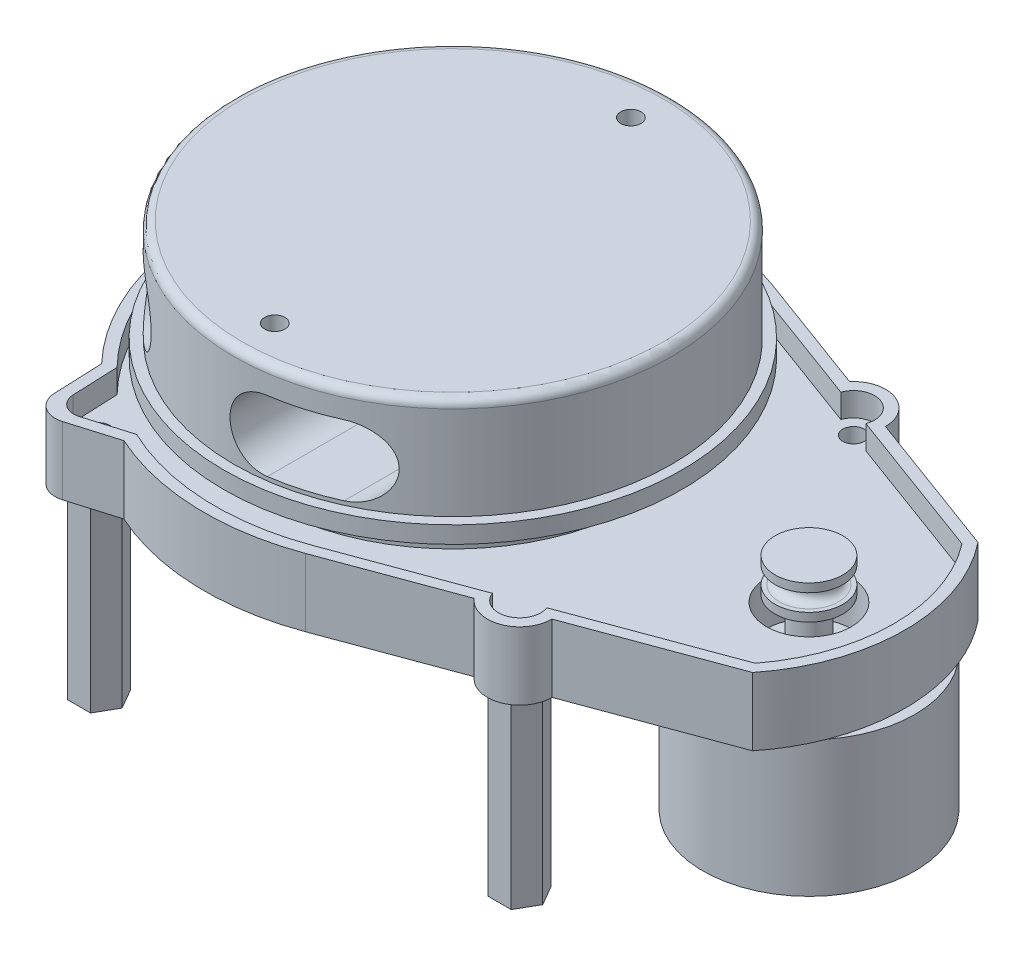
ISO-10303-21;
HEADER;
FILE_DESCRIPTION(('STEP AP214'),'2;1');
FILE_NAME('part.step','',(''),(''),'','','');
FILE_SCHEMA(('AUTOMOTIVE_DESIGN { 1 0 10303 214 1 1 1 1 }'));
ENDSEC;
DATA;
#1=APPLICATION_CONTEXT('core data for automotive mechanical design processes');
#2=APPLICATION_PROTOCOL_DEFINITION('international standard','automotive_design',2000,#1);
#3=PRODUCT_CONTEXT('',#1,'mechanical');
#4=PRODUCT('Part','Part','',(#3));
#5=PRODUCT_RELATED_PRODUCT_CATEGORY('part','',(#4));
#6=PRODUCT_DEFINITION_FORMATION('','',#4);
#7=PRODUCT_DEFINITION_CONTEXT('part definition',#1,'design');
#8=PRODUCT_DEFINITION('design','',#6,#7);
#9=PRODUCT_DEFINITION_SHAPE('','',#8);
#10=(LENGTH_UNIT() NAMED_UNIT(*) SI_UNIT(.MILLI.,.METRE.));
#11=(NAMED_UNIT(*) PLANE_ANGLE_UNIT() SI_UNIT($,.RADIAN.));
#12=(NAMED_UNIT(*) SI_UNIT($,.STERADIAN.) SOLID_ANGLE_UNIT());
#13=UNCERTAINTY_MEASURE_WITH_UNIT(LENGTH_MEASURE(1.E-05),#10,'distance_accuracy_value','');
#14=(GEOMETRIC_REPRESENTATION_CONTEXT(3) GLOBAL_UNCERTAINTY_ASSIGNED_CONTEXT((#13)) GLOBAL_UNIT_ASSIGNED_CONTEXT((#10,
#11,#12)) REPRESENTATION_CONTEXT('',''));
#15=CARTESIAN_POINT('',(0.,0.,0.));
#16=DIRECTION('',(0.,0.,1.));
#17=DIRECTION('',(1.,0.,0.));
#18=AXIS2_PLACEMENT_3D('',#15,#16,#17);
#19=CARTESIAN_POINT('',(0.,29.464,0.));
#20=DIRECTION('',(0.,-1.,0.));
#21=DIRECTION('',(0.,0.,-1.));
#22=AXIS2_PLACEMENT_3D('',#19,#20,#21);
#23=CYLINDRICAL_SURFACE('',#22,32.7914);
#24=CARTESIAN_POINT('',(0.,14.224,0.));
#25=DIRECTION('',(0.,1.,0.));
#26=DIRECTION('',(0.,0.,1.));
#27=AXIS2_PLACEMENT_3D('',#24,#25,#26);
#28=CIRCLE('',#27,32.7914);
#29=CARTESIAN_POINT('',(0.,14.224,32.7914));
#30=VERTEX_POINT('',#29);
#31=EDGE_CURVE('E535',#30,#30,#28,.T.);
#32=ORIENTED_EDGE('',*,*,#31,.T.);
#33=EDGE_LOOP('',(#32));
#34=FACE_BOUND('',#33,.T.);
#35=CARTESIAN_POINT('',(0.,28.194,0.));
#36=DIRECTION('',(0.,1.,0.));
#37=DIRECTION('',(0.,0.,1.));
#38=AXIS2_PLACEMENT_3D('',#35,#36,#37);
#39=CIRCLE('',#38,32.7914);
#40=CARTESIAN_POINT('',(0.,28.194,32.7914));
#41=VERTEX_POINT('',#40);
#42=EDGE_CURVE('E539',#41,#41,#39,.F.);
#43=ORIENTED_EDGE('',*,*,#42,.T.);
#44=EDGE_LOOP('',(#43));
#45=FACE_BOUND('',#44,.T.);
#46=CARTESIAN_POINT('',(-0.584199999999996,20.066,32.7861956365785));
#47=CARTESIAN_POINT('',(-0.584202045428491,19.9182567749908,32.7861950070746));
#48=CARTESIAN_POINT('',(-0.577970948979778,19.7705429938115,32.7863082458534));
#49=CARTESIAN_POINT('',(-0.553093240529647,19.4761192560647,32.786737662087));
#50=CARTESIAN_POINT('',(-0.534444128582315,19.3294095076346,32.7870538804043));
#51=CARTESIAN_POINT('',(-0.484841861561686,19.0379909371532,32.7878247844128));
#52=CARTESIAN_POINT('',(-0.453880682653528,18.8932834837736,32.7882795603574));
#53=CARTESIAN_POINT('',(-0.379861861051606,18.6069391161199,32.7892206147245));
#54=CARTESIAN_POINT('',(-0.3367998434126,18.4653033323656,32.7897069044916));
#55=CARTESIAN_POINT('',(-0.23892562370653,18.186266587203,32.7905660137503));
#56=CARTESIAN_POINT('',(-0.184121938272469,18.048862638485,32.7909389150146));
#57=CARTESIAN_POINT('',(-0.0631129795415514,17.7791087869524,32.7913950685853));
#58=CARTESIAN_POINT('',(0.00309649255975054,17.6467607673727,32.7914782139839));
#59=CARTESIAN_POINT('',(0.146392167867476,17.3881862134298,32.7911514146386));
#60=CARTESIAN_POINT('',(0.22347234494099,17.2619563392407,32.7907417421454));
#61=CARTESIAN_POINT('',(0.388017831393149,17.0163937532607,32.789207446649));
#62=CARTESIAN_POINT('',(0.475486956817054,16.8970635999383,32.7880825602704));
#63=CARTESIAN_POINT('',(0.66007414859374,16.6663117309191,32.7848856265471));
#64=CARTESIAN_POINT('',(0.757183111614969,16.5548827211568,32.7828144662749));
#65=CARTESIAN_POINT('',(0.960456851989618,16.3405672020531,32.7774888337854));
#66=CARTESIAN_POINT('',(1.06662496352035,16.2376838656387,32.7742339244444));
#67=CARTESIAN_POINT('',(1.28717375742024,16.0412796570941,32.7663129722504));
#68=CARTESIAN_POINT('',(1.40155131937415,15.947755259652,32.7616474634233));
#69=CARTESIAN_POINT('',(1.63776195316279,15.7706599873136,32.7506890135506));
#70=CARTESIAN_POINT('',(1.75959774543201,15.6870927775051,32.744395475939));
#71=CARTESIAN_POINT('',(2.00917219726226,15.5309315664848,32.7300272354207));
#72=CARTESIAN_POINT('',(2.13687876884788,15.4582854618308,32.7219614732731));
#73=CARTESIAN_POINT('',(2.39785630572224,15.3239538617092,32.703873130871));
#74=CARTESIAN_POINT('',(2.53112929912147,15.2622724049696,32.6938498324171));
#75=CARTESIAN_POINT('',(2.80217231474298,15.1503416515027,32.6717340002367));
#76=CARTESIAN_POINT('',(2.93994046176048,15.1000876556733,32.6596423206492));
#77=CARTESIAN_POINT('',(3.21901571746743,15.0112863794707,32.6333198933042));
#78=CARTESIAN_POINT('',(3.36032411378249,14.9727434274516,32.6190883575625));
#79=CARTESIAN_POINT('',(3.78714101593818,14.8752927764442,32.573221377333));
#80=CARTESIAN_POINT('',(4.07657783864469,14.8341373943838,32.5383309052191));
#81=CARTESIAN_POINT('',(4.65700316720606,14.8001811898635,32.4603476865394));
#82=CARTESIAN_POINT('',(4.94799175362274,14.8073829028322,32.4172545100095));
#83=CARTESIAN_POINT('',(5.52698155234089,14.869667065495,32.3236027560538));
#84=CARTESIAN_POINT('',(5.81491265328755,14.9252856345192,32.2729658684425));
#85=CARTESIAN_POINT('',(6.37672412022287,15.0831269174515,32.1666775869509));
#86=CARTESIAN_POINT('',(6.65060242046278,15.1853564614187,32.1110254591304));
#87=CARTESIAN_POINT('',(7.18342026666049,15.4363170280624,31.9960998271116));
#88=CARTESIAN_POINT('',(7.44186749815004,15.5860693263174,31.9367723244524));
#89=CARTESIAN_POINT('',(7.92992855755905,15.9272251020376,31.8191022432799));
#90=CARTESIAN_POINT('',(8.15953874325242,16.118633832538,31.7607597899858));
#91=CARTESIAN_POINT('',(8.58602451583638,16.5406106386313,31.6481494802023));
#92=CARTESIAN_POINT('',(8.78250510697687,16.7715928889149,31.5939345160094));
#93=CARTESIAN_POINT('',(9.13357738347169,17.2651551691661,31.4942390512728));
#94=CARTESIAN_POINT('',(9.28817476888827,17.5277308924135,31.4487573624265));
#95=CARTESIAN_POINT('',(9.54719253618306,18.0707743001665,31.3710850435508));
#96=CARTESIAN_POINT('',(9.65269818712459,18.3506825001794,31.3386094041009));
#97=CARTESIAN_POINT('',(9.81489436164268,18.9255342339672,31.288193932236));
#98=CARTESIAN_POINT('',(9.87160032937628,19.2204729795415,31.2702495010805));
#99=CARTESIAN_POINT('',(9.93268181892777,19.8036311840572,31.2508994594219));
#100=CARTESIAN_POINT('',(9.93916353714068,20.0916094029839,31.2488282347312));
#101=CARTESIAN_POINT('',(9.90510168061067,20.6644620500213,31.2596415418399));
#102=CARTESIAN_POINT('',(9.86456303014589,20.9493367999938,31.2725245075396));
#103=CARTESIAN_POINT('',(9.7390062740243,21.5031701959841,31.3118483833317));
#104=CARTESIAN_POINT('',(9.65472339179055,21.7723125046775,31.3380650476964));
#105=CARTESIAN_POINT('',(9.44493574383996,22.2925470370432,31.4019275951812));
#106=CARTESIAN_POINT('',(9.3194259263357,22.5436370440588,31.4395748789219));
#107=CARTESIAN_POINT('',(9.02709639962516,23.0280409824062,31.5247704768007));
#108=CARTESIAN_POINT('',(8.85926093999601,23.2606992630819,31.5725568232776));
#109=CARTESIAN_POINT('',(8.48887300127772,23.6950020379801,31.6741498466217));
#110=CARTESIAN_POINT('',(8.28631288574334,23.8966396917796,31.7279578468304));
#111=CARTESIAN_POINT('',(7.84276068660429,24.2717879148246,31.8405620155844));
#112=CARTESIAN_POINT('',(7.60053256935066,24.4438046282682,31.8994722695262));
#113=CARTESIAN_POINT('',(7.09049710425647,24.7447580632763,32.0167017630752));
#114=CARTESIAN_POINT('',(6.82268673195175,24.8736896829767,32.0750209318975));
#115=CARTESIAN_POINT('',(6.26378862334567,25.08662076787,32.1888712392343));
#116=CARTESIAN_POINT('',(5.97238536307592,25.1698288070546,32.2443390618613));
#117=CARTESIAN_POINT('',(5.37852968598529,25.2851053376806,32.3486975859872));
#118=CARTESIAN_POINT('',(5.07607825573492,25.3171783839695,32.3975888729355));
#119=CARTESIAN_POINT('',(4.47337094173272,25.3284777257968,32.4862435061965));
#120=CARTESIAN_POINT('',(4.17315174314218,25.3085012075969,32.5261344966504));
#121=CARTESIAN_POINT('',(3.7281913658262,25.2402929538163,32.5791203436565));
#122=CARTESIAN_POINT('',(3.58069314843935,25.2111586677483,32.5956471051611));
#123=CARTESIAN_POINT('',(3.28852521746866,25.1403056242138,32.6264158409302));
#124=CARTESIAN_POINT('',(3.14385440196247,25.0985918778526,32.6406587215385));
#125=CARTESIAN_POINT('',(2.86157711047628,25.0038863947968,32.6666031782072));
#126=CARTESIAN_POINT('',(2.723885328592,24.9511613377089,32.6783535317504));
#127=CARTESIAN_POINT('',(2.45333091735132,24.8342877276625,32.6997780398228));
#128=CARTESIAN_POINT('',(2.32046642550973,24.770143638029,32.709453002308));
#129=CARTESIAN_POINT('',(2.06046090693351,24.6308357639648,32.7268605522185));
#130=CARTESIAN_POINT('',(1.93332166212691,24.5556685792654,32.7345925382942));
#131=CARTESIAN_POINT('',(1.68579603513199,24.3948866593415,32.7482727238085));
#132=CARTESIAN_POINT('',(1.56540717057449,24.3092758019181,32.7542215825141));
#133=CARTESIAN_POINT('',(1.33307283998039,24.1288577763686,32.7644968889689));
#134=CARTESIAN_POINT('',(1.22107194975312,24.0341226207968,32.7688349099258));
#135=CARTESIAN_POINT('',(1.00539243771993,23.8356398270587,32.7761611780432));
#136=CARTESIAN_POINT('',(0.901710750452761,23.7318955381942,32.7791499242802));
#137=CARTESIAN_POINT('',(0.703306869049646,23.5160341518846,32.7840072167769));
#138=CARTESIAN_POINT('',(0.608589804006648,23.4039123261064,32.7858751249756));
#139=CARTESIAN_POINT('',(0.428885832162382,23.1721798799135,32.7887182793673));
#140=CARTESIAN_POINT('',(0.343895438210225,23.0525719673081,32.7896938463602));
#141=CARTESIAN_POINT('',(0.183810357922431,22.8060645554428,32.7909830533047));
#142=CARTESIAN_POINT('',(0.108766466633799,22.6791320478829,32.7912934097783));
#143=CARTESIAN_POINT('',(-0.0303736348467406,22.4194620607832,32.7914597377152));
#144=CARTESIAN_POINT('',(-0.0944737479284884,22.2867266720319,32.7913158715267));
#145=CARTESIAN_POINT('',(-0.211270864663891,22.0164246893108,32.7907714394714));
#146=CARTESIAN_POINT('',(-0.263974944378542,21.8788611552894,32.7903710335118));
#147=CARTESIAN_POINT('',(-0.357646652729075,21.5998445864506,32.7894829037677));
#148=CARTESIAN_POINT('',(-0.398616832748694,21.4583924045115,32.7889951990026));
#149=CARTESIAN_POINT('',(-0.483537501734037,21.1112518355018,32.7878735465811));
#150=CARTESIAN_POINT('',(-0.521245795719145,20.9040046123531,32.7872664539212));
#151=CARTESIAN_POINT('',(-0.571575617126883,20.4864850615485,32.7864279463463));
#152=CARTESIAN_POINT('',(-0.584197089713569,20.2762127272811,32.7861965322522));
#153=CARTESIAN_POINT('',(-0.584199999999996,20.066,32.7861956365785));
#154=B_SPLINE_CURVE_WITH_KNOTS('',3,(#46,#47,#48,#49,#50,#51,#52,#53,#54,#55,#56,#57,#58,#59,
#60,#61,#62,#63,#64,#65,#66,#67,#68,#69,#70,#71,#72,#73,#74,#75,#76,#77,#78,#79,#80,#81,#82,#83,
#84,#85,#86,#87,#88,#89,#90,#91,#92,#93,#94,#95,#96,#97,#98,#99,#100,#101,#102,#103,#104,#105,
#106,#107,#108,#109,#110,#111,#112,#113,#114,#115,#116,#117,#118,#119,#120,#121,#122,#123,#124,
#125,#126,#127,#128,#129,#130,#131,#132,#133,#134,#135,#136,#137,#138,#139,#140,#141,#142,#143,
#144,#145,#146,#147,#148,#149,#150,#151,#152,#153),.UNSPECIFIED.,.T.,.F.,(4,2,2,2,2,2,2,2,2,2,2,
2,2,2,2,2,2,2,2,2,2,2,2,2,2,2,2,2,2,2,2,2,2,2,2,2,2,2,2,2,2,2,2,2,2,2,2,2,2,2,2,2,2,4),(0.,
0.443047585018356,0.886184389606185,1.32961046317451,1.77319706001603,2.21646299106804,
2.65989245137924,3.10307705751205,3.54642495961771,3.98935810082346,4.43245497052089,
4.87538430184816,5.31847616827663,5.75938199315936,6.20044988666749,6.64133607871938,
7.08238502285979,7.96115424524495,8.83996954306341,9.72864154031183,10.6174437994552,
11.5268123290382,12.4362955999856,13.3559546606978,14.2754884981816,15.1735956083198,
16.0714183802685,16.9313750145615,17.7912415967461,18.6371029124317,19.4830679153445,
20.3516752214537,21.220473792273,22.1249260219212,23.0294853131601,23.9492444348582,
24.8689216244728,25.7745962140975,26.227889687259,26.6810028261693,27.1242036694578,
27.5672316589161,28.0103965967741,28.4533974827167,28.8931510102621,29.3327417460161,
29.7725824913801,30.212265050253,30.6541129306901,31.0958029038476,31.5372178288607,
31.9785367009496,32.6089144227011,33.2392935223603),.UNSPECIFIED.);
#155=CARTESIAN_POINT('',(4.6736,25.3238,32.4566384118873));
#156=VERTEX_POINT('',#155);
#157=CARTESIAN_POINT('',(4.6736,14.8082,32.4566384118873));
#158=VERTEX_POINT('',#157);
#159=EDGE_CURVE('E575',#156,#158,#154,.T.);
#160=ORIENTED_EDGE('',*,*,#159,.F.);
#161=CARTESIAN_POINT('',(0.,25.3238,0.));
#162=DIRECTION('',(0.,-1.,0.));
#163=DIRECTION('',(0.,0.,-1.));
#164=AXIS2_PLACEMENT_3D('',#161,#162,#163);
#165=CIRCLE('',#164,32.7914);
#166=CARTESIAN_POINT('',(13.5636,25.3238,29.8547260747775));
#167=VERTEX_POINT('',#166);
#168=EDGE_CURVE('E542',#167,#156,#165,.T.);
#169=ORIENTED_EDGE('',*,*,#168,.F.);
#170=CARTESIAN_POINT('',(8.3058,20.066,31.7220680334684));
#171=CARTESIAN_POINT('',(8.30581032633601,19.7789328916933,31.7220670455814));
#172=CARTESIAN_POINT('',(8.32938769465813,19.4917867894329,31.7159205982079));
#173=CARTESIAN_POINT('',(8.42293381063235,18.925646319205,31.6912034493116));
#174=CARTESIAN_POINT('',(8.49291897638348,18.6466548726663,31.6726283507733));
#175=CARTESIAN_POINT('',(8.67684539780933,18.1049133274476,31.6227336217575));
#176=CARTESIAN_POINT('',(8.79076629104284,17.8421557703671,31.5914198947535));
#177=CARTESIAN_POINT('',(9.0586473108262,17.3400439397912,31.5156485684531));
#178=CARTESIAN_POINT('',(9.21260424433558,17.1006878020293,31.4711920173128));
#179=CARTESIAN_POINT('',(9.55658364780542,16.6499736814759,31.3684550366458));
#180=CARTESIAN_POINT('',(9.74686418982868,16.4388356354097,31.3100748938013));
#181=CARTESIAN_POINT('',(10.1562970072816,16.0517569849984,31.1796669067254));
#182=CARTESIAN_POINT('',(10.3754517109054,15.8758193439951,31.1076379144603));
#183=CARTESIAN_POINT('',(10.842110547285,15.5582448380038,30.9481333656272));
#184=CARTESIAN_POINT('',(11.0902435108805,15.4177253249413,30.8602768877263));
#185=CARTESIAN_POINT('',(11.6017375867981,15.1797753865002,30.6716469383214));
#186=CARTESIAN_POINT('',(11.8651021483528,15.0823547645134,30.5708705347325));
#187=CARTESIAN_POINT('',(12.4147320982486,14.9268690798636,30.3519786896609));
#188=CARTESIAN_POINT('',(12.7014505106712,14.8713396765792,30.2332051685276));
#189=CARTESIAN_POINT('',(13.2757214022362,14.808135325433,29.9854812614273));
#190=CARTESIAN_POINT('',(13.5632741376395,14.8004770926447,29.8565273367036));
#191=CARTESIAN_POINT('',(14.1554761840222,14.8325497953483,29.5806256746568));
#192=CARTESIAN_POINT('',(14.459631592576,14.8761564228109,29.4330657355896));
#193=CARTESIAN_POINT('',(15.0538234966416,15.0145726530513,29.1336451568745));
#194=CARTESIAN_POINT('',(15.3438539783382,15.1094038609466,28.9817827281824));
#195=CARTESIAN_POINT('',(15.9234718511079,15.3562810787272,28.6676618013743));
#196=CARTESIAN_POINT('',(16.2115773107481,15.5118991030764,28.5054276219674));
#197=CARTESIAN_POINT('',(16.6203010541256,15.7848803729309,28.2677670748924));
#198=CARTESIAN_POINT('',(16.7527323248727,15.8825597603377,28.1894354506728));
#199=CARTESIAN_POINT('',(17.0088927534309,16.0908712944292,28.0356152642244));
#200=CARTESIAN_POINT('',(17.1326208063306,16.2015050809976,27.9601270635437));
#201=CARTESIAN_POINT('',(17.3693857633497,16.4344911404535,27.8136588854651));
#202=CARTESIAN_POINT('',(17.4824914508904,16.5567559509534,27.7426510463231));
#203=CARTESIAN_POINT('',(17.6977655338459,16.8131351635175,27.6058193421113));
#204=CARTESIAN_POINT('',(17.7999400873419,16.9472428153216,27.5399925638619));
#205=CARTESIAN_POINT('',(17.9919776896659,17.2265268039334,27.4149187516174));
#206=CARTESIAN_POINT('',(18.0818601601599,17.3716851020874,27.3556613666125));
#207=CARTESIAN_POINT('',(18.2480927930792,17.6723701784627,27.2450545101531));
#208=CARTESIAN_POINT('',(18.3244491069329,17.8278921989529,27.1937014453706));
#209=CARTESIAN_POINT('',(18.4421464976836,18.1014348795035,27.1139562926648));
#210=CARTESIAN_POINT('',(18.4872096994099,18.2171909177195,27.0832322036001));
#211=CARTESIAN_POINT('',(18.5693328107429,18.4527286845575,27.026991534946));
#212=CARTESIAN_POINT('',(18.6063944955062,18.572509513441,27.0014738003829));
#213=CARTESIAN_POINT('',(18.6720362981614,18.8153409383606,26.9561230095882));
#214=CARTESIAN_POINT('',(18.7006221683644,18.9383892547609,26.9362860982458));
#215=CARTESIAN_POINT('',(18.7489564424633,19.187035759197,26.9026655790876));
#216=CARTESIAN_POINT('',(18.7687045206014,19.3126340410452,26.888882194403));
#217=CARTESIAN_POINT('',(18.7991205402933,19.5658940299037,26.8676260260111));
#218=CARTESIAN_POINT('',(18.8097574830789,19.6935612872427,26.8601747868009));
#219=CARTESIAN_POINT('',(18.8216714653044,19.9495444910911,26.8518277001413));
#220=CARTESIAN_POINT('',(18.8229487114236,20.077860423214,26.85093170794));
#221=CARTESIAN_POINT('',(18.8161231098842,20.3341291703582,26.8557152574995));
#222=CARTESIAN_POINT('',(18.8080194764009,20.4620819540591,26.8613953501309));
#223=CARTESIAN_POINT('',(18.7825591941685,20.7166033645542,26.8792043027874));
#224=CARTESIAN_POINT('',(18.7652027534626,20.8431720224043,26.8913330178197));
#225=CARTESIAN_POINT('',(18.7226209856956,21.0875392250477,26.9209957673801));
#226=CARTESIAN_POINT('',(18.6978458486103,21.2054542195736,26.9382200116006));
#227=CARTESIAN_POINT('',(18.6405235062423,21.4384900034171,26.9779169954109));
#228=CARTESIAN_POINT('',(18.6079738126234,21.5536098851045,27.000391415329));
#229=CARTESIAN_POINT('',(18.4992224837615,21.8937429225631,27.0751263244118));
#230=CARTESIAN_POINT('',(18.411886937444,22.1137072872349,27.1347208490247));
#231=CARTESIAN_POINT('',(18.20330931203,22.5521777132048,27.2751232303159));
#232=CARTESIAN_POINT('',(18.0799676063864,22.769255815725,27.3572150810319));
#233=CARTESIAN_POINT('',(17.8072461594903,23.1799602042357,27.5355125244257));
#234=CARTESIAN_POINT('',(17.6578533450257,23.3735746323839,27.6317251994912));
#235=CARTESIAN_POINT('',(17.31104748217,23.7646432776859,27.8505290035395));
#236=CARTESIAN_POINT('',(17.1097755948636,23.9576923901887,27.9748727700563));
#237=CARTESIAN_POINT('',(16.6825929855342,24.30777988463,28.2317058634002));
#238=CARTESIAN_POINT('',(16.4566665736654,24.4647951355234,28.3642003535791));
#239=CARTESIAN_POINT('',(15.9500209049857,24.7615149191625,28.652567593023));
#240=CARTESIAN_POINT('',(15.6661313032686,24.8952700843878,28.8090109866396));
#241=CARTESIAN_POINT('',(15.0783759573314,25.1105808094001,29.1209374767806));
#242=CARTESIAN_POINT('',(14.7745017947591,25.1921142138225,29.2764201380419));
#243=CARTESIAN_POINT('',(14.3013671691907,25.2744212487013,29.5089841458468));
#244=CARTESIAN_POINT('',(14.1364707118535,25.295154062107,29.5883404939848));
#245=CARTESIAN_POINT('',(13.8043855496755,25.3209199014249,29.7447211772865));
#246=CARTESIAN_POINT('',(13.6371977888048,25.325959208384,29.8217464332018));
#247=CARTESIAN_POINT('',(13.3017408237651,25.3199554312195,29.9728790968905));
#248=CARTESIAN_POINT('',(13.1334713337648,25.308907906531,30.0469856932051));
#249=CARTESIAN_POINT('',(12.7973726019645,25.2704159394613,30.1916645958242));
#250=CARTESIAN_POINT('',(12.6295431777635,25.2429799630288,30.262238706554));
#251=CARTESIAN_POINT('',(12.3040588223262,25.173281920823,30.3959777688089));
#252=CARTESIAN_POINT('',(12.1463118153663,25.1318218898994,30.4593365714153));
#253=CARTESIAN_POINT('',(11.8340237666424,25.0338757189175,30.5820195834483));
#254=CARTESIAN_POINT('',(11.6794812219,24.9773968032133,30.6413457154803));
#255=CARTESIAN_POINT('',(11.3750695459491,24.8495179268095,30.7556521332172));
#256=CARTESIAN_POINT('',(11.2251993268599,24.7781214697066,30.8106334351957));
#257=CARTESIAN_POINT('',(10.9316647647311,24.6206797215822,30.9159980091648));
#258=CARTESIAN_POINT('',(10.7879998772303,24.5346357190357,30.9663816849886));
#259=CARTESIAN_POINT('',(10.5206345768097,24.3564938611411,31.0581772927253));
#260=CARTESIAN_POINT('',(10.3962847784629,24.2655744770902,31.0999884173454));
#261=CARTESIAN_POINT('',(10.1552796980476,24.0724514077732,31.1795174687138));
#262=CARTESIAN_POINT('',(10.0386238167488,23.970248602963,31.2172357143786));
#263=CARTESIAN_POINT('',(9.81418949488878,23.7552447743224,31.2885196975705));
#264=CARTESIAN_POINT('',(9.70640919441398,23.6424459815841,31.3220863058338));
#265=CARTESIAN_POINT('',(9.50080317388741,23.4070419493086,31.3850635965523));
#266=CARTESIAN_POINT('',(9.40297698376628,23.2844371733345,31.4144744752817));
#267=CARTESIAN_POINT('',(9.22422707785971,23.0385250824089,31.4674065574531));
#268=CARTESIAN_POINT('',(9.1426214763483,22.9157680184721,31.4911846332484));
#269=CARTESIAN_POINT('',(8.98976866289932,22.6633632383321,31.5351597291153));
#270=CARTESIAN_POINT('',(8.91852089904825,22.5337158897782,31.5553569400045));
#271=CARTESIAN_POINT('',(8.78707242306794,22.2685272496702,31.5922132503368));
#272=CARTESIAN_POINT('',(8.72686621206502,22.1329889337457,31.608874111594));
#273=CARTESIAN_POINT('',(8.61802350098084,21.857022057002,31.638722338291));
#274=CARTESIAN_POINT('',(8.56938588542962,21.7165939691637,31.6519100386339));
#275=CARTESIAN_POINT('',(8.45380147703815,21.3305110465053,31.6830396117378));
#276=CARTESIAN_POINT('',(8.39841269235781,21.0810079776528,31.6976982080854));
#277=CARTESIAN_POINT('',(8.32440821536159,20.5763572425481,31.717212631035));
#278=CARTESIAN_POINT('',(8.30579081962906,20.3212098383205,31.7220689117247));
#279=CARTESIAN_POINT('',(8.3058,20.066,31.7220680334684));
#280=B_SPLINE_CURVE_WITH_KNOTS('',3,(#170,#171,#172,#173,#174,#175,#176,#177,#178,#179,#180,
#181,#182,#183,#184,#185,#186,#187,#188,#189,#190,#191,#192,#193,#194,#195,#196,#197,#198,#199,
#200,#201,#202,#203,#204,#205,#206,#207,#208,#209,#210,#211,#212,#213,#214,#215,#216,#217,#218,
#219,#220,#221,#222,#223,#224,#225,#226,#227,#228,#229,#230,#231,#232,#233,#234,#235,#236,#237,
#238,#239,#240,#241,#242,#243,#244,#245,#246,#247,#248,#249,#250,#251,#252,#253,#254,#255,#256,
#257,#258,#259,#260,#261,#262,#263,#264,#265,#266,#267,#268,#269,#270,#271,#272,#273,#274,#275,
#276,#277,#278,#279),.UNSPECIFIED.,.T.,.F.,(4,2,2,2,2,2,2,2,2,2,2,2,2,2,2,2,2,2,2,2,2,2,2,2,2,2,
2,2,2,2,2,2,2,2,2,2,2,2,2,2,2,2,2,2,2,2,2,2,2,2,2,2,2,2,4),(0.,0.860314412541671,
1.72093334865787,2.58115390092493,3.44130586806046,4.30781322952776,5.17439350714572,
6.06561020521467,6.95702951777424,7.89883312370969,8.84096555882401,9.85915737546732,
10.8777789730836,11.968438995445,12.5146365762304,13.0609033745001,13.6033458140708,
14.1454810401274,14.6867495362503,15.2277712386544,15.6112764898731,15.9946965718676,
16.3778558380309,16.7610292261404,17.1455011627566,17.5299646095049,17.914460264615,
18.2989472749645,18.6636766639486,19.0285229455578,19.7576756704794,20.5432100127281,
21.3291396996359,22.2416662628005,23.1547769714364,24.2022839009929,25.2502349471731,
25.8021569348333,26.3538579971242,26.9057113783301,27.4572799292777,27.9815169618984,
28.5055022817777,29.0293646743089,29.5531810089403,30.0314123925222,30.5096064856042,
30.9877001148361,31.4657711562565,31.9131554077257,32.3605158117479,32.8076528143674,
33.2547466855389,34.0196231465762,34.7844641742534),.UNSPECIFIED.);
#281=CARTESIAN_POINT('',(13.5636,14.8082,29.8547260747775));
#282=VERTEX_POINT('',#281);
#283=EDGE_CURVE('E544',#282,#167,#280,.T.);
#284=ORIENTED_EDGE('',*,*,#283,.F.);
#285=CARTESIAN_POINT('',(0.,14.8082,0.));
#286=DIRECTION('',(0.,1.,0.));
#287=DIRECTION('',(-1.,0.,0.));
#288=AXIS2_PLACEMENT_3D('',#285,#286,#287);
#289=CIRCLE('',#288,32.7914);
#290=EDGE_CURVE('E551',#158,#282,#289,.T.);
#291=ORIENTED_EDGE('',*,*,#290,.F.);
#292=EDGE_LOOP('',(#160,#169,#284,#291));
#293=FACE_BOUND('',#292,.T.);
#294=CARTESIAN_POINT('',(-27.8892,20.066,17.2472733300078));
#295=CARTESIAN_POINT('',(-27.8892025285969,19.9820125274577,17.2472687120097));
#296=CARTESIAN_POINT('',(-27.8871831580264,19.8980497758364,17.2505359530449));
#297=CARTESIAN_POINT('',(-27.879172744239,19.7308033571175,17.2634786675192));
#298=CARTESIAN_POINT('',(-27.8731810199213,19.6475198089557,17.2731552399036));
#299=CARTESIAN_POINT('',(-27.8494251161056,19.399528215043,17.3114526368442));
#300=CARTESIAN_POINT('',(-27.8258803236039,19.2367260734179,17.3493409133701));
#301=CARTESIAN_POINT('',(-27.7576120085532,18.8796068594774,17.4584054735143));
#302=CARTESIAN_POINT('',(-27.7090005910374,18.6879437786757,17.5356344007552));
#303=CARTESIAN_POINT('',(-27.5951157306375,18.3215875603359,17.7143070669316));
#304=CARTESIAN_POINT('',(-27.5298070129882,18.14693144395,17.8158020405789));
#305=CARTESIAN_POINT('',(-27.4010287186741,17.8488485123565,18.0130639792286));
#306=CARTESIAN_POINT('',(-27.3399360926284,17.7222672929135,18.1057263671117));
#307=CARTESIAN_POINT('',(-27.2108591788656,17.4791153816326,18.2991413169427));
#308=CARTESIAN_POINT('',(-27.1428707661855,17.362550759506,18.3998987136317));
#309=CARTESIAN_POINT('',(-27.0008907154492,17.1386085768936,18.6076241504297));
#310=CARTESIAN_POINT('',(-26.9268886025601,17.0312477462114,18.7146029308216));
#311=CARTESIAN_POINT('',(-26.7736727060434,16.8252421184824,18.9331509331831));
#312=CARTESIAN_POINT('',(-26.6944572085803,16.7266002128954,19.0447216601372));
#313=CARTESIAN_POINT('',(-26.47954798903,16.4774128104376,19.3432530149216));
#314=CARTESIAN_POINT('',(-26.3399306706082,16.3336807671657,19.5331005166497));
#315=CARTESIAN_POINT('',(-26.0497333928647,16.0662010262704,19.9184742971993));
#316=CARTESIAN_POINT('',(-25.8991469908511,15.942465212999,20.1140038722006));
#317=CARTESIAN_POINT('',(-25.5879322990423,15.713911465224,20.5084569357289));
#318=CARTESIAN_POINT('',(-25.4272941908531,15.6091124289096,20.7073836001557));
#319=CARTESIAN_POINT('',(-25.0969370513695,15.4182082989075,21.1065580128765));
#320=CARTESIAN_POINT('',(-24.9272198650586,15.3320994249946,21.306805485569));
#321=CARTESIAN_POINT('',(-24.5729475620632,15.1758364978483,21.7145517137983));
#322=CARTESIAN_POINT('',(-24.3880762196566,15.1063864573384,21.9220460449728));
#323=CARTESIAN_POINT('',(-24.010029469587,14.9882980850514,22.3354620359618));
#324=CARTESIAN_POINT('',(-23.8168528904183,14.9396626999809,22.5413834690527));
#325=CARTESIAN_POINT('',(-23.4234031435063,14.8643408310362,22.9499548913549));
#326=CARTESIAN_POINT('',(-23.2231394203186,14.8376262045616,23.1526087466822));
#327=CARTESIAN_POINT('',(-22.8165018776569,14.8075076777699,23.5534410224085));
#328=CARTESIAN_POINT('',(-22.6101299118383,14.8040967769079,23.7516207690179));
#329=CARTESIAN_POINT('',(-22.2408770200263,14.8202592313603,24.0970482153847));
#330=CARTESIAN_POINT('',(-22.0789130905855,14.8347254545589,24.245524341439));
#331=CARTESIAN_POINT('',(-21.7532620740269,14.8794457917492,24.5381212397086));
#332=CARTESIAN_POINT('',(-21.5895753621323,14.9096965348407,24.6822429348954));
#333=CARTESIAN_POINT('',(-21.2617483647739,14.9869419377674,24.965191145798));
#334=CARTESIAN_POINT('',(-21.0976085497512,15.033923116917,25.1040218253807));
#335=CARTESIAN_POINT('',(-20.7703272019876,15.1455525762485,25.375475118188));
#336=CARTESIAN_POINT('',(-20.6071854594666,15.210197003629,25.5080990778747));
#337=CARTESIAN_POINT('',(-20.1879718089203,15.4018826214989,25.8423945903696));
#338=CARTESIAN_POINT('',(-19.9337995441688,15.5432436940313,26.0386915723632));
#339=CARTESIAN_POINT('',(-19.5650030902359,15.7923899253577,26.3155944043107));
#340=CARTESIAN_POINT('',(-19.4441418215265,15.8816285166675,26.4049758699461));
#341=CARTESIAN_POINT('',(-19.2078948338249,16.0726180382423,26.5773204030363));
#342=CARTESIAN_POINT('',(-19.0925058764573,16.1743614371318,26.6602872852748));
#343=CARTESIAN_POINT('',(-18.8866466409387,16.372987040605,26.806413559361));
#344=CARTESIAN_POINT('',(-18.7951452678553,16.468037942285,26.8706171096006));
#345=CARTESIAN_POINT('',(-18.6180629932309,16.6666945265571,26.993615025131));
#346=CARTESIAN_POINT('',(-18.5324793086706,16.7702961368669,27.0524119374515));
#347=CARTESIAN_POINT('',(-18.3681668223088,16.9857940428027,27.1642457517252));
#348=CARTESIAN_POINT('',(-18.2894402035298,17.0976929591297,27.2172808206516));
#349=CARTESIAN_POINT('',(-18.1399132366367,17.3292158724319,27.3171657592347));
#350=CARTESIAN_POINT('',(-18.0691095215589,17.4488365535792,27.3640182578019));
#351=CARTESIAN_POINT('',(-17.9359571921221,17.695957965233,27.4514797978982));
#352=CARTESIAN_POINT('',(-17.8736646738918,17.8235036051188,27.4920476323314));
#353=CARTESIAN_POINT('',(-17.7590355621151,18.0848697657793,27.5662335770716));
#354=CARTESIAN_POINT('',(-17.7066943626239,18.2186873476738,27.5998549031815));
#355=CARTESIAN_POINT('',(-17.612777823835,18.4916061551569,27.6598821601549));
#356=CARTESIAN_POINT('',(-17.5712013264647,18.6307068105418,27.6862888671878));
#357=CARTESIAN_POINT('',(-17.4995112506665,18.9130124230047,27.731657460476));
#358=CARTESIAN_POINT('',(-17.4693963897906,19.0562169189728,27.75062017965));
#359=CARTESIAN_POINT('',(-17.423689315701,19.3301870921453,27.7793378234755));
#360=CARTESIAN_POINT('',(-17.4069021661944,19.4606755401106,27.7898518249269));
#361=CARTESIAN_POINT('',(-17.3831563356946,19.7228894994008,27.804711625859));
#362=CARTESIAN_POINT('',(-17.3761969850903,19.8546149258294,27.8090578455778));
#363=CARTESIAN_POINT('',(-17.3722074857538,20.1182310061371,27.8115502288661));
#364=CARTESIAN_POINT('',(-17.3751741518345,20.2501215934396,27.8096983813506));
#365=CARTESIAN_POINT('',(-17.3909866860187,20.5130754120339,27.7998126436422));
#366=CARTESIAN_POINT('',(-17.40383242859,20.6441386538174,27.7917788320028));
#367=CARTESIAN_POINT('',(-17.438388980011,20.8983302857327,27.7701079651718));
#368=CARTESIAN_POINT('',(-17.4596571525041,21.0215431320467,27.7567504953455));
#369=CARTESIAN_POINT('',(-17.5107356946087,21.2654970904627,27.7245551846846));
#370=CARTESIAN_POINT('',(-17.540548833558,21.3862373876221,27.7057155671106));
#371=CARTESIAN_POINT('',(-17.608328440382,21.6243752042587,27.6626877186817));
#372=CARTESIAN_POINT('',(-17.6462917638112,21.7417739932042,27.6385015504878));
#373=CARTESIAN_POINT('',(-17.7299332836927,21.9726105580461,27.5849206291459));
#374=CARTESIAN_POINT('',(-17.7756143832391,22.0860468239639,27.5555239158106));
#375=CARTESIAN_POINT('',(-17.8755534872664,22.3114405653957,27.4908010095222));
#376=CARTESIAN_POINT('',(-17.9300176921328,22.4232652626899,27.4553305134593));
#377=CARTESIAN_POINT('',(-18.0459070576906,22.6414613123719,27.3792980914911));
#378=CARTESIAN_POINT('',(-18.1073347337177,22.7478306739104,27.3387343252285));
#379=CARTESIAN_POINT('',(-18.3010466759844,23.0579545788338,27.2097704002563));
#380=CARTESIAN_POINT('',(-18.4428314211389,23.2528837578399,27.1140517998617));
#381=CARTESIAN_POINT('',(-18.7604504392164,23.6335622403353,26.8953897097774));
#382=CARTESIAN_POINT('',(-18.9382432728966,23.8166574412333,26.7707192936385));
#383=CARTESIAN_POINT('',(-19.3105024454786,24.1499380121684,26.5034499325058));
#384=CARTESIAN_POINT('',(-19.504978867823,24.3001032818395,26.3608401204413));
#385=CARTESIAN_POINT('',(-19.8461011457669,24.5286931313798,26.1043991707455));
#386=CARTESIAN_POINT('',(-19.9901872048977,24.6152757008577,25.9942781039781));
#387=CARTESIAN_POINT('',(-20.2818346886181,24.7725320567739,25.7673670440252));
#388=CARTESIAN_POINT('',(-20.4293971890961,24.8432008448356,25.6505749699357));
#389=CARTESIAN_POINT('',(-20.7265579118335,24.9692778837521,25.4110644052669));
#390=CARTESIAN_POINT('',(-20.8761587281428,25.024664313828,25.2883377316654));
#391=CARTESIAN_POINT('',(-21.1758984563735,25.120775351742,25.0378795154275));
#392=CARTESIAN_POINT('',(-21.3260374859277,25.1614965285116,24.9101468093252));
#393=CARTESIAN_POINT('',(-21.6700996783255,25.2390063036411,24.61196198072));
#394=CARTESIAN_POINT('',(-21.8638328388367,25.2710658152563,24.4400530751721));
#395=CARTESIAN_POINT('',(-22.2484520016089,25.3134055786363,24.0904526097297));
#396=CARTESIAN_POINT('',(-22.4393371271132,25.3236792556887,23.9127593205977));
#397=CARTESIAN_POINT('',(-22.8169172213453,25.3239187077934,23.5527555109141));
#398=CARTESIAN_POINT('',(-23.0036093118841,25.3138709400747,23.3704419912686));
#399=CARTESIAN_POINT('',(-23.371556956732,25.2747291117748,23.002476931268));
#400=CARTESIAN_POINT('',(-23.5528129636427,25.2456366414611,22.8168256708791));
#401=CARTESIAN_POINT('',(-23.9123952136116,25.1687392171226,22.4397505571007));
#402=CARTESIAN_POINT('',(-24.0906032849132,25.1205945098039,22.2482836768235));
#403=CARTESIAN_POINT('',(-24.4398165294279,25.0064294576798,21.8640956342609));
#404=CARTESIAN_POINT('',(-24.6108210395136,24.9404074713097,21.6713743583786));
#405=CARTESIAN_POINT('',(-24.9450068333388,24.7909547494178,21.2858552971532));
#406=CARTESIAN_POINT('',(-25.1081870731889,24.7075216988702,21.0930575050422));
#407=CARTESIAN_POINT('',(-25.4260655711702,24.5233590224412,20.7087721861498));
#408=CARTESIAN_POINT('',(-25.5807654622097,24.4226327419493,20.5172844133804));
#409=CARTESIAN_POINT('',(-25.8522119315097,24.22453179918,20.1736806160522));
#410=CARTESIAN_POINT('',(-25.9705494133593,24.1302157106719,20.0210535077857));
#411=CARTESIAN_POINT('',(-26.20078892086,23.929579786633,19.7187893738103));
#412=CARTESIAN_POINT('',(-26.312690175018,23.8232585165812,19.5691527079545));
#413=CARTESIAN_POINT('',(-26.5292362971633,23.5980957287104,19.2745657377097));
#414=CARTESIAN_POINT('',(-26.6338925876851,23.4792746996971,19.1296082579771));
#415=CARTESIAN_POINT('',(-26.8351998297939,23.2280281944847,18.8461710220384));
#416=CARTESIAN_POINT('',(-26.9318551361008,23.0956102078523,18.7076877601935));
#417=CARTESIAN_POINT('',(-27.1311230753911,22.7927329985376,18.4177581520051));
#418=CARTESIAN_POINT('',(-27.2320940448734,22.61960057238,18.2679344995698));
#419=CARTESIAN_POINT('',(-27.4182750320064,22.2506892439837,17.9872832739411));
#420=CARTESIAN_POINT('',(-27.5035028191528,22.0549362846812,17.8564343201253));
#421=CARTESIAN_POINT('',(-27.6351985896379,21.6891580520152,17.6517098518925));
#422=CARTESIAN_POINT('',(-27.6860606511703,21.5242062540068,17.5716953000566));
#423=CARTESIAN_POINT('',(-27.7725656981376,21.1813067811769,17.4346529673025));
#424=CARTESIAN_POINT('',(-27.8082443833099,21.0033907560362,17.3775712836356));
#425=CARTESIAN_POINT('',(-27.8525622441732,20.6979701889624,17.3064097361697));
#426=CARTESIAN_POINT('',(-27.8662292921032,20.5730240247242,17.2843703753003));
#427=CARTESIAN_POINT('',(-27.8845457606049,20.320699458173,17.2548064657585));
#428=CARTESIAN_POINT('',(-27.889196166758,20.1933213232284,17.2472803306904));
#429=CARTESIAN_POINT('',(-27.8892,20.066,17.2472733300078));
#430=B_SPLINE_CURVE_WITH_KNOTS('',3,(#294,#295,#296,#297,#298,#299,#300,#301,#302,#303,#304,
#305,#306,#307,#308,#309,#310,#311,#312,#313,#314,#315,#316,#317,#318,#319,#320,#321,#322,#323,
#324,#325,#326,#327,#328,#329,#330,#331,#332,#333,#334,#335,#336,#337,#338,#339,#340,#341,#342,
#343,#344,#345,#346,#347,#348,#349,#350,#351,#352,#353,#354,#355,#356,#357,#358,#359,#360,#361,
#362,#363,#364,#365,#366,#367,#368,#369,#370,#371,#372,#373,#374,#375,#376,#377,#378,#379,#380,
#381,#382,#383,#384,#385,#386,#387,#388,#389,#390,#391,#392,#393,#394,#395,#396,#397,#398,#399,
#400,#401,#402,#403,#404,#405,#406,#407,#408,#409,#410,#411,#412,#413,#414,#415,#416,#417,#418,
#419,#420,#421,#422,#423,#424,#425,#426,#427,#428,#429),.UNSPECIFIED.,.T.,.F.,(4,2,2,2,2,2,2,2,
2,2,2,2,2,2,2,2,2,2,2,2,2,2,2,2,2,2,2,2,2,2,2,2,2,2,2,2,2,2,2,2,2,2,2,2,2,2,2,2,2,2,2,2,2,2,2,2,
2,2,2,2,2,2,2,2,2,2,2,4),(0.,0.25182649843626,0.503696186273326,1.00757409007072,
1.64095257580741,2.27568035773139,2.78005054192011,3.28472423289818,3.79029663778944,
4.29603608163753,5.12290181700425,5.95025719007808,6.77843372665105,7.60644260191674,
8.46493198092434,9.32354285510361,10.1810496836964,11.038298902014,11.6983331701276,
12.3582265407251,13.0175893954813,13.6768085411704,14.724561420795,15.2484936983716,
15.7721119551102,16.2118669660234,16.6514137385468,17.0910999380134,17.5305985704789,
17.9728669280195,18.4149300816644,18.856945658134,19.2989117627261,19.6943594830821,
20.0897802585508,20.485074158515,20.8803630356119,21.2571674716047,21.6340941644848,
22.0108756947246,22.3877992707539,22.7753935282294,23.1631282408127,23.9380631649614,
24.7869980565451,25.6364497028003,26.2385805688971,26.8409002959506,27.444075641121,
28.0473920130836,28.8292301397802,29.6113041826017,30.3938995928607,31.1764296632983,
31.9735931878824,32.7708299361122,33.5681727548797,34.3653615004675,35.0097404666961,
35.6541965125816,36.2976121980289,36.9406753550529,37.6896747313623,38.4378234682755,
39.0067156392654,39.5742627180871,39.9560623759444,40.3378202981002),.UNSPECIFIED.);
#431=CARTESIAN_POINT('',(-27.8892,20.066,17.2472733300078));
#432=VERTEX_POINT('',#431);
#433=EDGE_CURVE('E581',#432,#432,#430,.T.);
#434=ORIENTED_EDGE('',*,*,#433,.F.);
#435=EDGE_LOOP('',(#434));
#436=FACE_BOUND('',#435,.T.);
#437=ADVANCED_FACE('F34',(#34,#45,#293,#436),#23,.T.);
#438=CARTESIAN_POINT('',(35.0012,0.,-24.9936));
#439=DIRECTION('',(0.,1.,0.));
#440=DIRECTION('',(0.,0.,1.));
#441=AXIS2_PLACEMENT_3D('',#438,#439,#440);
#442=PLANE('',#441);
#443=CARTESIAN_POINT('',(53.34,0.,0.));
#444=DIRECTION('',(0.,-1.,0.));
#445=DIRECTION('',(0.,0.,-1.));
#446=AXIS2_PLACEMENT_3D('',#443,#444,#445);
#447=CIRCLE('',#446,15.875);
#448=CARTESIAN_POINT('',(65.8774400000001,0.,9.73797839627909));
#449=VERTEX_POINT('',#448);
#450=CARTESIAN_POINT('',(65.8774400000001,0.,-9.7379783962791));
#451=VERTEX_POINT('',#450);
#452=EDGE_CURVE('E426',#449,#451,#447,.T.);
#453=ORIENTED_EDGE('',*,*,#452,.F.);
#454=CARTESIAN_POINT('',(40.64,0.,0.));
#455=DIRECTION('',(0.,1.,0.));
#456=DIRECTION('',(0.,0.,1.));
#457=AXIS2_PLACEMENT_3D('',#454,#455,#456);
#458=CIRCLE('',#457,27.051);
#459=CARTESIAN_POINT('',(61.7794434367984,0.,16.8784043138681));
#460=VERTEX_POINT('',#459);
#461=EDGE_CURVE('E433',#460,#449,#458,.T.);
#462=ORIENTED_EDGE('',*,*,#461,.F.);
#463=DIRECTION('',(-0.9382384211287,0.,0.345989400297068));
#464=VECTOR('',#463,1.);
#465=CARTESIAN_POINT('',(61.7794434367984,0.,16.8784043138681));
#466=LINE('',#465,#464);
#467=CARTESIAN_POINT('',(39.8271587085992,0.,24.9736364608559));
#468=VERTEX_POINT('',#467);
#469=EDGE_CURVE('E768',#460,#468,#466,.T.);
#470=ORIENTED_EDGE('',*,*,#469,.T.);
#471=CARTESIAN_POINT('',(35.0012,0.,24.9936));
#472=DIRECTION('',(0.,-1.,0.));
#473=DIRECTION('',(0.,0.,-1.));
#474=AXIS2_PLACEMENT_3D('',#471,#472,#473);
#475=CIRCLE('',#474,4.826);
#476=CARTESIAN_POINT('',(31.3176982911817,0.,28.111626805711));
#477=VERTEX_POINT('',#476);
#478=EDGE_CURVE('E809',#468,#477,#475,.T.);
#479=ORIENTED_EDGE('',*,*,#478,.T.);
#480=DIRECTION('',(-0.9382384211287,0.,0.345989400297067));
#481=VECTOR('',#480,1.);
#482=CARTESIAN_POINT('',(31.3176982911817,0.,28.111626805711));
#483=LINE('',#482,#481);
#484=CARTESIAN_POINT('',(12.8746115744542,0.,34.91278988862));
#485=VERTEX_POINT('',#484);
#486=EDGE_CURVE('E812',#477,#485,#483,.T.);
#487=ORIENTED_EDGE('',*,*,#486,.T.);
#488=CARTESIAN_POINT('',(0.,0.,0.));
#489=DIRECTION('',(0.,-1.,0.));
#490=DIRECTION('',(0.,0.,-1.));
#491=AXIS2_PLACEMENT_3D('',#488,#489,#490);
#492=CIRCLE('',#491,37.211);
#493=CARTESIAN_POINT('',(-15.3668493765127,0.,33.8897987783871));
#494=VERTEX_POINT('',#493);
#495=EDGE_CURVE('E815',#485,#494,#492,.T.);
#496=ORIENTED_EDGE('',*,*,#495,.T.);
#497=DIRECTION('',(-0.958129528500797,0.,0.286335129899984));
#498=VECTOR('',#497,1.);
#499=CARTESIAN_POINT('',(-15.3668493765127,0.,33.8897987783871));
#500=LINE('',#499,#498);
#501=CARTESIAN_POINT('',(-22.468426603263,0.,36.0120912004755));
#502=VERTEX_POINT('',#501);
#503=EDGE_CURVE('E818',#494,#502,#500,.T.);
#504=ORIENTED_EDGE('',*,*,#503,.T.);
#505=CARTESIAN_POINT('',(-23.4139052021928,0.,32.8483474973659));
#506=DIRECTION('',(0.,-1.,0.));
#507=DIRECTION('',(0.,0.,-1.));
#508=AXIS2_PLACEMENT_3D('',#505,#506,#507);
#509=CIRCLE('',#508,3.302);
#510=CARTESIAN_POINT('',(-26.7130095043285,0.,32.9866037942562));
#511=VERTEX_POINT('',#510);
#512=EDGE_CURVE('E878',#511,#502,#509,.F.);
#513=ORIENTED_EDGE('',*,*,#512,.F.);
#514=DIRECTION('',(-0.0418704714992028,0.,-0.999123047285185));
#515=VECTOR('',#514,1.);
#516=CARTESIAN_POINT('',(-26.5352868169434,0.,37.2274643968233));
#517=LINE('',#516,#515);
#518=CARTESIAN_POINT('',(-27.0233499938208,0.,25.5811859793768));
#519=VERTEX_POINT('',#518);
#520=EDGE_CURVE('E775',#511,#519,#517,.T.);
#521=ORIENTED_EDGE('',*,*,#520,.T.);
#522=CARTESIAN_POINT('',(0.,0.,0.));
#523=DIRECTION('',(0.,1.,0.));
#524=DIRECTION('',(0.,0.,1.));
#525=AXIS2_PLACEMENT_3D('',#522,#523,#524);
#526=CIRCLE('',#525,37.211);
#527=CARTESIAN_POINT('',(-27.0233499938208,0.,-25.5811859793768));
#528=VERTEX_POINT('',#527);
#529=EDGE_CURVE('E461',#528,#519,#526,.T.);
#530=ORIENTED_EDGE('',*,*,#529,.F.);
#531=DIRECTION('',(-0.0418704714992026,0.,0.999123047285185));
#532=VECTOR('',#531,1.);
#533=CARTESIAN_POINT('',(-26.5352868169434,0.,-37.2274643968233));
#534=LINE('',#533,#532);
#535=CARTESIAN_POINT('',(-26.7130095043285,0.,-32.9866037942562));
#536=VERTEX_POINT('',#535);
#537=EDGE_CURVE('E459',#536,#528,#534,.T.);
#538=ORIENTED_EDGE('',*,*,#537,.F.);
#539=CARTESIAN_POINT('',(-23.4139052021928,0.,-32.8483474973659));
#540=DIRECTION('',(0.,1.,0.));
#541=DIRECTION('',(0.,0.,1.));
#542=AXIS2_PLACEMENT_3D('',#539,#540,#541);
#543=CIRCLE('',#542,3.302);
#544=CARTESIAN_POINT('',(-22.468426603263,0.,-36.0120912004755));
#545=VERTEX_POINT('',#544);
#546=EDGE_CURVE('E529',#536,#545,#543,.F.);
#547=ORIENTED_EDGE('',*,*,#546,.T.);
#548=DIRECTION('',(-0.958129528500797,0.,-0.286335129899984));
#549=VECTOR('',#548,1.);
#550=CARTESIAN_POINT('',(-15.3668493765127,0.,-33.8897987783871));
#551=LINE('',#550,#549);
#552=CARTESIAN_POINT('',(-15.3668493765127,0.,-33.8897987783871));
#553=VERTEX_POINT('',#552);
#554=EDGE_CURVE('E456',#553,#545,#551,.T.);
#555=ORIENTED_EDGE('',*,*,#554,.F.);
#556=CARTESIAN_POINT('',(0.,0.,0.));
#557=DIRECTION('',(0.,1.,0.));
#558=DIRECTION('',(0.,0.,1.));
#559=AXIS2_PLACEMENT_3D('',#556,#557,#558);
#560=CIRCLE('',#559,37.211);
#561=CARTESIAN_POINT('',(12.8746115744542,0.,-34.91278988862));
#562=VERTEX_POINT('',#561);
#563=EDGE_CURVE('E454',#562,#553,#560,.T.);
#564=ORIENTED_EDGE('',*,*,#563,.F.);
#565=DIRECTION('',(-0.9382384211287,0.,-0.345989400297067));
#566=VECTOR('',#565,1.);
#567=CARTESIAN_POINT('',(31.3176982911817,0.,-28.111626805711));
#568=LINE('',#567,#566);
#569=CARTESIAN_POINT('',(31.3176982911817,0.,-28.111626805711));
#570=VERTEX_POINT('',#569);
#571=EDGE_CURVE('E452',#570,#562,#568,.T.);
#572=ORIENTED_EDGE('',*,*,#571,.F.);
#573=CARTESIAN_POINT('',(35.0012,0.,-24.9936));
#574=DIRECTION('',(0.,1.,0.));
#575=DIRECTION('',(0.,0.,1.));
#576=AXIS2_PLACEMENT_3D('',#573,#574,#575);
#577=CIRCLE('',#576,4.826);
#578=CARTESIAN_POINT('',(39.8271587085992,0.,-24.9736364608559));
#579=VERTEX_POINT('',#578);
#580=EDGE_CURVE('E444',#579,#570,#577,.T.);
#581=ORIENTED_EDGE('',*,*,#580,.F.);
#582=DIRECTION('',(-0.9382384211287,0.,-0.345989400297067));
#583=VECTOR('',#582,1.);
#584=CARTESIAN_POINT('',(61.7794434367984,0.,-16.8784043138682));
#585=LINE('',#584,#583);
#586=CARTESIAN_POINT('',(61.7794434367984,0.,-16.8784043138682));
#587=VERTEX_POINT('',#586);
#588=EDGE_CURVE('E442',#587,#579,#585,.T.);
#589=ORIENTED_EDGE('',*,*,#588,.F.);
#590=EDGE_CURVE('E436',#451,#587,#458,.T.);
#591=ORIENTED_EDGE('',*,*,#590,.F.);
#592=EDGE_LOOP('',(#453,#462,#470,#479,#487,#496,#504,#513,#521,#530,#538,#547,#555,#564,#572,
#581,#589,#591));
#593=FACE_BOUND('',#592,.T.);
#594=DIRECTION('',(-0.499999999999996,0.,-0.866025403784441));
#595=VECTOR('',#594,1.);
#596=CARTESIAN_POINT('',(-25.4608683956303,0.,-31.0007));
#597=LINE('',#596,#595);
#598=CARTESIAN_POINT('',(-23.7304341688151,0.,-28.0035));
#599=VERTEX_POINT('',#598);
#600=CARTESIAN_POINT('',(-25.4608683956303,0.,-31.0007));
#601=VERTEX_POINT('',#600);
#602=EDGE_CURVE('E941',#599,#601,#597,.T.);
#603=ORIENTED_EDGE('',*,*,#602,.F.);
#604=DIRECTION('',(-1.,0.,0.));
#605=VECTOR('',#604,1.);
#606=CARTESIAN_POINT('',(-23.7304341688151,0.,-28.0035));
#607=LINE('',#606,#605);
#608=CARTESIAN_POINT('',(-20.2695657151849,0.,-28.0035));
#609=VERTEX_POINT('',#608);
#610=EDGE_CURVE('E946',#609,#599,#607,.T.);
#611=ORIENTED_EDGE('',*,*,#610,.F.);
#612=DIRECTION('',(-0.499999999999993,0.,0.866025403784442));
#613=VECTOR('',#612,1.);
#614=CARTESIAN_POINT('',(-20.2695657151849,0.,-28.0035));
#615=LINE('',#614,#613);
#616=CARTESIAN_POINT('',(-18.5391314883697,0.,-31.0007));
#617=VERTEX_POINT('',#616);
#618=EDGE_CURVE('E968',#617,#609,#615,.T.);
#619=ORIENTED_EDGE('',*,*,#618,.F.);
#620=DIRECTION('',(0.499999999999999,0.,0.866025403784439));
#621=VECTOR('',#620,1.);
#622=CARTESIAN_POINT('',(-18.5391314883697,0.,-31.0007));
#623=LINE('',#622,#621);
#624=CARTESIAN_POINT('',(-20.2695657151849,0.,-33.9979));
#625=VERTEX_POINT('',#624);
#626=EDGE_CURVE('E965',#625,#617,#623,.T.);
#627=ORIENTED_EDGE('',*,*,#626,.F.);
#628=DIRECTION('',(1.,0.,0.));
#629=VECTOR('',#628,1.);
#630=CARTESIAN_POINT('',(-20.2695657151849,0.,-33.9979));
#631=LINE('',#630,#629);
#632=CARTESIAN_POINT('',(-23.7304341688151,0.,-33.9979));
#633=VERTEX_POINT('',#632);
#634=EDGE_CURVE('E962',#633,#625,#631,.T.);
#635=ORIENTED_EDGE('',*,*,#634,.F.);
#636=DIRECTION('',(0.499999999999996,0.,-0.866025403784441));
#637=VECTOR('',#636,1.);
#638=CARTESIAN_POINT('',(-23.7304341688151,0.,-33.9979));
#639=LINE('',#638,#637);
#640=EDGE_CURVE('E959',#601,#633,#639,.T.);
#641=ORIENTED_EDGE('',*,*,#640,.F.);
#642=EDGE_LOOP('',(#603,#611,#619,#627,#635,#641));
#643=FACE_BOUND('',#642,.T.);
#644=DIRECTION('',(-0.499999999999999,0.,-0.866025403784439));
#645=VECTOR('',#644,1.);
#646=CARTESIAN_POINT('',(31.5391316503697,0.,-25.000000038));
#647=LINE('',#646,#645);
#648=CARTESIAN_POINT('',(33.2695658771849,0.,-22.002800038));
#649=VERTEX_POINT('',#648);
#650=CARTESIAN_POINT('',(31.5391316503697,0.,-25.000000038));
#651=VERTEX_POINT('',#650);
#652=EDGE_CURVE('E890',#649,#651,#647,.T.);
#653=ORIENTED_EDGE('',*,*,#652,.F.);
#654=DIRECTION('',(-1.,0.,0.));
#655=VECTOR('',#654,1.);
#656=CARTESIAN_POINT('',(33.2695658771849,0.,-22.002800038));
#657=LINE('',#656,#655);
#658=CARTESIAN_POINT('',(36.7304343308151,0.,-22.002800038));
#659=VERTEX_POINT('',#658);
#660=EDGE_CURVE('E897',#659,#649,#657,.T.);
#661=ORIENTED_EDGE('',*,*,#660,.F.);
#662=DIRECTION('',(-0.500000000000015,0.,0.86602540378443));
#663=VECTOR('',#662,1.);
#664=CARTESIAN_POINT('',(36.7304343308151,0.,-22.002800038));
#665=LINE('',#664,#663);
#666=CARTESIAN_POINT('',(38.4608685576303,0.,-25.000000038));
#667=VERTEX_POINT('',#666);
#668=EDGE_CURVE('E919',#667,#659,#665,.T.);
#669=ORIENTED_EDGE('',*,*,#668,.F.);
#670=DIRECTION('',(0.499999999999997,0.,0.86602540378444));
#671=VECTOR('',#670,1.);
#672=CARTESIAN_POINT('',(38.4608685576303,0.,-25.000000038));
#673=LINE('',#672,#671);
#674=CARTESIAN_POINT('',(36.7304343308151,0.,-27.997200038));
#675=VERTEX_POINT('',#674);
#676=EDGE_CURVE('E916',#675,#667,#673,.T.);
#677=ORIENTED_EDGE('',*,*,#676,.F.);
#678=DIRECTION('',(1.,0.,0.));
#679=VECTOR('',#678,1.);
#680=CARTESIAN_POINT('',(36.7304343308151,0.,-27.997200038));
#681=LINE('',#680,#679);
#682=CARTESIAN_POINT('',(33.2695658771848,0.,-27.997200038));
#683=VERTEX_POINT('',#682);
#684=EDGE_CURVE('E913',#683,#675,#681,.T.);
#685=ORIENTED_EDGE('',*,*,#684,.F.);
#686=DIRECTION('',(0.499999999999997,0.,-0.86602540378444));
#687=VECTOR('',#686,1.);
#688=CARTESIAN_POINT('',(33.2695658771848,0.,-27.997200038));
#689=LINE('',#688,#687);
#690=EDGE_CURVE('E910',#651,#683,#689,.T.);
#691=ORIENTED_EDGE('',*,*,#690,.F.);
#692=EDGE_LOOP('',(#653,#661,#669,#677,#685,#691));
#693=FACE_BOUND('',#692,.T.);
#694=DIRECTION('',(-0.499999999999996,0.,0.866025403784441));
#695=VECTOR('',#694,1.);
#696=CARTESIAN_POINT('',(-25.4608683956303,0.,31.0007));
#697=LINE('',#696,#695);
#698=CARTESIAN_POINT('',(-23.7304341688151,0.,28.0035));
#699=VERTEX_POINT('',#698);
#700=CARTESIAN_POINT('',(-25.4608683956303,0.,31.0007));
#701=VERTEX_POINT('',#700);
#702=EDGE_CURVE('E717',#699,#701,#697,.T.);
#703=ORIENTED_EDGE('',*,*,#702,.T.);
#704=DIRECTION('',(0.499999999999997,0.,0.866025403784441));
#705=VECTOR('',#704,1.);
#706=CARTESIAN_POINT('',(-23.7304341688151,0.,33.9979));
#707=LINE('',#706,#705);
#708=CARTESIAN_POINT('',(-23.7304341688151,0.,33.9979));
#709=VERTEX_POINT('',#708);
#710=EDGE_CURVE('E739',#701,#709,#707,.T.);
#711=ORIENTED_EDGE('',*,*,#710,.T.);
#712=DIRECTION('',(1.,0.,0.));
#713=VECTOR('',#712,1.);
#714=CARTESIAN_POINT('',(-20.2695657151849,0.,33.9979));
#715=LINE('',#714,#713);
#716=CARTESIAN_POINT('',(-20.2695657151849,0.,33.9979));
#717=VERTEX_POINT('',#716);
#718=EDGE_CURVE('E742',#709,#717,#715,.T.);
#719=ORIENTED_EDGE('',*,*,#718,.T.);
#720=DIRECTION('',(0.499999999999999,0.,-0.866025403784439));
#721=VECTOR('',#720,1.);
#722=CARTESIAN_POINT('',(-18.5391314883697,0.,31.0007));
#723=LINE('',#722,#721);
#724=CARTESIAN_POINT('',(-18.5391314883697,0.,31.0007));
#725=VERTEX_POINT('',#724);
#726=EDGE_CURVE('E745',#717,#725,#723,.T.);
#727=ORIENTED_EDGE('',*,*,#726,.T.);
#728=DIRECTION('',(-0.499999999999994,0.,-0.866025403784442));
#729=VECTOR('',#728,1.);
#730=CARTESIAN_POINT('',(-20.2695657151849,0.,28.0035));
#731=LINE('',#730,#729);
#732=CARTESIAN_POINT('',(-20.2695657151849,0.,28.0035));
#733=VERTEX_POINT('',#732);
#734=EDGE_CURVE('E748',#725,#733,#731,.T.);
#735=ORIENTED_EDGE('',*,*,#734,.T.);
#736=DIRECTION('',(-1.,0.,0.));
#737=VECTOR('',#736,1.);
#738=CARTESIAN_POINT('',(-23.7304341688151,0.,28.0035));
#739=LINE('',#738,#737);
#740=EDGE_CURVE('E722',#733,#699,#739,.T.);
#741=ORIENTED_EDGE('',*,*,#740,.T.);
#742=EDGE_LOOP('',(#703,#711,#719,#727,#735,#741));
#743=FACE_BOUND('',#742,.T.);
#744=DIRECTION('',(-0.499999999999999,0.,0.866025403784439));
#745=VECTOR('',#744,1.);
#746=CARTESIAN_POINT('',(31.5391316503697,0.,25.000000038));
#747=LINE('',#746,#745);
#748=CARTESIAN_POINT('',(33.2695658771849,0.,22.002800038));
#749=VERTEX_POINT('',#748);
#750=CARTESIAN_POINT('',(31.5391316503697,0.,25.000000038));
#751=VERTEX_POINT('',#750);
#752=EDGE_CURVE('E668',#749,#751,#747,.T.);
#753=ORIENTED_EDGE('',*,*,#752,.T.);
#754=DIRECTION('',(0.499999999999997,0.,0.86602540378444));
#755=VECTOR('',#754,1.);
#756=CARTESIAN_POINT('',(33.2695658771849,0.,27.997200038));
#757=LINE('',#756,#755);
#758=CARTESIAN_POINT('',(33.2695658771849,0.,27.997200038));
#759=VERTEX_POINT('',#758);
#760=EDGE_CURVE('E692',#751,#759,#757,.T.);
#761=ORIENTED_EDGE('',*,*,#760,.T.);
#762=DIRECTION('',(1.,0.,0.));
#763=VECTOR('',#762,1.);
#764=CARTESIAN_POINT('',(36.7304343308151,0.,27.997200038));
#765=LINE('',#764,#763);
#766=CARTESIAN_POINT('',(36.7304343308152,0.,27.997200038));
#767=VERTEX_POINT('',#766);
#768=EDGE_CURVE('E695',#759,#767,#765,.T.);
#769=ORIENTED_EDGE('',*,*,#768,.T.);
#770=DIRECTION('',(0.499999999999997,0.,-0.86602540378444));
#771=VECTOR('',#770,1.);
#772=CARTESIAN_POINT('',(38.4608685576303,0.,25.000000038));
#773=LINE('',#772,#771);
#774=CARTESIAN_POINT('',(38.4608685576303,0.,25.000000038));
#775=VERTEX_POINT('',#774);
#776=EDGE_CURVE('E698',#767,#775,#773,.T.);
#777=ORIENTED_EDGE('',*,*,#776,.T.);
#778=DIRECTION('',(-0.500000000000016,0.,-0.86602540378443));
#779=VECTOR('',#778,1.);
#780=CARTESIAN_POINT('',(36.7304343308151,0.,22.002800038));
#781=LINE('',#780,#779);
#782=CARTESIAN_POINT('',(36.7304343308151,0.,22.002800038));
#783=VERTEX_POINT('',#782);
#784=EDGE_CURVE('E701',#775,#783,#781,.T.);
#785=ORIENTED_EDGE('',*,*,#784,.T.);
#786=DIRECTION('',(-1.,0.,0.));
#787=VECTOR('',#786,1.);
#788=CARTESIAN_POINT('',(33.2695658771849,0.,22.002800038));
#789=LINE('',#788,#787);
#790=EDGE_CURVE('E675',#783,#749,#789,.T.);
#791=ORIENTED_EDGE('',*,*,#790,.T.);
#792=EDGE_LOOP('',(#753,#761,#769,#777,#785,#791));
#793=FACE_BOUND('',#792,.T.);
#794=ADVANCED_FACE('F430',(#593,#643,#693,#743,#793),#442,.F.);
#795=CARTESIAN_POINT('',(35.0012,6.604,-24.9936));
#796=DIRECTION('',(0.,1.,0.));
#797=DIRECTION('',(0.,0.,1.));
#798=AXIS2_PLACEMENT_3D('',#795,#796,#797);
#799=PLANE('',#798);
#800=CARTESIAN_POINT('',(53.34,6.604,0.));
#801=DIRECTION('',(0.,1.,0.));
#802=DIRECTION('',(0.,0.,1.));
#803=AXIS2_PLACEMENT_3D('',#800,#801,#802);
#804=CIRCLE('',#803,6.35);
#805=CARTESIAN_POINT('',(53.34,6.604,6.35));
#806=VERTEX_POINT('',#805);
#807=EDGE_CURVE('E420',#806,#806,#804,.T.);
#808=ORIENTED_EDGE('',*,*,#807,.F.);
#809=EDGE_LOOP('',(#808));
#810=FACE_BOUND('',#809,.T.);
#811=CARTESIAN_POINT('',(0.,6.604,0.));
#812=DIRECTION('',(0.,1.,0.));
#813=DIRECTION('',(0.,0.,1.));
#814=AXIS2_PLACEMENT_3D('',#811,#812,#813);
#815=CIRCLE('',#814,27.94);
#816=CARTESIAN_POINT('',(0.,6.604,27.94));
#817=VERTEX_POINT('',#816);
#818=EDGE_CURVE('E656',#817,#817,#815,.T.);
#819=ORIENTED_EDGE('',*,*,#818,.F.);
#820=EDGE_LOOP('',(#819));
#821=FACE_BOUND('',#820,.T.);
#822=CARTESIAN_POINT('',(35.000000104,6.604,-25.000000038));
#823=DIRECTION('',(0.,1.,0.));
#824=DIRECTION('',(0.,0.,1.));
#825=AXIS2_PLACEMENT_3D('',#822,#823,#824);
#826=CIRCLE('',#825,1.6);
#827=CARTESIAN_POINT('',(35.000000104,6.604,-23.400000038));
#828=VERTEX_POINT('',#827);
#829=EDGE_CURVE('E446',#828,#828,#826,.T.);
#830=ORIENTED_EDGE('',*,*,#829,.F.);
#831=EDGE_LOOP('',(#830));
#832=FACE_BOUND('',#831,.T.);
#833=CARTESIAN_POINT('',(-21.999999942,6.604,-31.0007));
#834=DIRECTION('',(0.,1.,0.));
#835=DIRECTION('',(0.,0.,1.));
#836=AXIS2_PLACEMENT_3D('',#833,#834,#835);
#837=CIRCLE('',#836,1.6);
#838=CARTESIAN_POINT('',(-21.999999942,6.604,-29.4007));
#839=VERTEX_POINT('',#838);
#840=EDGE_CURVE('E990',#839,#839,#837,.T.);
#841=ORIENTED_EDGE('',*,*,#840,.F.);
#842=EDGE_LOOP('',(#841));
#843=FACE_BOUND('',#842,.T.);
#844=DIRECTION('',(-0.958129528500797,0.,-0.286335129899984));
#845=VECTOR('',#844,1.);
#846=CARTESIAN_POINT('',(-24.9745960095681,6.604,-35.0379059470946));
#847=LINE('',#846,#845);
#848=CARTESIAN_POINT('',(-15.24,6.604,-32.1287410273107));
#849=VERTEX_POINT('',#848);
#850=CARTESIAN_POINT('',(-21.8462419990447,6.604,-34.1030034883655));
#851=VERTEX_POINT('',#850);
#852=EDGE_CURVE('E506',#849,#851,#847,.T.);
#853=ORIENTED_EDGE('',*,*,#852,.T.);
#854=CARTESIAN_POINT('',(-22.5735332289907,6.604,-31.6693544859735));
#855=DIRECTION('',(0.,1.,0.));
#856=DIRECTION('',(0.,0.,1.));
#857=AXIS2_PLACEMENT_3D('',#854,#855,#856);
#858=CIRCLE('',#857,2.54);
#859=CARTESIAN_POINT('',(-25.1113057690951,6.604,-31.7757054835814));
#860=VERTEX_POINT('',#859);
#861=EDGE_CURVE('E520',#851,#860,#858,.T.);
#862=ORIENTED_EDGE('',*,*,#861,.T.);
#863=DIRECTION('',(-0.0418704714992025,0.,0.999123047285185));
#864=VECTOR('',#863,1.);
#865=CARTESIAN_POINT('',(-25.4,6.604,-24.8868157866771));
#866=LINE('',#865,#864);
#867=CARTESIAN_POINT('',(-25.4,6.604,-24.8868157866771));
#868=VERTEX_POINT('',#867);
#869=EDGE_CURVE('E509',#860,#868,#866,.T.);
#870=ORIENTED_EDGE('',*,*,#869,.T.);
#871=CARTESIAN_POINT('',(0.,6.604,0.));
#872=DIRECTION('',(0.,1.,0.));
#873=DIRECTION('',(0.,0.,1.));
#874=AXIS2_PLACEMENT_3D('',#871,#872,#873);
#875=CIRCLE('',#874,35.56);
#876=CARTESIAN_POINT('',(-25.4,6.604,24.8868157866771));
#877=VERTEX_POINT('',#876);
#878=EDGE_CURVE('E511',#868,#877,#875,.T.);
#879=ORIENTED_EDGE('',*,*,#878,.T.);
#880=DIRECTION('',(-0.0418704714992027,0.,-0.999123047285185));
#881=VECTOR('',#880,1.);
#882=CARTESIAN_POINT('',(-25.4,6.604,24.8868157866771));
#883=LINE('',#882,#881);
#884=CARTESIAN_POINT('',(-25.1113057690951,6.604,31.7757054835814));
#885=VERTEX_POINT('',#884);
#886=EDGE_CURVE('E860',#885,#877,#883,.T.);
#887=ORIENTED_EDGE('',*,*,#886,.F.);
#888=CARTESIAN_POINT('',(-22.5735332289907,6.604,31.6693544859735));
#889=DIRECTION('',(0.,-1.,0.));
#890=DIRECTION('',(0.,0.,-1.));
#891=AXIS2_PLACEMENT_3D('',#888,#889,#890);
#892=CIRCLE('',#891,2.54);
#893=CARTESIAN_POINT('',(-21.8462419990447,6.604,34.1030034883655));
#894=VERTEX_POINT('',#893);
#895=EDGE_CURVE('E868',#894,#885,#892,.T.);
#896=ORIENTED_EDGE('',*,*,#895,.F.);
#897=DIRECTION('',(-0.958129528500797,0.,0.286335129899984));
#898=VECTOR('',#897,1.);
#899=CARTESIAN_POINT('',(-24.9745960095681,6.604,35.0379059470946));
#900=LINE('',#899,#898);
#901=CARTESIAN_POINT('',(-15.24,6.604,32.1287410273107));
#902=VERTEX_POINT('',#901);
#903=EDGE_CURVE('E857',#902,#894,#900,.T.);
#904=ORIENTED_EDGE('',*,*,#903,.F.);
#905=CARTESIAN_POINT('',(0.,6.604,0.));
#906=DIRECTION('',(0.,-1.,0.));
#907=DIRECTION('',(0.,0.,-1.));
#908=AXIS2_PLACEMENT_3D('',#905,#906,#907);
#909=CIRCLE('',#908,35.56);
#910=CARTESIAN_POINT('',(12.3033830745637,6.604,33.3637582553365));
#911=VERTEX_POINT('',#910);
#912=EDGE_CURVE('E854',#911,#902,#909,.T.);
#913=ORIENTED_EDGE('',*,*,#912,.F.);
#914=DIRECTION('',(-0.9382384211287,0.,0.345989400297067));
#915=VECTOR('',#914,1.);
#916=CARTESIAN_POINT('',(12.3033830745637,6.604,33.3637582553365));
#917=LINE('',#916,#915);
#918=CARTESIAN_POINT('',(32.0222930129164,6.604,26.0921163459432));
#919=VERTEX_POINT('',#918);
#920=EDGE_CURVE('E851',#919,#911,#917,.T.);
#921=ORIENTED_EDGE('',*,*,#920,.F.);
#922=CARTESIAN_POINT('',(35.0012,6.604,24.9936));
#923=DIRECTION('',(0.,-1.,0.));
#924=DIRECTION('',(0.,0.,-1.));
#925=AXIS2_PLACEMENT_3D('',#922,#923,#924);
#926=CIRCLE('',#925,3.175);
#927=CARTESIAN_POINT('',(37.9801069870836,6.604,23.8950836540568));
#928=VERTEX_POINT('',#927);
#929=EDGE_CURVE('E848',#928,#919,#926,.T.);
#930=ORIENTED_EDGE('',*,*,#929,.F.);
#931=DIRECTION('',(-0.9382384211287,0.,0.345989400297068));
#932=VECTOR('',#931,1.);
#933=CARTESIAN_POINT('',(37.9801069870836,6.604,23.8950836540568));
#934=LINE('',#933,#932);
#935=CARTESIAN_POINT('',(60.769060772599,6.604,15.4913173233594));
#936=VERTEX_POINT('',#935);
#937=EDGE_CURVE('E863',#936,#928,#934,.T.);
#938=ORIENTED_EDGE('',*,*,#937,.F.);
#939=CARTESIAN_POINT('',(40.64,6.604,0.));
#940=DIRECTION('',(0.,1.,0.));
#941=DIRECTION('',(0.,0.,-1.));
#942=AXIS2_PLACEMENT_3D('',#939,#940,#941);
#943=CIRCLE('',#942,25.4);
#944=CARTESIAN_POINT('',(60.769060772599,6.604,-15.4913173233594));
#945=VERTEX_POINT('',#944);
#946=EDGE_CURVE('E513',#936,#945,#943,.T.);
#947=ORIENTED_EDGE('',*,*,#946,.T.);
#948=DIRECTION('',(-0.9382384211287,0.,-0.345989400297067));
#949=VECTOR('',#948,1.);
#950=CARTESIAN_POINT('',(37.9801069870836,6.604,-23.8950836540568));
#951=LINE('',#950,#949);
#952=CARTESIAN_POINT('',(37.9801069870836,6.604,-23.8950836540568));
#953=VERTEX_POINT('',#952);
#954=EDGE_CURVE('E515',#945,#953,#951,.T.);
#955=ORIENTED_EDGE('',*,*,#954,.T.);
#956=CARTESIAN_POINT('',(35.0012,6.604,-24.9936));
#957=DIRECTION('',(0.,1.,0.));
#958=DIRECTION('',(0.,0.,1.));
#959=AXIS2_PLACEMENT_3D('',#956,#957,#958);
#960=CIRCLE('',#959,3.175);
#961=CARTESIAN_POINT('',(32.0222930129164,6.604,-26.0921163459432));
#962=VERTEX_POINT('',#961);
#963=EDGE_CURVE('E500',#953,#962,#960,.T.);
#964=ORIENTED_EDGE('',*,*,#963,.T.);
#965=DIRECTION('',(-0.9382384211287,0.,-0.345989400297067));
#966=VECTOR('',#965,1.);
#967=CARTESIAN_POINT('',(12.3033830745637,6.604,-33.3637582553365));
#968=LINE('',#967,#966);
#969=CARTESIAN_POINT('',(12.3033830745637,6.604,-33.3637582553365));
#970=VERTEX_POINT('',#969);
#971=EDGE_CURVE('E502',#962,#970,#968,.T.);
#972=ORIENTED_EDGE('',*,*,#971,.T.);
#973=CARTESIAN_POINT('',(0.,6.604,0.));
#974=DIRECTION('',(0.,1.,0.));
#975=DIRECTION('',(0.,0.,1.));
#976=AXIS2_PLACEMENT_3D('',#973,#974,#975);
#977=CIRCLE('',#976,35.56);
#978=EDGE_CURVE('E504',#970,#849,#977,.T.);
#979=ORIENTED_EDGE('',*,*,#978,.T.);
#980=EDGE_LOOP('',(#853,#862,#870,#879,#887,#896,#904,#913,#921,#930,#938,#947,#955,#964,#972,#979));
#981=FACE_BOUND('',#980,.T.);
#982=CARTESIAN_POINT('',(35.000000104,6.604,25.000000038));
#983=DIRECTION('',(0.,-1.,0.));
#984=DIRECTION('',(0.,0.,-1.));
#985=AXIS2_PLACEMENT_3D('',#982,#983,#984);
#986=CIRCLE('',#985,1.6);
#987=CARTESIAN_POINT('',(35.000000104,6.604,23.400000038));
#988=VERTEX_POINT('',#987);
#989=EDGE_CURVE('E765',#988,#988,#986,.T.);
#990=ORIENTED_EDGE('',*,*,#989,.T.);
#991=EDGE_LOOP('',(#990));
#992=FACE_BOUND('',#991,.T.);
#993=CARTESIAN_POINT('',(-21.999999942,6.604,31.0007));
#994=DIRECTION('',(0.,-1.,0.));
#995=DIRECTION('',(0.,0.,-1.));
#996=AXIS2_PLACEMENT_3D('',#993,#994,#995);
#997=CIRCLE('',#996,1.6);
#998=CARTESIAN_POINT('',(-21.999999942,6.604,29.4007));
#999=VERTEX_POINT('',#998);
#1000=EDGE_CURVE('E764',#999,#999,#997,.T.);
#1001=ORIENTED_EDGE('',*,*,#1000,.T.);
#1002=EDGE_LOOP('',(#1001));
#1003=FACE_BOUND('',#1002,.T.);
#1004=ADVANCED_FACE('F610',(#810,#821,#832,#843,#981,#992,#1003),#799,.T.);
#1005=CARTESIAN_POINT('',(35.0012,10.16,-24.9936));
#1006=DIRECTION('',(0.,-1.,0.));
#1007=DIRECTION('',(0.,0.,-1.));
#1008=AXIS2_PLACEMENT_3D('',#1005,#1006,#1007);
#1009=CYLINDRICAL_SURFACE('',#1008,3.175);
#1010=ORIENTED_EDGE('',*,*,#963,.F.);
#1011=DIRECTION('',(0.,-1.,0.));
#1012=VECTOR('',#1011,1.);
#1013=CARTESIAN_POINT('',(37.9801069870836,10.16,-23.8950836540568));
#1014=LINE('',#1013,#1012);
#1015=CARTESIAN_POINT('',(37.9801069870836,10.16,-23.8950836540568));
#1016=VERTEX_POINT('',#1015);
#1017=EDGE_CURVE('E497',#1016,#953,#1014,.T.);
#1018=ORIENTED_EDGE('',*,*,#1017,.F.);
#1019=CARTESIAN_POINT('',(35.0012,10.16,-24.9936));
#1020=DIRECTION('',(0.,-1.,0.));
#1021=DIRECTION('',(0.,0.,1.));
#1022=AXIS2_PLACEMENT_3D('',#1019,#1020,#1021);
#1023=CIRCLE('',#1022,3.175);
#1024=CARTESIAN_POINT('',(32.0222930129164,10.16,-26.0921163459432));
#1025=VERTEX_POINT('',#1024);
#1026=EDGE_CURVE('E463',#1025,#1016,#1023,.T.);
#1027=ORIENTED_EDGE('',*,*,#1026,.F.);
#1028=DIRECTION('',(0.,-1.,0.));
#1029=VECTOR('',#1028,1.);
#1030=CARTESIAN_POINT('',(32.0222930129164,10.16,-26.0921163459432));
#1031=LINE('',#1030,#1029);
#1032=EDGE_CURVE('E464',#1025,#962,#1031,.T.);
#1033=ORIENTED_EDGE('',*,*,#1032,.T.);
#1034=EDGE_LOOP('',(#1010,#1018,#1027,#1033));
#1035=FACE_BOUND('',#1034,.T.);
#1036=ADVANCED_FACE('F1038',(#1035),#1009,.F.);
#1037=CARTESIAN_POINT('',(60.769060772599,10.16,-15.4913173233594));
#1038=DIRECTION('',(0.345989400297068,0.,-0.9382384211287));
#1039=DIRECTION('',(-0.9382384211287,0.,-0.345989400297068));
#1040=AXIS2_PLACEMENT_3D('',#1037,#1038,#1039);
#1041=PLANE('',#1040);
#1042=ORIENTED_EDGE('',*,*,#954,.F.);
#1043=DIRECTION('',(0.,-1.,0.));
#1044=VECTOR('',#1043,1.);
#1045=CARTESIAN_POINT('',(60.769060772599,10.16,-15.4913173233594));
#1046=LINE('',#1045,#1044);
#1047=CARTESIAN_POINT('',(60.769060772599,10.16,-15.4913173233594));
#1048=VERTEX_POINT('',#1047);
#1049=EDGE_CURVE('E494',#1048,#945,#1046,.T.);
#1050=ORIENTED_EDGE('',*,*,#1049,.F.);
#1051=DIRECTION('',(0.9382384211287,0.,0.345989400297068));
#1052=VECTOR('',#1051,1.);
#1053=CARTESIAN_POINT('',(60.769060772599,10.16,-15.4913173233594));
#1054=LINE('',#1053,#1052);
#1055=EDGE_CURVE('E997',#1016,#1048,#1054,.T.);
#1056=ORIENTED_EDGE('',*,*,#1055,.F.);
#1057=ORIENTED_EDGE('',*,*,#1017,.T.);
#1058=EDGE_LOOP('',(#1042,#1050,#1056,#1057));
#1059=FACE_BOUND('',#1058,.T.);
#1060=ADVANCED_FACE('F1041',(#1059),#1041,.F.);
#1061=CARTESIAN_POINT('',(40.64,10.16,0.));
#1062=DIRECTION('',(0.,-1.,0.));
#1063=DIRECTION('',(0.,0.,-1.));
#1064=AXIS2_PLACEMENT_3D('',#1061,#1062,#1063);
#1065=CYLINDRICAL_SURFACE('',#1064,25.4);
#1066=ORIENTED_EDGE('',*,*,#946,.F.);
#1067=DIRECTION('',(0.,-1.,0.));
#1068=VECTOR('',#1067,1.);
#1069=CARTESIAN_POINT('',(60.769060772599,10.16,15.4913173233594));
#1070=LINE('',#1069,#1068);
#1071=CARTESIAN_POINT('',(60.769060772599,10.16,15.4913173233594));
#1072=VERTEX_POINT('',#1071);
#1073=EDGE_CURVE('E843',#1072,#936,#1070,.T.);
#1074=ORIENTED_EDGE('',*,*,#1073,.F.);
#1075=CARTESIAN_POINT('',(40.64,10.16,0.));
#1076=DIRECTION('',(0.,-1.,0.));
#1077=DIRECTION('',(0.,0.,1.));
#1078=AXIS2_PLACEMENT_3D('',#1075,#1076,#1077);
#1079=CIRCLE('',#1078,25.4);
#1080=EDGE_CURVE('E999',#1048,#1072,#1079,.T.);
#1081=ORIENTED_EDGE('',*,*,#1080,.F.);
#1082=ORIENTED_EDGE('',*,*,#1049,.T.);
#1083=EDGE_LOOP('',(#1066,#1074,#1081,#1082));
#1084=FACE_BOUND('',#1083,.T.);
#1085=ADVANCED_FACE('F1048',(#1084),#1065,.F.);
#1086=CARTESIAN_POINT('',(40.64,10.16,0.));
#1087=DIRECTION('',(0.,-1.,0.));
#1088=DIRECTION('',(0.,0.,-1.));
#1089=AXIS2_PLACEMENT_3D('',#1086,#1087,#1088);
#1090=CYLINDRICAL_SURFACE('',#1089,27.051);
#1091=ORIENTED_EDGE('',*,*,#461,.T.);
#1092=CARTESIAN_POINT('',(40.64,0.,0.));
#1093=DIRECTION('',(0.,-1.,0.));
#1094=DIRECTION('',(0.,0.,-1.));
#1095=AXIS2_PLACEMENT_3D('',#1092,#1093,#1094);
#1096=CIRCLE('',#1095,27.051);
#1097=EDGE_CURVE('E416',#451,#449,#1096,.T.);
#1098=ORIENTED_EDGE('',*,*,#1097,.F.);
#1099=ORIENTED_EDGE('',*,*,#590,.T.);
#1100=DIRECTION('',(0.,-1.,0.));
#1101=VECTOR('',#1100,1.);
#1102=CARTESIAN_POINT('',(61.7794434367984,10.16,-16.8784043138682));
#1103=LINE('',#1102,#1101);
#1104=CARTESIAN_POINT('',(61.7794434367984,10.16,-16.8784043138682));
#1105=VERTEX_POINT('',#1104);
#1106=EDGE_CURVE('E491',#1105,#587,#1103,.T.);
#1107=ORIENTED_EDGE('',*,*,#1106,.F.);
#1108=CARTESIAN_POINT('',(40.64,10.16,0.));
#1109=DIRECTION('',(0.,1.,0.));
#1110=DIRECTION('',(0.,0.,1.));
#1111=AXIS2_PLACEMENT_3D('',#1108,#1109,#1110);
#1112=CIRCLE('',#1111,27.051);
#1113=CARTESIAN_POINT('',(61.7794434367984,10.16,16.8784043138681));
#1114=VERTEX_POINT('',#1113);
#1115=EDGE_CURVE('E1001',#1114,#1105,#1112,.T.);
#1116=ORIENTED_EDGE('',*,*,#1115,.F.);
#1117=DIRECTION('',(0.,-1.,0.));
#1118=VECTOR('',#1117,1.);
#1119=CARTESIAN_POINT('',(61.7794434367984,10.16,16.8784043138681));
#1120=LINE('',#1119,#1118);
#1121=EDGE_CURVE('E440',#1114,#460,#1120,.T.);
#1122=ORIENTED_EDGE('',*,*,#1121,.T.);
#1123=EDGE_LOOP('',(#1091,#1098,#1099,#1107,#1116,#1122));
#1124=FACE_BOUND('',#1123,.T.);
#1125=ADVANCED_FACE('F438',(#1124),#1090,.T.);
#1126=CARTESIAN_POINT('',(61.7794434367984,10.16,-16.8784043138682));
#1127=DIRECTION('',(-0.345989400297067,0.,0.9382384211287));
#1128=DIRECTION('',(0.9382384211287,0.,0.345989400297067));
#1129=AXIS2_PLACEMENT_3D('',#1126,#1127,#1128);
#1130=PLANE('',#1129);
#1131=ORIENTED_EDGE('',*,*,#588,.T.);
#1132=DIRECTION('',(0.,-1.,0.));
#1133=VECTOR('',#1132,1.);
#1134=CARTESIAN_POINT('',(39.8271587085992,10.16,-24.9736364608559));
#1135=LINE('',#1134,#1133);
#1136=CARTESIAN_POINT('',(39.8271587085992,10.16,-24.9736364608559));
#1137=VERTEX_POINT('',#1136);
#1138=EDGE_CURVE('E488',#1137,#579,#1135,.T.);
#1139=ORIENTED_EDGE('',*,*,#1138,.F.);
#1140=DIRECTION('',(-0.9382384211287,0.,-0.345989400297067));
#1141=VECTOR('',#1140,1.);
#1142=CARTESIAN_POINT('',(61.7794434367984,10.16,-16.8784043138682));
#1143=LINE('',#1142,#1141);
#1144=EDGE_CURVE('E1003',#1105,#1137,#1143,.T.);
#1145=ORIENTED_EDGE('',*,*,#1144,.F.);
#1146=ORIENTED_EDGE('',*,*,#1106,.T.);
#1147=EDGE_LOOP('',(#1131,#1139,#1145,#1146));
#1148=FACE_BOUND('',#1147,.T.);
#1149=ADVANCED_FACE('F1137',(#1148),#1130,.F.);
#1150=CARTESIAN_POINT('',(35.0012,10.16,-24.9936));
#1151=DIRECTION('',(0.,-1.,0.));
#1152=DIRECTION('',(0.,0.,-1.));
#1153=AXIS2_PLACEMENT_3D('',#1150,#1151,#1152);
#1154=CYLINDRICAL_SURFACE('',#1153,4.826);
#1155=ORIENTED_EDGE('',*,*,#580,.T.);
#1156=DIRECTION('',(0.,-1.,0.));
#1157=VECTOR('',#1156,1.);
#1158=CARTESIAN_POINT('',(31.3176982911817,10.16,-28.111626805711));
#1159=LINE('',#1158,#1157);
#1160=CARTESIAN_POINT('',(31.3176982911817,10.16,-28.111626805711));
#1161=VERTEX_POINT('',#1160);
#1162=EDGE_CURVE('E485',#1161,#570,#1159,.T.);
#1163=ORIENTED_EDGE('',*,*,#1162,.F.);
#1164=CARTESIAN_POINT('',(35.0012,10.16,-24.9936));
#1165=DIRECTION('',(0.,1.,0.));
#1166=DIRECTION('',(0.,0.,1.));
#1167=AXIS2_PLACEMENT_3D('',#1164,#1165,#1166);
#1168=CIRCLE('',#1167,4.826);
#1169=EDGE_CURVE('E1005',#1137,#1161,#1168,.T.);
#1170=ORIENTED_EDGE('',*,*,#1169,.F.);
#1171=ORIENTED_EDGE('',*,*,#1138,.T.);
#1172=EDGE_LOOP('',(#1155,#1163,#1170,#1171));
#1173=FACE_BOUND('',#1172,.T.);
#1174=ADVANCED_FACE('F1133',(#1173),#1154,.T.);
#1175=CARTESIAN_POINT('',(31.3176982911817,10.16,-28.111626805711));
#1176=DIRECTION('',(-0.345989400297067,0.,0.9382384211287));
#1177=DIRECTION('',(0.9382384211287,0.,0.345989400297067));
#1178=AXIS2_PLACEMENT_3D('',#1175,#1176,#1177);
#1179=PLANE('',#1178);
#1180=ORIENTED_EDGE('',*,*,#571,.T.);
#1181=DIRECTION('',(0.,-1.,0.));
#1182=VECTOR('',#1181,1.);
#1183=CARTESIAN_POINT('',(12.8746115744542,10.16,-34.91278988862));
#1184=LINE('',#1183,#1182);
#1185=CARTESIAN_POINT('',(12.8746115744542,10.16,-34.91278988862));
#1186=VERTEX_POINT('',#1185);
#1187=EDGE_CURVE('E482',#1186,#562,#1184,.T.);
#1188=ORIENTED_EDGE('',*,*,#1187,.F.);
#1189=DIRECTION('',(-0.9382384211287,0.,-0.345989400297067));
#1190=VECTOR('',#1189,1.);
#1191=CARTESIAN_POINT('',(31.3176982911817,10.16,-28.111626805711));
#1192=LINE('',#1191,#1190);
#1193=EDGE_CURVE('E1007',#1161,#1186,#1192,.T.);
#1194=ORIENTED_EDGE('',*,*,#1193,.F.);
#1195=ORIENTED_EDGE('',*,*,#1162,.T.);
#1196=EDGE_LOOP('',(#1180,#1188,#1194,#1195));
#1197=FACE_BOUND('',#1196,.T.);
#1198=ADVANCED_FACE('F1129',(#1197),#1179,.F.);
#1199=CARTESIAN_POINT('',(0.,10.16,0.));
#1200=DIRECTION('',(0.,-1.,0.));
#1201=DIRECTION('',(0.,0.,-1.));
#1202=AXIS2_PLACEMENT_3D('',#1199,#1200,#1201);
#1203=CYLINDRICAL_SURFACE('',#1202,37.211);
#1204=ORIENTED_EDGE('',*,*,#563,.T.);
#1205=DIRECTION('',(0.,-1.,0.));
#1206=VECTOR('',#1205,1.);
#1207=CARTESIAN_POINT('',(-15.3668493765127,10.16,-33.8897987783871));
#1208=LINE('',#1207,#1206);
#1209=CARTESIAN_POINT('',(-15.3668493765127,10.16,-33.8897987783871));
#1210=VERTEX_POINT('',#1209);
#1211=EDGE_CURVE('E479',#1210,#553,#1208,.T.);
#1212=ORIENTED_EDGE('',*,*,#1211,.F.);
#1213=CARTESIAN_POINT('',(0.,10.16,0.));
#1214=DIRECTION('',(0.,1.,0.));
#1215=DIRECTION('',(0.,0.,1.));
#1216=AXIS2_PLACEMENT_3D('',#1213,#1214,#1215);
#1217=CIRCLE('',#1216,37.211);
#1218=EDGE_CURVE('E1009',#1186,#1210,#1217,.T.);
#1219=ORIENTED_EDGE('',*,*,#1218,.F.);
#1220=ORIENTED_EDGE('',*,*,#1187,.T.);
#1221=EDGE_LOOP('',(#1204,#1212,#1219,#1220));
#1222=FACE_BOUND('',#1221,.T.);
#1223=ADVANCED_FACE('F1125',(#1222),#1203,.T.);
#1224=CARTESIAN_POINT('',(-15.3668493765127,10.16,-33.8897987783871));
#1225=DIRECTION('',(-0.286335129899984,0.,0.958129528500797));
#1226=DIRECTION('',(0.958129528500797,0.,0.286335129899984));
#1227=AXIS2_PLACEMENT_3D('',#1224,#1225,#1226);
#1228=PLANE('',#1227);
#1229=ORIENTED_EDGE('',*,*,#554,.T.);
#1230=DIRECTION('',(0.,-1.,0.));
#1231=VECTOR('',#1230,1.);
#1232=CARTESIAN_POINT('',(-22.468426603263,10.16,-36.0120912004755));
#1233=LINE('',#1232,#1231);
#1234=CARTESIAN_POINT('',(-22.468426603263,10.16,-36.0120912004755));
#1235=VERTEX_POINT('',#1234);
#1236=EDGE_CURVE('E531',#545,#1235,#1233,.F.);
#1237=ORIENTED_EDGE('',*,*,#1236,.T.);
#1238=DIRECTION('',(-0.958129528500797,0.,-0.286335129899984));
#1239=VECTOR('',#1238,1.);
#1240=CARTESIAN_POINT('',(-15.3668493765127,10.16,-33.8897987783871));
#1241=LINE('',#1240,#1239);
#1242=EDGE_CURVE('E1011',#1210,#1235,#1241,.T.);
#1243=ORIENTED_EDGE('',*,*,#1242,.F.);
#1244=ORIENTED_EDGE('',*,*,#1211,.T.);
#1245=EDGE_LOOP('',(#1229,#1237,#1243,#1244));
#1246=FACE_BOUND('',#1245,.T.);
#1247=ADVANCED_FACE('F1121',(#1246),#1228,.F.);
#1248=CARTESIAN_POINT('',(-26.5352868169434,10.16,-37.2274643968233));
#1249=DIRECTION('',(0.999123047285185,0.,0.0418704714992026));
#1250=DIRECTION('',(0.0418704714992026,0.,-0.999123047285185));
#1251=AXIS2_PLACEMENT_3D('',#1248,#1249,#1250);
#1252=PLANE('',#1251);
#1253=DIRECTION('',(-0.0418704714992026,0.,0.999123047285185));
#1254=VECTOR('',#1253,1.);
#1255=CARTESIAN_POINT('',(-26.5352868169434,10.16,-37.2274643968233));
#1256=LINE('',#1255,#1254);
#1257=CARTESIAN_POINT('',(-26.7130095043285,10.16,-32.9866037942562));
#1258=VERTEX_POINT('',#1257);
#1259=CARTESIAN_POINT('',(-27.0233499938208,10.16,-25.5811859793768));
#1260=VERTEX_POINT('',#1259);
#1261=EDGE_CURVE('E1014',#1258,#1260,#1256,.T.);
#1262=ORIENTED_EDGE('',*,*,#1261,.F.);
#1263=DIRECTION('',(0.,-1.,0.));
#1264=VECTOR('',#1263,1.);
#1265=CARTESIAN_POINT('',(-26.7130095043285,10.16,-32.9866037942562));
#1266=LINE('',#1265,#1264);
#1267=EDGE_CURVE('E526',#1258,#536,#1266,.T.);
#1268=ORIENTED_EDGE('',*,*,#1267,.T.);
#1269=ORIENTED_EDGE('',*,*,#537,.T.);
#1270=DIRECTION('',(0.,-1.,0.));
#1271=VECTOR('',#1270,1.);
#1272=CARTESIAN_POINT('',(-27.0233499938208,10.16,-25.5811859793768));
#1273=LINE('',#1272,#1271);
#1274=EDGE_CURVE('E476',#1260,#528,#1273,.T.);
#1275=ORIENTED_EDGE('',*,*,#1274,.F.);
#1276=EDGE_LOOP('',(#1262,#1268,#1269,#1275));
#1277=FACE_BOUND('',#1276,.T.);
#1278=ADVANCED_FACE('F1117',(#1277),#1252,.F.);
#1279=CARTESIAN_POINT('',(0.,10.16,0.));
#1280=DIRECTION('',(0.,-1.,0.));
#1281=DIRECTION('',(0.,0.,-1.));
#1282=AXIS2_PLACEMENT_3D('',#1279,#1280,#1281);
#1283=CYLINDRICAL_SURFACE('',#1282,37.211);
#1284=ORIENTED_EDGE('',*,*,#529,.T.);
#1285=DIRECTION('',(0.,-1.,0.));
#1286=VECTOR('',#1285,1.);
#1287=CARTESIAN_POINT('',(-27.0233499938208,10.16,25.5811859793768));
#1288=LINE('',#1287,#1286);
#1289=CARTESIAN_POINT('',(-27.0233499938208,10.16,25.5811859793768));
#1290=VERTEX_POINT('',#1289);
#1291=EDGE_CURVE('E831',#1290,#519,#1288,.T.);
#1292=ORIENTED_EDGE('',*,*,#1291,.F.);
#1293=CARTESIAN_POINT('',(0.,10.16,0.));
#1294=DIRECTION('',(0.,1.,0.));
#1295=DIRECTION('',(0.,0.,1.));
#1296=AXIS2_PLACEMENT_3D('',#1293,#1294,#1295);
#1297=CIRCLE('',#1296,37.211);
#1298=EDGE_CURVE('E1016',#1260,#1290,#1297,.T.);
#1299=ORIENTED_EDGE('',*,*,#1298,.F.);
#1300=ORIENTED_EDGE('',*,*,#1274,.T.);
#1301=EDGE_LOOP('',(#1284,#1292,#1299,#1300));
#1302=FACE_BOUND('',#1301,.T.);
#1303=ADVANCED_FACE('F1114',(#1302),#1283,.T.);
#1304=CARTESIAN_POINT('',(0.,10.16,0.));
#1305=DIRECTION('',(0.,-1.,0.));
#1306=DIRECTION('',(0.,0.,-1.));
#1307=AXIS2_PLACEMENT_3D('',#1304,#1305,#1306);
#1308=CYLINDRICAL_SURFACE('',#1307,35.56);
#1309=ORIENTED_EDGE('',*,*,#878,.F.);
#1310=DIRECTION('',(0.,-1.,0.));
#1311=VECTOR('',#1310,1.);
#1312=CARTESIAN_POINT('',(-25.4,10.16,-24.8868157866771));
#1313=LINE('',#1312,#1311);
#1314=CARTESIAN_POINT('',(-25.4,10.16,-24.8868157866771));
#1315=VERTEX_POINT('',#1314);
#1316=EDGE_CURVE('E473',#1315,#868,#1313,.T.);
#1317=ORIENTED_EDGE('',*,*,#1316,.F.);
#1318=CARTESIAN_POINT('',(0.,10.16,0.));
#1319=DIRECTION('',(0.,-1.,0.));
#1320=DIRECTION('',(0.,0.,1.));
#1321=AXIS2_PLACEMENT_3D('',#1318,#1319,#1320);
#1322=CIRCLE('',#1321,35.56);
#1323=CARTESIAN_POINT('',(-25.4,10.16,24.8868157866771));
#1324=VERTEX_POINT('',#1323);
#1325=EDGE_CURVE('E1018',#1324,#1315,#1322,.T.);
#1326=ORIENTED_EDGE('',*,*,#1325,.F.);
#1327=DIRECTION('',(0.,-1.,0.));
#1328=VECTOR('',#1327,1.);
#1329=CARTESIAN_POINT('',(-25.4,10.16,24.8868157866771));
#1330=LINE('',#1329,#1328);
#1331=EDGE_CURVE('E828',#1324,#877,#1330,.T.);
#1332=ORIENTED_EDGE('',*,*,#1331,.T.);
#1333=EDGE_LOOP('',(#1309,#1317,#1326,#1332));
#1334=FACE_BOUND('',#1333,.T.);
#1335=ADVANCED_FACE('F1079',(#1334),#1308,.F.);
#1336=CARTESIAN_POINT('',(-24.9745960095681,10.16,-35.0379059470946));
#1337=DIRECTION('',(-0.999123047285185,0.,-0.0418704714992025));
#1338=DIRECTION('',(-0.0418704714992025,0.,0.999123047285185));
#1339=AXIS2_PLACEMENT_3D('',#1336,#1337,#1338);
#1340=PLANE('',#1339);
#1341=ORIENTED_EDGE('',*,*,#869,.F.);
#1342=DIRECTION('',(0.,-1.,0.));
#1343=VECTOR('',#1342,1.);
#1344=CARTESIAN_POINT('',(-25.1113057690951,10.16,-31.7757054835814));
#1345=LINE('',#1344,#1343);
#1346=CARTESIAN_POINT('',(-25.1113057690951,10.16,-31.7757054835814));
#1347=VERTEX_POINT('',#1346);
#1348=EDGE_CURVE('E522',#860,#1347,#1345,.F.);
#1349=ORIENTED_EDGE('',*,*,#1348,.T.);
#1350=DIRECTION('',(0.0418704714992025,0.,-0.999123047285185));
#1351=VECTOR('',#1350,1.);
#1352=CARTESIAN_POINT('',(-24.9745960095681,10.16,-35.0379059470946));
#1353=LINE('',#1352,#1351);
#1354=EDGE_CURVE('E1020',#1315,#1347,#1353,.T.);
#1355=ORIENTED_EDGE('',*,*,#1354,.F.);
#1356=ORIENTED_EDGE('',*,*,#1316,.T.);
#1357=EDGE_LOOP('',(#1341,#1349,#1355,#1356));
#1358=FACE_BOUND('',#1357,.T.);
#1359=ADVANCED_FACE('F1106',(#1358),#1340,.F.);
#1360=CARTESIAN_POINT('',(-15.24,10.16,-32.1287410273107));
#1361=DIRECTION('',(0.286335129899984,0.,-0.958129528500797));
#1362=DIRECTION('',(-0.958129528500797,0.,-0.286335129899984));
#1363=AXIS2_PLACEMENT_3D('',#1360,#1361,#1362);
#1364=PLANE('',#1363);
#1365=DIRECTION('',(0.958129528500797,0.,0.286335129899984));
#1366=VECTOR('',#1365,1.);
#1367=CARTESIAN_POINT('',(-15.24,10.16,-32.1287410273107));
#1368=LINE('',#1367,#1366);
#1369=CARTESIAN_POINT('',(-21.8462419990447,10.16,-34.1030034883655));
#1370=VERTEX_POINT('',#1369);
#1371=CARTESIAN_POINT('',(-15.24,10.16,-32.1287410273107));
#1372=VERTEX_POINT('',#1371);
#1373=EDGE_CURVE('E1023',#1370,#1372,#1368,.T.);
#1374=ORIENTED_EDGE('',*,*,#1373,.F.);
#1375=DIRECTION('',(0.,-1.,0.));
#1376=VECTOR('',#1375,1.);
#1377=CARTESIAN_POINT('',(-21.8462419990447,6.604,-34.1030034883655));
#1378=LINE('',#1377,#1376);
#1379=EDGE_CURVE('E517',#1370,#851,#1378,.T.);
#1380=ORIENTED_EDGE('',*,*,#1379,.T.);
#1381=ORIENTED_EDGE('',*,*,#852,.F.);
#1382=DIRECTION('',(0.,-1.,0.));
#1383=VECTOR('',#1382,1.);
#1384=CARTESIAN_POINT('',(-15.24,10.16,-32.1287410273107));
#1385=LINE('',#1384,#1383);
#1386=EDGE_CURVE('E470',#1372,#849,#1385,.T.);
#1387=ORIENTED_EDGE('',*,*,#1386,.F.);
#1388=EDGE_LOOP('',(#1374,#1380,#1381,#1387));
#1389=FACE_BOUND('',#1388,.T.);
#1390=ADVANCED_FACE('F1091',(#1389),#1364,.F.);
#1391=CARTESIAN_POINT('',(0.,10.16,0.));
#1392=DIRECTION('',(0.,-1.,0.));
#1393=DIRECTION('',(0.,0.,-1.));
#1394=AXIS2_PLACEMENT_3D('',#1391,#1392,#1393);
#1395=CYLINDRICAL_SURFACE('',#1394,35.56);
#1396=ORIENTED_EDGE('',*,*,#978,.F.);
#1397=DIRECTION('',(0.,-1.,0.));
#1398=VECTOR('',#1397,1.);
#1399=CARTESIAN_POINT('',(12.3033830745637,10.16,-33.3637582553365));
#1400=LINE('',#1399,#1398);
#1401=CARTESIAN_POINT('',(12.3033830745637,10.16,-33.3637582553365));
#1402=VERTEX_POINT('',#1401);
#1403=EDGE_CURVE('E467',#1402,#970,#1400,.T.);
#1404=ORIENTED_EDGE('',*,*,#1403,.F.);
#1405=CARTESIAN_POINT('',(0.,10.16,0.));
#1406=DIRECTION('',(0.,-1.,0.));
#1407=DIRECTION('',(0.,0.,1.));
#1408=AXIS2_PLACEMENT_3D('',#1405,#1406,#1407);
#1409=CIRCLE('',#1408,35.56);
#1410=EDGE_CURVE('E1024',#1372,#1402,#1409,.T.);
#1411=ORIENTED_EDGE('',*,*,#1410,.F.);
#1412=ORIENTED_EDGE('',*,*,#1386,.T.);
#1413=EDGE_LOOP('',(#1396,#1404,#1411,#1412));
#1414=FACE_BOUND('',#1413,.T.);
#1415=ADVANCED_FACE('F1098',(#1414),#1395,.F.);
#1416=CARTESIAN_POINT('',(32.0222930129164,10.16,-26.0921163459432));
#1417=DIRECTION('',(0.345989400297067,0.,-0.9382384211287));
#1418=DIRECTION('',(-0.9382384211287,0.,-0.345989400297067));
#1419=AXIS2_PLACEMENT_3D('',#1416,#1417,#1418);
#1420=PLANE('',#1419);
#1421=ORIENTED_EDGE('',*,*,#971,.F.);
#1422=ORIENTED_EDGE('',*,*,#1032,.F.);
#1423=DIRECTION('',(0.9382384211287,0.,0.345989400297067));
#1424=VECTOR('',#1423,1.);
#1425=CARTESIAN_POINT('',(32.0222930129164,10.16,-26.0921163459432));
#1426=LINE('',#1425,#1424);
#1427=EDGE_CURVE('E448',#1402,#1025,#1426,.T.);
#1428=ORIENTED_EDGE('',*,*,#1427,.F.);
#1429=ORIENTED_EDGE('',*,*,#1403,.T.);
#1430=EDGE_LOOP('',(#1421,#1422,#1428,#1429));
#1431=FACE_BOUND('',#1430,.T.);
#1432=ADVANCED_FACE('F1035',(#1431),#1420,.F.);
#1433=CARTESIAN_POINT('',(35.0012,10.16,-24.9936));
#1434=DIRECTION('',(0.,1.,0.));
#1435=DIRECTION('',(0.,0.,1.));
#1436=AXIS2_PLACEMENT_3D('',#1433,#1434,#1435);
#1437=PLANE('',#1436);
#1438=DIRECTION('',(-0.9382384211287,0.,0.345989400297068));
#1439=VECTOR('',#1438,1.);
#1440=CARTESIAN_POINT('',(61.7794434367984,10.16,16.8784043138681));
#1441=LINE('',#1440,#1439);
#1442=CARTESIAN_POINT('',(39.8271587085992,10.16,24.9736364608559));
#1443=VERTEX_POINT('',#1442);
#1444=EDGE_CURVE('E778',#1114,#1443,#1441,.T.);
#1445=ORIENTED_EDGE('',*,*,#1444,.F.);
#1446=ORIENTED_EDGE('',*,*,#1115,.T.);
#1447=ORIENTED_EDGE('',*,*,#1144,.T.);
#1448=ORIENTED_EDGE('',*,*,#1169,.T.);
#1449=ORIENTED_EDGE('',*,*,#1193,.T.);
#1450=ORIENTED_EDGE('',*,*,#1218,.T.);
#1451=ORIENTED_EDGE('',*,*,#1242,.T.);
#1452=CARTESIAN_POINT('',(-23.4139052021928,10.16,-32.8483474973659));
#1453=DIRECTION('',(0.,1.,0.));
#1454=DIRECTION('',(0.,0.,1.));
#1455=AXIS2_PLACEMENT_3D('',#1452,#1453,#1454);
#1456=CIRCLE('',#1455,3.302);
#1457=EDGE_CURVE('E533',#1235,#1258,#1456,.T.);
#1458=ORIENTED_EDGE('',*,*,#1457,.T.);
#1459=ORIENTED_EDGE('',*,*,#1261,.T.);
#1460=ORIENTED_EDGE('',*,*,#1298,.T.);
#1461=DIRECTION('',(-0.0418704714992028,0.,-0.999123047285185));
#1462=VECTOR('',#1461,1.);
#1463=CARTESIAN_POINT('',(-26.5352868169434,10.16,37.2274643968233));
#1464=LINE('',#1463,#1462);
#1465=CARTESIAN_POINT('',(-26.7130095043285,10.16,32.9866037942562));
#1466=VERTEX_POINT('',#1465);
#1467=EDGE_CURVE('E793',#1466,#1290,#1464,.T.);
#1468=ORIENTED_EDGE('',*,*,#1467,.F.);
#1469=CARTESIAN_POINT('',(-23.4139052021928,10.16,32.8483474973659));
#1470=DIRECTION('',(0.,-1.,0.));
#1471=DIRECTION('',(0.,0.,-1.));
#1472=AXIS2_PLACEMENT_3D('',#1469,#1470,#1471);
#1473=CIRCLE('',#1472,3.302);
#1474=CARTESIAN_POINT('',(-22.468426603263,10.16,36.0120912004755));
#1475=VERTEX_POINT('',#1474);
#1476=EDGE_CURVE('E884',#1475,#1466,#1473,.T.);
#1477=ORIENTED_EDGE('',*,*,#1476,.F.);
#1478=DIRECTION('',(-0.958129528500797,0.,0.286335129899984));
#1479=VECTOR('',#1478,1.);
#1480=CARTESIAN_POINT('',(-15.3668493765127,10.16,33.8897987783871));
#1481=LINE('',#1480,#1479);
#1482=CARTESIAN_POINT('',(-15.3668493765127,10.16,33.8897987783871));
#1483=VERTEX_POINT('',#1482);
#1484=EDGE_CURVE('E790',#1483,#1475,#1481,.T.);
#1485=ORIENTED_EDGE('',*,*,#1484,.F.);
#1486=CARTESIAN_POINT('',(0.,10.16,0.));
#1487=DIRECTION('',(0.,-1.,0.));
#1488=DIRECTION('',(0.,0.,-1.));
#1489=AXIS2_PLACEMENT_3D('',#1486,#1487,#1488);
#1490=CIRCLE('',#1489,37.211);
#1491=CARTESIAN_POINT('',(12.8746115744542,10.16,34.91278988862));
#1492=VERTEX_POINT('',#1491);
#1493=EDGE_CURVE('E787',#1492,#1483,#1490,.T.);
#1494=ORIENTED_EDGE('',*,*,#1493,.F.);
#1495=DIRECTION('',(-0.9382384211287,0.,0.345989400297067));
#1496=VECTOR('',#1495,1.);
#1497=CARTESIAN_POINT('',(31.3176982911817,10.16,28.111626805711));
#1498=LINE('',#1497,#1496);
#1499=CARTESIAN_POINT('',(31.3176982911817,10.16,28.111626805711));
#1500=VERTEX_POINT('',#1499);
#1501=EDGE_CURVE('E784',#1500,#1492,#1498,.T.);
#1502=ORIENTED_EDGE('',*,*,#1501,.F.);
#1503=CARTESIAN_POINT('',(35.0012,10.16,24.9936));
#1504=DIRECTION('',(0.,-1.,0.));
#1505=DIRECTION('',(0.,0.,-1.));
#1506=AXIS2_PLACEMENT_3D('',#1503,#1504,#1505);
#1507=CIRCLE('',#1506,4.826);
#1508=EDGE_CURVE('E781',#1443,#1500,#1507,.T.);
#1509=ORIENTED_EDGE('',*,*,#1508,.F.);
#1510=EDGE_LOOP('',(#1445,#1446,#1447,#1448,#1449,#1450,#1451,#1458,#1459,#1460,#1468,#1477,
#1485,#1494,#1502,#1509));
#1511=FACE_BOUND('',#1510,.T.);
#1512=ORIENTED_EDGE('',*,*,#1080,.T.);
#1513=DIRECTION('',(0.9382384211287,0.,-0.345989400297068));
#1514=VECTOR('',#1513,1.);
#1515=CARTESIAN_POINT('',(60.769060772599,10.16,15.4913173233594));
#1516=LINE('',#1515,#1514);
#1517=CARTESIAN_POINT('',(37.9801069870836,10.16,23.8950836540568));
#1518=VERTEX_POINT('',#1517);
#1519=EDGE_CURVE('E774',#1518,#1072,#1516,.T.);
#1520=ORIENTED_EDGE('',*,*,#1519,.F.);
#1521=CARTESIAN_POINT('',(35.0012,10.16,24.9936));
#1522=DIRECTION('',(0.,1.,0.));
#1523=DIRECTION('',(0.,0.,-1.));
#1524=AXIS2_PLACEMENT_3D('',#1521,#1522,#1523);
#1525=CIRCLE('',#1524,3.175);
#1526=CARTESIAN_POINT('',(32.0222930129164,10.16,26.0921163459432));
#1527=VERTEX_POINT('',#1526);
#1528=EDGE_CURVE('E771',#1527,#1518,#1525,.T.);
#1529=ORIENTED_EDGE('',*,*,#1528,.F.);
#1530=DIRECTION('',(0.9382384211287,0.,-0.345989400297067));
#1531=VECTOR('',#1530,1.);
#1532=CARTESIAN_POINT('',(32.0222930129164,10.16,26.0921163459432));
#1533=LINE('',#1532,#1531);
#1534=CARTESIAN_POINT('',(12.3033830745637,10.16,33.3637582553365));
#1535=VERTEX_POINT('',#1534);
#1536=EDGE_CURVE('E805',#1535,#1527,#1533,.T.);
#1537=ORIENTED_EDGE('',*,*,#1536,.F.);
#1538=CARTESIAN_POINT('',(0.,10.16,0.));
#1539=DIRECTION('',(0.,1.,0.));
#1540=DIRECTION('',(0.,0.,-1.));
#1541=AXIS2_PLACEMENT_3D('',#1538,#1539,#1540);
#1542=CIRCLE('',#1541,35.56);
#1543=CARTESIAN_POINT('',(-15.24,10.16,32.1287410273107));
#1544=VERTEX_POINT('',#1543);
#1545=EDGE_CURVE('E802',#1544,#1535,#1542,.T.);
#1546=ORIENTED_EDGE('',*,*,#1545,.F.);
#1547=DIRECTION('',(0.958129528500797,0.,-0.286335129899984));
#1548=VECTOR('',#1547,1.);
#1549=CARTESIAN_POINT('',(-15.24,10.16,32.1287410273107));
#1550=LINE('',#1549,#1548);
#1551=CARTESIAN_POINT('',(-21.8462419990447,10.16,34.1030034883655));
#1552=VERTEX_POINT('',#1551);
#1553=EDGE_CURVE('E799',#1552,#1544,#1550,.T.);
#1554=ORIENTED_EDGE('',*,*,#1553,.F.);
#1555=CARTESIAN_POINT('',(-22.5735332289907,10.16,31.6693544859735));
#1556=DIRECTION('',(0.,-1.,0.));
#1557=DIRECTION('',(0.,0.,-1.));
#1558=AXIS2_PLACEMENT_3D('',#1555,#1556,#1557);
#1559=CIRCLE('',#1558,2.54);
#1560=CARTESIAN_POINT('',(-25.1113057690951,10.16,31.7757054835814));
#1561=VERTEX_POINT('',#1560);
#1562=EDGE_CURVE('E874',#1561,#1552,#1559,.F.);
#1563=ORIENTED_EDGE('',*,*,#1562,.F.);
#1564=DIRECTION('',(0.0418704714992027,0.,0.999123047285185));
#1565=VECTOR('',#1564,1.);
#1566=CARTESIAN_POINT('',(-24.9745960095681,10.16,35.0379059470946));
#1567=LINE('',#1566,#1565);
#1568=EDGE_CURVE('E796',#1324,#1561,#1567,.T.);
#1569=ORIENTED_EDGE('',*,*,#1568,.F.);
#1570=ORIENTED_EDGE('',*,*,#1325,.T.);
#1571=ORIENTED_EDGE('',*,*,#1354,.T.);
#1572=CARTESIAN_POINT('',(-22.5735332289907,10.16,-31.6693544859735));
#1573=DIRECTION('',(0.,1.,0.));
#1574=DIRECTION('',(0.,0.,1.));
#1575=AXIS2_PLACEMENT_3D('',#1572,#1573,#1574);
#1576=CIRCLE('',#1575,2.54);
#1577=EDGE_CURVE('E524',#1347,#1370,#1576,.F.);
#1578=ORIENTED_EDGE('',*,*,#1577,.T.);
#1579=ORIENTED_EDGE('',*,*,#1373,.T.);
#1580=ORIENTED_EDGE('',*,*,#1410,.T.);
#1581=ORIENTED_EDGE('',*,*,#1427,.T.);
#1582=ORIENTED_EDGE('',*,*,#1026,.T.);
#1583=ORIENTED_EDGE('',*,*,#1055,.T.);
#1584=EDGE_LOOP('',(#1512,#1520,#1529,#1537,#1546,#1554,#1563,#1569,#1570,#1571,#1578,#1579,
#1580,#1581,#1582,#1583));
#1585=FACE_BOUND('',#1584,.T.);
#1586=ADVANCED_FACE('F1030',(#1511,#1585),#1437,.T.);
#1587=CARTESIAN_POINT('',(-22.5735332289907,10.16,-31.6693544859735));
#1588=DIRECTION('',(0.,1.,0.));
#1589=DIRECTION('',(0.,0.,1.));
#1590=AXIS2_PLACEMENT_3D('',#1587,#1588,#1589);
#1591=CYLINDRICAL_SURFACE('',#1590,2.54);
#1592=ORIENTED_EDGE('',*,*,#1577,.F.);
#1593=ORIENTED_EDGE('',*,*,#1348,.F.);
#1594=ORIENTED_EDGE('',*,*,#861,.F.);
#1595=ORIENTED_EDGE('',*,*,#1379,.F.);
#1596=EDGE_LOOP('',(#1592,#1593,#1594,#1595));
#1597=FACE_BOUND('',#1596,.T.);
#1598=ADVANCED_FACE('F1088',(#1597),#1591,.F.);
#1599=CARTESIAN_POINT('',(-23.4139052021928,10.16,-32.8483474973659));
#1600=DIRECTION('',(0.,-1.,0.));
#1601=DIRECTION('',(0.,0.,-1.));
#1602=AXIS2_PLACEMENT_3D('',#1599,#1600,#1601);
#1603=CYLINDRICAL_SURFACE('',#1602,3.302);
#1604=ORIENTED_EDGE('',*,*,#1457,.F.);
#1605=ORIENTED_EDGE('',*,*,#1236,.F.);
#1606=ORIENTED_EDGE('',*,*,#546,.F.);
#1607=ORIENTED_EDGE('',*,*,#1267,.F.);
#1608=EDGE_LOOP('',(#1604,#1605,#1606,#1607));
#1609=FACE_BOUND('',#1608,.T.);
#1610=ADVANCED_FACE('F1155',(#1609),#1603,.T.);
#1611=CARTESIAN_POINT('',(-21.999999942,0.,-31.0007));
#1612=DIRECTION('',(0.,1.,0.));
#1613=DIRECTION('',(0.,0.,1.));
#1614=AXIS2_PLACEMENT_3D('',#1611,#1612,#1613);
#1615=CYLINDRICAL_SURFACE('',#1614,1.6);
#1616=CARTESIAN_POINT('',(-21.999999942,-27.559,-31.0007));
#1617=DIRECTION('',(0.,-1.,0.));
#1618=DIRECTION('',(0.,0.,-1.));
#1619=AXIS2_PLACEMENT_3D('',#1616,#1617,#1618);
#1620=CIRCLE('',#1619,1.6);
#1621=CARTESIAN_POINT('',(-21.999999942,-27.559,-29.4007));
#1622=VERTEX_POINT('',#1621);
#1623=EDGE_CURVE('E887',#1622,#1622,#1620,.T.);
#1624=CARTESIAN_POINT('',(-21.999999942,6.604,-29.4007));
#1625=CARTESIAN_POINT('',(-21.999999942,6.24813541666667,-29.4007));
#1626=CARTESIAN_POINT('',(-21.999999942,5.89227083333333,-29.4007));
#1627=CARTESIAN_POINT('',(-21.999999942,5.18054166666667,-29.4007));
#1628=CARTESIAN_POINT('',(-21.999999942,4.82467708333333,-29.4007));
#1629=CARTESIAN_POINT('',(-21.999999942,4.11294791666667,-29.4007));
#1630=CARTESIAN_POINT('',(-21.999999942,3.75708333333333,-29.4007));
#1631=CARTESIAN_POINT('',(-21.999999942,3.04535416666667,-29.4007));
#1632=CARTESIAN_POINT('',(-21.999999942,2.68948958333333,-29.4007));
#1633=CARTESIAN_POINT('',(-21.999999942,1.97776041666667,-29.4007));
#1634=CARTESIAN_POINT('',(-21.999999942,1.62189583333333,-29.4007));
#1635=CARTESIAN_POINT('',(-21.999999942,0.910166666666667,-29.4007));
#1636=CARTESIAN_POINT('',(-21.999999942,0.554302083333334,-29.4007));
#1637=CARTESIAN_POINT('',(-21.999999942,-0.157427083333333,-29.4007));
#1638=CARTESIAN_POINT('',(-21.999999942,-0.513291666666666,-29.4007));
#1639=CARTESIAN_POINT('',(-21.999999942,-1.22502083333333,-29.4007));
#1640=CARTESIAN_POINT('',(-21.999999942,-1.58088541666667,-29.4007));
#1641=CARTESIAN_POINT('',(-21.999999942,-2.29261458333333,-29.4007));
#1642=CARTESIAN_POINT('',(-21.999999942,-2.64847916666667,-29.4007));
#1643=CARTESIAN_POINT('',(-21.999999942,-3.36020833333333,-29.4007));
#1644=CARTESIAN_POINT('',(-21.999999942,-3.71607291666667,-29.4007));
#1645=CARTESIAN_POINT('',(-21.999999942,-4.42780208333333,-29.4007));
#1646=CARTESIAN_POINT('',(-21.999999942,-4.78366666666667,-29.4007));
#1647=CARTESIAN_POINT('',(-21.999999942,-5.49539583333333,-29.4007));
#1648=CARTESIAN_POINT('',(-21.999999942,-5.85126041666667,-29.4007));
#1649=CARTESIAN_POINT('',(-21.999999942,-6.56298958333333,-29.4007));
#1650=CARTESIAN_POINT('',(-21.999999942,-6.91885416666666,-29.4007));
#1651=CARTESIAN_POINT('',(-21.999999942,-7.63058333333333,-29.4007));
#1652=CARTESIAN_POINT('',(-21.999999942,-7.98644791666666,-29.4007));
#1653=CARTESIAN_POINT('',(-21.999999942,-8.69817708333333,-29.4007));
#1654=CARTESIAN_POINT('',(-21.999999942,-9.05404166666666,-29.4007));
#1655=CARTESIAN_POINT('',(-21.999999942,-9.76577083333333,-29.4007));
#1656=CARTESIAN_POINT('',(-21.999999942,-10.1216354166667,-29.4007));
#1657=CARTESIAN_POINT('',(-21.999999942,-10.8333645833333,-29.4007));
#1658=CARTESIAN_POINT('',(-21.999999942,-11.1892291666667,-29.4007));
#1659=CARTESIAN_POINT('',(-21.999999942,-11.9009583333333,-29.4007));
#1660=CARTESIAN_POINT('',(-21.999999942,-12.2568229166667,-29.4007));
#1661=CARTESIAN_POINT('',(-21.999999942,-12.9685520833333,-29.4007));
#1662=CARTESIAN_POINT('',(-21.999999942,-13.3244166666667,-29.4007));
#1663=CARTESIAN_POINT('',(-21.999999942,-14.0361458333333,-29.4007));
#1664=CARTESIAN_POINT('',(-21.999999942,-14.3920104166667,-29.4007));
#1665=CARTESIAN_POINT('',(-21.999999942,-15.1037395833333,-29.4007));
#1666=CARTESIAN_POINT('',(-21.999999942,-15.4596041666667,-29.4007));
#1667=CARTESIAN_POINT('',(-21.999999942,-16.1713333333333,-29.4007));
#1668=CARTESIAN_POINT('',(-21.999999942,-16.5271979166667,-29.4007));
#1669=CARTESIAN_POINT('',(-21.999999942,-17.2389270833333,-29.4007));
#1670=CARTESIAN_POINT('',(-21.999999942,-17.5947916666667,-29.4007));
#1671=CARTESIAN_POINT('',(-21.999999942,-18.3065208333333,-29.4007));
#1672=CARTESIAN_POINT('',(-21.999999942,-18.6623854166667,-29.4007));
#1673=CARTESIAN_POINT('',(-21.999999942,-19.3741145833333,-29.4007));
#1674=CARTESIAN_POINT('',(-21.999999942,-19.7299791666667,-29.4007));
#1675=CARTESIAN_POINT('',(-21.999999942,-20.4417083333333,-29.4007));
#1676=CARTESIAN_POINT('',(-21.999999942,-20.7975729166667,-29.4007));
#1677=CARTESIAN_POINT('',(-21.999999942,-21.5093020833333,-29.4007));
#1678=CARTESIAN_POINT('',(-21.999999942,-21.8651666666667,-29.4007));
#1679=CARTESIAN_POINT('',(-21.999999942,-22.5768958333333,-29.4007));
#1680=CARTESIAN_POINT('',(-21.999999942,-22.9327604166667,-29.4007));
#1681=CARTESIAN_POINT('',(-21.999999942,-23.6444895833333,-29.4007));
#1682=CARTESIAN_POINT('',(-21.999999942,-24.0003541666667,-29.4007));
#1683=CARTESIAN_POINT('',(-21.999999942,-24.7120833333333,-29.4007));
#1684=CARTESIAN_POINT('',(-21.999999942,-25.0679479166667,-29.4007));
#1685=CARTESIAN_POINT('',(-21.999999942,-25.7796770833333,-29.4007));
#1686=CARTESIAN_POINT('',(-21.999999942,-26.1355416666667,-29.4007));
#1687=CARTESIAN_POINT('',(-21.999999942,-26.8472708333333,-29.4007));
#1688=CARTESIAN_POINT('',(-21.999999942,-27.2031354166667,-29.4007));
#1689=CARTESIAN_POINT('',(-21.999999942,-27.559,-29.4007));
#1690=B_SPLINE_CURVE_WITH_KNOTS('',3,(#1624,#1625,#1626,#1627,#1628,#1629,#1630,#1631,#1632,
#1633,#1634,#1635,#1636,#1637,#1638,#1639,#1640,#1641,#1642,#1643,#1644,#1645,#1646,#1647,#1648,
#1649,#1650,#1651,#1652,#1653,#1654,#1655,#1656,#1657,#1658,#1659,#1660,#1661,#1662,#1663,#1664,
#1665,#1666,#1667,#1668,#1669,#1670,#1671,#1672,#1673,#1674,#1675,#1676,#1677,#1678,#1679,#1680,
#1681,#1682,#1683,#1684,#1685,#1686,#1687,#1688,#1689),.UNSPECIFIED.,.F.,.F.,(4,2,2,2,2,2,2,2,2,
2,2,2,2,2,2,2,2,2,2,2,2,2,2,2,2,2,2,2,2,2,2,2,4),(0.,1.06759375,2.1351875,3.20278125,4.270375,
5.33796875,6.4055625,7.47315625,8.54075,9.60834375,10.6759375,11.74353125,12.811125,13.87871875,
14.9463125,16.01390625,17.0815,18.14909375,19.2166875,20.28428125,21.351875,22.41946875,
23.4870625,24.55465625,25.62225,26.68984375,27.7574375,28.82503125,29.892625,30.96021875,
32.0278125,33.09540625,34.163),.UNSPECIFIED.);
#1691=EDGE_CURVE('BSEAM1158',#839,#1622,#1690,.T.);
#1692=ORIENTED_EDGE('',*,*,#840,.T.);
#1693=ORIENTED_EDGE('',*,*,#1623,.T.);
#1694=ORIENTED_EDGE('',*,*,#1691,.T.);
#1695=ORIENTED_EDGE('',*,*,#1691,.F.);
#1696=EDGE_LOOP('',(#1692,#1694,#1693,#1695));
#1697=FACE_BOUND('',#1696,.T.);
#1698=ADVANCED_FACE('F1158',(#1697),#1615,.F.);
#1699=CARTESIAN_POINT('',(35.000000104,0.,-25.000000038));
#1700=DIRECTION('',(0.,1.,0.));
#1701=DIRECTION('',(0.,0.,1.));
#1702=AXIS2_PLACEMENT_3D('',#1699,#1700,#1701);
#1703=CYLINDRICAL_SURFACE('',#1702,1.6);
#1704=CARTESIAN_POINT('',(35.000000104,-27.559,-25.000000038));
#1705=DIRECTION('',(0.,-1.,0.));
#1706=DIRECTION('',(0.,0.,-1.));
#1707=AXIS2_PLACEMENT_3D('',#1704,#1705,#1706);
#1708=CIRCLE('',#1707,1.6);
#1709=CARTESIAN_POINT('',(35.000000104,-27.559,-23.400000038));
#1710=VERTEX_POINT('',#1709);
#1711=EDGE_CURVE('E886',#1710,#1710,#1708,.T.);
#1712=CARTESIAN_POINT('',(35.000000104,6.604,-23.400000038));
#1713=CARTESIAN_POINT('',(35.000000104,6.24813541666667,-23.400000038));
#1714=CARTESIAN_POINT('',(35.000000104,5.89227083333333,-23.400000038));
#1715=CARTESIAN_POINT('',(35.000000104,5.18054166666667,-23.400000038));
#1716=CARTESIAN_POINT('',(35.000000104,4.82467708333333,-23.400000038));
#1717=CARTESIAN_POINT('',(35.000000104,4.11294791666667,-23.400000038));
#1718=CARTESIAN_POINT('',(35.000000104,3.75708333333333,-23.400000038));
#1719=CARTESIAN_POINT('',(35.000000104,3.04535416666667,-23.400000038));
#1720=CARTESIAN_POINT('',(35.000000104,2.68948958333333,-23.400000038));
#1721=CARTESIAN_POINT('',(35.000000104,1.97776041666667,-23.400000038));
#1722=CARTESIAN_POINT('',(35.000000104,1.62189583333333,-23.400000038));
#1723=CARTESIAN_POINT('',(35.000000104,0.910166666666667,-23.400000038));
#1724=CARTESIAN_POINT('',(35.000000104,0.554302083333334,-23.400000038));
#1725=CARTESIAN_POINT('',(35.000000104,-0.157427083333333,-23.400000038));
#1726=CARTESIAN_POINT('',(35.000000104,-0.513291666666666,-23.400000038));
#1727=CARTESIAN_POINT('',(35.000000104,-1.22502083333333,-23.400000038));
#1728=CARTESIAN_POINT('',(35.000000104,-1.58088541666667,-23.400000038));
#1729=CARTESIAN_POINT('',(35.000000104,-2.29261458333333,-23.400000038));
#1730=CARTESIAN_POINT('',(35.000000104,-2.64847916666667,-23.400000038));
#1731=CARTESIAN_POINT('',(35.000000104,-3.36020833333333,-23.400000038));
#1732=CARTESIAN_POINT('',(35.000000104,-3.71607291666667,-23.400000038));
#1733=CARTESIAN_POINT('',(35.000000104,-4.42780208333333,-23.400000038));
#1734=CARTESIAN_POINT('',(35.000000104,-4.78366666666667,-23.400000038));
#1735=CARTESIAN_POINT('',(35.000000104,-5.49539583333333,-23.400000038));
#1736=CARTESIAN_POINT('',(35.000000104,-5.85126041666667,-23.400000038));
#1737=CARTESIAN_POINT('',(35.000000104,-6.56298958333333,-23.400000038));
#1738=CARTESIAN_POINT('',(35.000000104,-6.91885416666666,-23.400000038));
#1739=CARTESIAN_POINT('',(35.000000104,-7.63058333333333,-23.400000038));
#1740=CARTESIAN_POINT('',(35.000000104,-7.98644791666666,-23.400000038));
#1741=CARTESIAN_POINT('',(35.000000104,-8.69817708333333,-23.400000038));
#1742=CARTESIAN_POINT('',(35.000000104,-9.05404166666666,-23.400000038));
#1743=CARTESIAN_POINT('',(35.000000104,-9.76577083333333,-23.400000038));
#1744=CARTESIAN_POINT('',(35.000000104,-10.1216354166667,-23.400000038));
#1745=CARTESIAN_POINT('',(35.000000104,-10.8333645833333,-23.400000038));
#1746=CARTESIAN_POINT('',(35.000000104,-11.1892291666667,-23.400000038));
#1747=CARTESIAN_POINT('',(35.000000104,-11.9009583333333,-23.400000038));
#1748=CARTESIAN_POINT('',(35.000000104,-12.2568229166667,-23.400000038));
#1749=CARTESIAN_POINT('',(35.000000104,-12.9685520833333,-23.400000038));
#1750=CARTESIAN_POINT('',(35.000000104,-13.3244166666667,-23.400000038));
#1751=CARTESIAN_POINT('',(35.000000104,-14.0361458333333,-23.400000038));
#1752=CARTESIAN_POINT('',(35.000000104,-14.3920104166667,-23.400000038));
#1753=CARTESIAN_POINT('',(35.000000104,-15.1037395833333,-23.400000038));
#1754=CARTESIAN_POINT('',(35.000000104,-15.4596041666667,-23.400000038));
#1755=CARTESIAN_POINT('',(35.000000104,-16.1713333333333,-23.400000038));
#1756=CARTESIAN_POINT('',(35.000000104,-16.5271979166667,-23.400000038));
#1757=CARTESIAN_POINT('',(35.000000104,-17.2389270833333,-23.400000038));
#1758=CARTESIAN_POINT('',(35.000000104,-17.5947916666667,-23.400000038));
#1759=CARTESIAN_POINT('',(35.000000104,-18.3065208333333,-23.400000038));
#1760=CARTESIAN_POINT('',(35.000000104,-18.6623854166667,-23.400000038));
#1761=CARTESIAN_POINT('',(35.000000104,-19.3741145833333,-23.400000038));
#1762=CARTESIAN_POINT('',(35.000000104,-19.7299791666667,-23.400000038));
#1763=CARTESIAN_POINT('',(35.000000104,-20.4417083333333,-23.400000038));
#1764=CARTESIAN_POINT('',(35.000000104,-20.7975729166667,-23.400000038));
#1765=CARTESIAN_POINT('',(35.000000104,-21.5093020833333,-23.400000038));
#1766=CARTESIAN_POINT('',(35.000000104,-21.8651666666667,-23.400000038));
#1767=CARTESIAN_POINT('',(35.000000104,-22.5768958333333,-23.400000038));
#1768=CARTESIAN_POINT('',(35.000000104,-22.9327604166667,-23.400000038));
#1769=CARTESIAN_POINT('',(35.000000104,-23.6444895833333,-23.400000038));
#1770=CARTESIAN_POINT('',(35.000000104,-24.0003541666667,-23.400000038));
#1771=CARTESIAN_POINT('',(35.000000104,-24.7120833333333,-23.400000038));
#1772=CARTESIAN_POINT('',(35.000000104,-25.0679479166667,-23.400000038));
#1773=CARTESIAN_POINT('',(35.000000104,-25.7796770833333,-23.400000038));
#1774=CARTESIAN_POINT('',(35.000000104,-26.1355416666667,-23.400000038));
#1775=CARTESIAN_POINT('',(35.000000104,-26.8472708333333,-23.400000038));
#1776=CARTESIAN_POINT('',(35.000000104,-27.2031354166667,-23.400000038));
#1777=CARTESIAN_POINT('',(35.000000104,-27.559,-23.400000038));
#1778=B_SPLINE_CURVE_WITH_KNOTS('',3,(#1712,#1713,#1714,#1715,#1716,#1717,#1718,#1719,#1720,
#1721,#1722,#1723,#1724,#1725,#1726,#1727,#1728,#1729,#1730,#1731,#1732,#1733,#1734,#1735,#1736,
#1737,#1738,#1739,#1740,#1741,#1742,#1743,#1744,#1745,#1746,#1747,#1748,#1749,#1750,#1751,#1752,
#1753,#1754,#1755,#1756,#1757,#1758,#1759,#1760,#1761,#1762,#1763,#1764,#1765,#1766,#1767,#1768,
#1769,#1770,#1771,#1772,#1773,#1774,#1775,#1776,#1777),.UNSPECIFIED.,.F.,.F.,(4,2,2,2,2,2,2,2,2,
2,2,2,2,2,2,2,2,2,2,2,2,2,2,2,2,2,2,2,2,2,2,2,4),(0.,1.06759375,2.1351875,3.20278125,4.270375,
5.33796875,6.4055625,7.47315625,8.54075,9.60834375,10.6759375,11.74353125,12.811125,13.87871875,
14.9463125,16.01390625,17.0815,18.14909375,19.2166875,20.28428125,21.351875,22.41946875,
23.4870625,24.55465625,25.62225,26.68984375,27.7574375,28.82503125,29.892625,30.96021875,
32.0278125,33.09540625,34.163),.UNSPECIFIED.);
#1779=EDGE_CURVE('BSEAM1278',#828,#1710,#1778,.T.);
#1780=ORIENTED_EDGE('',*,*,#829,.T.);
#1781=ORIENTED_EDGE('',*,*,#1711,.T.);
#1782=ORIENTED_EDGE('',*,*,#1779,.T.);
#1783=ORIENTED_EDGE('',*,*,#1779,.F.);
#1784=EDGE_LOOP('',(#1780,#1782,#1781,#1783));
#1785=FACE_BOUND('',#1784,.T.);
#1786=ADVANCED_FACE('F1278',(#1785),#1703,.F.);
#1787=CARTESIAN_POINT('',(-25.4608683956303,-27.559,-31.0007));
#1788=DIRECTION('',(0.866025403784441,0.,-0.499999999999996));
#1789=DIRECTION('',(-0.499999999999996,0.,-0.866025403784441));
#1790=AXIS2_PLACEMENT_3D('',#1787,#1788,#1789);
#1791=PLANE('',#1790);
#1792=ORIENTED_EDGE('',*,*,#602,.T.);
#1793=DIRECTION('',(0.,1.,0.));
#1794=VECTOR('',#1793,1.);
#1795=CARTESIAN_POINT('',(-25.4608683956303,-27.559,-31.0007));
#1796=LINE('',#1795,#1794);
#1797=CARTESIAN_POINT('',(-25.4608683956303,-27.559,-31.0007));
#1798=VERTEX_POINT('',#1797);
#1799=EDGE_CURVE('E987',#1798,#601,#1796,.T.);
#1800=ORIENTED_EDGE('',*,*,#1799,.F.);
#1801=DIRECTION('',(-0.499999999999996,0.,-0.866025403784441));
#1802=VECTOR('',#1801,1.);
#1803=CARTESIAN_POINT('',(-25.4608683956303,-27.559,-31.0007));
#1804=LINE('',#1803,#1802);
#1805=CARTESIAN_POINT('',(-23.7304341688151,-27.559,-28.0035));
#1806=VERTEX_POINT('',#1805);
#1807=EDGE_CURVE('E942',#1806,#1798,#1804,.T.);
#1808=ORIENTED_EDGE('',*,*,#1807,.F.);
#1809=DIRECTION('',(0.,1.,0.));
#1810=VECTOR('',#1809,1.);
#1811=CARTESIAN_POINT('',(-23.7304341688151,-27.559,-28.0035));
#1812=LINE('',#1811,#1810);
#1813=EDGE_CURVE('E956',#1806,#599,#1812,.T.);
#1814=ORIENTED_EDGE('',*,*,#1813,.T.);
#1815=EDGE_LOOP('',(#1792,#1800,#1808,#1814));
#1816=FACE_BOUND('',#1815,.T.);
#1817=ADVANCED_FACE('F1294',(#1816),#1791,.F.);
#1818=CARTESIAN_POINT('',(-23.7304341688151,-27.559,-33.9979));
#1819=DIRECTION('',(0.866025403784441,0.,0.499999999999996));
#1820=DIRECTION('',(0.499999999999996,0.,-0.866025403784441));
#1821=AXIS2_PLACEMENT_3D('',#1818,#1819,#1820);
#1822=PLANE('',#1821);
#1823=ORIENTED_EDGE('',*,*,#640,.T.);
#1824=DIRECTION('',(0.,1.,0.));
#1825=VECTOR('',#1824,1.);
#1826=CARTESIAN_POINT('',(-23.7304341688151,-27.559,-33.9979));
#1827=LINE('',#1826,#1825);
#1828=CARTESIAN_POINT('',(-23.7304341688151,-27.559,-33.9979));
#1829=VERTEX_POINT('',#1828);
#1830=EDGE_CURVE('E984',#1829,#633,#1827,.T.);
#1831=ORIENTED_EDGE('',*,*,#1830,.F.);
#1832=DIRECTION('',(0.499999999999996,0.,-0.866025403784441));
#1833=VECTOR('',#1832,1.);
#1834=CARTESIAN_POINT('',(-23.7304341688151,-27.559,-33.9979));
#1835=LINE('',#1834,#1833);
#1836=EDGE_CURVE('E945',#1798,#1829,#1835,.T.);
#1837=ORIENTED_EDGE('',*,*,#1836,.F.);
#1838=ORIENTED_EDGE('',*,*,#1799,.T.);
#1839=EDGE_LOOP('',(#1823,#1831,#1837,#1838));
#1840=FACE_BOUND('',#1839,.T.);
#1841=ADVANCED_FACE('F1296',(#1840),#1822,.F.);
#1842=CARTESIAN_POINT('',(-20.2695657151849,-27.559,-33.9979));
#1843=DIRECTION('',(0.,0.,1.));
#1844=DIRECTION('',(1.,0.,0.));
#1845=AXIS2_PLACEMENT_3D('',#1842,#1843,#1844);
#1846=PLANE('',#1845);
#1847=ORIENTED_EDGE('',*,*,#634,.T.);
#1848=DIRECTION('',(0.,1.,0.));
#1849=VECTOR('',#1848,1.);
#1850=CARTESIAN_POINT('',(-20.2695657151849,-27.559,-33.9979));
#1851=LINE('',#1850,#1849);
#1852=CARTESIAN_POINT('',(-20.2695657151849,-27.559,-33.9979));
#1853=VERTEX_POINT('',#1852);
#1854=EDGE_CURVE('E981',#1853,#625,#1851,.T.);
#1855=ORIENTED_EDGE('',*,*,#1854,.F.);
#1856=DIRECTION('',(1.,0.,0.));
#1857=VECTOR('',#1856,1.);
#1858=CARTESIAN_POINT('',(-20.2695657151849,-27.559,-33.9979));
#1859=LINE('',#1858,#1857);
#1860=EDGE_CURVE('E948',#1829,#1853,#1859,.T.);
#1861=ORIENTED_EDGE('',*,*,#1860,.F.);
#1862=ORIENTED_EDGE('',*,*,#1830,.T.);
#1863=EDGE_LOOP('',(#1847,#1855,#1861,#1862));
#1864=FACE_BOUND('',#1863,.T.);
#1865=ADVANCED_FACE('F1300',(#1864),#1846,.F.);
#1866=CARTESIAN_POINT('',(-18.5391314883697,-27.559,-31.0007));
#1867=DIRECTION('',(-0.866025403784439,0.,0.499999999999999));
#1868=DIRECTION('',(0.499999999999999,0.,0.866025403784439));
#1869=AXIS2_PLACEMENT_3D('',#1866,#1867,#1868);
#1870=PLANE('',#1869);
#1871=ORIENTED_EDGE('',*,*,#626,.T.);
#1872=DIRECTION('',(0.,1.,0.));
#1873=VECTOR('',#1872,1.);
#1874=CARTESIAN_POINT('',(-18.5391314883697,-27.559,-31.0007));
#1875=LINE('',#1874,#1873);
#1876=CARTESIAN_POINT('',(-18.5391314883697,-27.559,-31.0007));
#1877=VERTEX_POINT('',#1876);
#1878=EDGE_CURVE('E978',#1877,#617,#1875,.T.);
#1879=ORIENTED_EDGE('',*,*,#1878,.F.);
#1880=DIRECTION('',(0.499999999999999,0.,0.866025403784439));
#1881=VECTOR('',#1880,1.);
#1882=CARTESIAN_POINT('',(-18.5391314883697,-27.559,-31.0007));
#1883=LINE('',#1882,#1881);
#1884=EDGE_CURVE('E950',#1853,#1877,#1883,.T.);
#1885=ORIENTED_EDGE('',*,*,#1884,.F.);
#1886=ORIENTED_EDGE('',*,*,#1854,.T.);
#1887=EDGE_LOOP('',(#1871,#1879,#1885,#1886));
#1888=FACE_BOUND('',#1887,.T.);
#1889=ADVANCED_FACE('F1306',(#1888),#1870,.F.);
#1890=CARTESIAN_POINT('',(-20.2695657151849,-27.559,-28.0035));
#1891=DIRECTION('',(-0.866025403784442,0.,-0.499999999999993));
#1892=DIRECTION('',(-0.499999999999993,0.,0.866025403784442));
#1893=AXIS2_PLACEMENT_3D('',#1890,#1891,#1892);
#1894=PLANE('',#1893);
#1895=ORIENTED_EDGE('',*,*,#618,.T.);
#1896=DIRECTION('',(0.,1.,0.));
#1897=VECTOR('',#1896,1.);
#1898=CARTESIAN_POINT('',(-20.2695657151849,-27.559,-28.0035));
#1899=LINE('',#1898,#1897);
#1900=CARTESIAN_POINT('',(-20.2695657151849,-27.559,-28.0035));
#1901=VERTEX_POINT('',#1900);
#1902=EDGE_CURVE('E975',#1901,#609,#1899,.T.);
#1903=ORIENTED_EDGE('',*,*,#1902,.F.);
#1904=DIRECTION('',(-0.499999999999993,0.,0.866025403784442));
#1905=VECTOR('',#1904,1.);
#1906=CARTESIAN_POINT('',(-20.2695657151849,-27.559,-28.0035));
#1907=LINE('',#1906,#1905);
#1908=EDGE_CURVE('E952',#1877,#1901,#1907,.T.);
#1909=ORIENTED_EDGE('',*,*,#1908,.F.);
#1910=ORIENTED_EDGE('',*,*,#1878,.T.);
#1911=EDGE_LOOP('',(#1895,#1903,#1909,#1910));
#1912=FACE_BOUND('',#1911,.T.);
#1913=ADVANCED_FACE('F1308',(#1912),#1894,.F.);
#1914=CARTESIAN_POINT('',(-23.7304341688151,-27.559,-28.0035));
#1915=DIRECTION('',(0.,0.,-1.));
#1916=DIRECTION('',(-1.,0.,0.));
#1917=AXIS2_PLACEMENT_3D('',#1914,#1915,#1916);
#1918=PLANE('',#1917);
#1919=ORIENTED_EDGE('',*,*,#610,.T.);
#1920=ORIENTED_EDGE('',*,*,#1813,.F.);
#1921=DIRECTION('',(-1.,0.,0.));
#1922=VECTOR('',#1921,1.);
#1923=CARTESIAN_POINT('',(-23.7304341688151,-27.559,-28.0035));
#1924=LINE('',#1923,#1922);
#1925=EDGE_CURVE('E954',#1901,#1806,#1924,.T.);
#1926=ORIENTED_EDGE('',*,*,#1925,.F.);
#1927=ORIENTED_EDGE('',*,*,#1902,.T.);
#1928=EDGE_LOOP('',(#1919,#1920,#1926,#1927));
#1929=FACE_BOUND('',#1928,.T.);
#1930=ADVANCED_FACE('F1286',(#1929),#1918,.F.);
#1931=CARTESIAN_POINT('',(0.,-27.559,0.));
#1932=DIRECTION('',(0.,1.,0.));
#1933=DIRECTION('',(0.,0.,1.));
#1934=AXIS2_PLACEMENT_3D('',#1931,#1932,#1933);
#1935=PLANE('',#1934);
#1936=ORIENTED_EDGE('',*,*,#1623,.F.);
#1937=EDGE_LOOP('',(#1936));
#1938=FACE_BOUND('',#1937,.T.);
#1939=ORIENTED_EDGE('',*,*,#1807,.T.);
#1940=ORIENTED_EDGE('',*,*,#1836,.T.);
#1941=ORIENTED_EDGE('',*,*,#1860,.T.);
#1942=ORIENTED_EDGE('',*,*,#1884,.T.);
#1943=ORIENTED_EDGE('',*,*,#1908,.T.);
#1944=ORIENTED_EDGE('',*,*,#1925,.T.);
#1945=EDGE_LOOP('',(#1939,#1940,#1941,#1942,#1943,#1944));
#1946=FACE_BOUND('',#1945,.T.);
#1947=ADVANCED_FACE('F1282',(#1938,#1946),#1935,.F.);
#1948=CARTESIAN_POINT('',(31.5391316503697,-27.559,-25.000000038));
#1949=DIRECTION('',(0.866025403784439,0.,-0.499999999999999));
#1950=DIRECTION('',(-0.499999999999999,0.,-0.866025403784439));
#1951=AXIS2_PLACEMENT_3D('',#1948,#1949,#1950);
#1952=PLANE('',#1951);
#1953=ORIENTED_EDGE('',*,*,#652,.T.);
#1954=DIRECTION('',(0.,1.,0.));
#1955=VECTOR('',#1954,1.);
#1956=CARTESIAN_POINT('',(31.5391316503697,-27.559,-25.000000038));
#1957=LINE('',#1956,#1955);
#1958=CARTESIAN_POINT('',(31.5391316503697,-27.559,-25.000000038));
#1959=VERTEX_POINT('',#1958);
#1960=EDGE_CURVE('E938',#1959,#651,#1957,.T.);
#1961=ORIENTED_EDGE('',*,*,#1960,.F.);
#1962=DIRECTION('',(-0.499999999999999,0.,-0.866025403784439));
#1963=VECTOR('',#1962,1.);
#1964=CARTESIAN_POINT('',(31.5391316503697,-27.559,-25.000000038));
#1965=LINE('',#1964,#1963);
#1966=CARTESIAN_POINT('',(33.2695658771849,-27.559,-22.002800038));
#1967=VERTEX_POINT('',#1966);
#1968=EDGE_CURVE('E893',#1967,#1959,#1965,.T.);
#1969=ORIENTED_EDGE('',*,*,#1968,.F.);
#1970=DIRECTION('',(0.,1.,0.));
#1971=VECTOR('',#1970,1.);
#1972=CARTESIAN_POINT('',(33.2695658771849,-27.559,-22.002800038));
#1973=LINE('',#1972,#1971);
#1974=EDGE_CURVE('E907',#1967,#649,#1973,.T.);
#1975=ORIENTED_EDGE('',*,*,#1974,.T.);
#1976=EDGE_LOOP('',(#1953,#1961,#1969,#1975));
#1977=FACE_BOUND('',#1976,.T.);
#1978=ADVANCED_FACE('F1285',(#1977),#1952,.F.);
#1979=CARTESIAN_POINT('',(33.2695658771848,-27.559,-27.997200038));
#1980=DIRECTION('',(0.86602540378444,0.,0.499999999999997));
#1981=DIRECTION('',(0.499999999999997,0.,-0.86602540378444));
#1982=AXIS2_PLACEMENT_3D('',#1979,#1980,#1981);
#1983=PLANE('',#1982);
#1984=ORIENTED_EDGE('',*,*,#690,.T.);
#1985=DIRECTION('',(0.,1.,0.));
#1986=VECTOR('',#1985,1.);
#1987=CARTESIAN_POINT('',(33.2695658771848,-27.559,-27.997200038));
#1988=LINE('',#1987,#1986);
#1989=CARTESIAN_POINT('',(33.2695658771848,-27.559,-27.997200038));
#1990=VERTEX_POINT('',#1989);
#1991=EDGE_CURVE('E935',#1990,#683,#1988,.T.);
#1992=ORIENTED_EDGE('',*,*,#1991,.F.);
#1993=DIRECTION('',(0.499999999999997,0.,-0.86602540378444));
#1994=VECTOR('',#1993,1.);
#1995=CARTESIAN_POINT('',(33.2695658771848,-27.559,-27.997200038));
#1996=LINE('',#1995,#1994);
#1997=EDGE_CURVE('E896',#1959,#1990,#1996,.T.);
#1998=ORIENTED_EDGE('',*,*,#1997,.F.);
#1999=ORIENTED_EDGE('',*,*,#1960,.T.);
#2000=EDGE_LOOP('',(#1984,#1992,#1998,#1999));
#2001=FACE_BOUND('',#2000,.T.);
#2002=ADVANCED_FACE('F1462',(#2001),#1983,.F.);
#2003=CARTESIAN_POINT('',(36.7304343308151,-27.559,-27.997200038));
#2004=DIRECTION('',(0.,0.,1.));
#2005=DIRECTION('',(1.,0.,0.));
#2006=AXIS2_PLACEMENT_3D('',#2003,#2004,#2005);
#2007=PLANE('',#2006);
#2008=ORIENTED_EDGE('',*,*,#684,.T.);
#2009=DIRECTION('',(0.,1.,0.));
#2010=VECTOR('',#2009,1.);
#2011=CARTESIAN_POINT('',(36.7304343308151,-27.559,-27.997200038));
#2012=LINE('',#2011,#2010);
#2013=CARTESIAN_POINT('',(36.7304343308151,-27.559,-27.997200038));
#2014=VERTEX_POINT('',#2013);
#2015=EDGE_CURVE('E932',#2014,#675,#2012,.T.);
#2016=ORIENTED_EDGE('',*,*,#2015,.F.);
#2017=DIRECTION('',(1.,0.,0.));
#2018=VECTOR('',#2017,1.);
#2019=CARTESIAN_POINT('',(36.7304343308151,-27.559,-27.997200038));
#2020=LINE('',#2019,#2018);
#2021=EDGE_CURVE('E899',#1990,#2014,#2020,.T.);
#2022=ORIENTED_EDGE('',*,*,#2021,.F.);
#2023=ORIENTED_EDGE('',*,*,#1991,.T.);
#2024=EDGE_LOOP('',(#2008,#2016,#2022,#2023));
#2025=FACE_BOUND('',#2024,.T.);
#2026=ADVANCED_FACE('F1458',(#2025),#2007,.F.);
#2027=CARTESIAN_POINT('',(38.4608685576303,-27.559,-25.000000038));
#2028=DIRECTION('',(-0.86602540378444,0.,0.499999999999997));
#2029=DIRECTION('',(0.499999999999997,0.,0.86602540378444));
#2030=AXIS2_PLACEMENT_3D('',#2027,#2028,#2029);
#2031=PLANE('',#2030);
#2032=ORIENTED_EDGE('',*,*,#676,.T.);
#2033=DIRECTION('',(0.,1.,0.));
#2034=VECTOR('',#2033,1.);
#2035=CARTESIAN_POINT('',(38.4608685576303,-27.559,-25.000000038));
#2036=LINE('',#2035,#2034);
#2037=CARTESIAN_POINT('',(38.4608685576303,-27.559,-25.000000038));
#2038=VERTEX_POINT('',#2037);
#2039=EDGE_CURVE('E929',#2038,#667,#2036,.T.);
#2040=ORIENTED_EDGE('',*,*,#2039,.F.);
#2041=DIRECTION('',(0.499999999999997,0.,0.86602540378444));
#2042=VECTOR('',#2041,1.);
#2043=CARTESIAN_POINT('',(38.4608685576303,-27.559,-25.000000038));
#2044=LINE('',#2043,#2042);
#2045=EDGE_CURVE('E901',#2014,#2038,#2044,.T.);
#2046=ORIENTED_EDGE('',*,*,#2045,.F.);
#2047=ORIENTED_EDGE('',*,*,#2015,.T.);
#2048=EDGE_LOOP('',(#2032,#2040,#2046,#2047));
#2049=FACE_BOUND('',#2048,.T.);
#2050=ADVANCED_FACE('F1454',(#2049),#2031,.F.);
#2051=CARTESIAN_POINT('',(36.7304343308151,-27.559,-22.002800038));
#2052=DIRECTION('',(-0.86602540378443,0.,-0.500000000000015));
#2053=DIRECTION('',(-0.500000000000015,0.,0.86602540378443));
#2054=AXIS2_PLACEMENT_3D('',#2051,#2052,#2053);
#2055=PLANE('',#2054);
#2056=ORIENTED_EDGE('',*,*,#668,.T.);
#2057=DIRECTION('',(0.,1.,0.));
#2058=VECTOR('',#2057,1.);
#2059=CARTESIAN_POINT('',(36.7304343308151,-27.559,-22.002800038));
#2060=LINE('',#2059,#2058);
#2061=CARTESIAN_POINT('',(36.7304343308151,-27.559,-22.002800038));
#2062=VERTEX_POINT('',#2061);
#2063=EDGE_CURVE('E926',#2062,#659,#2060,.T.);
#2064=ORIENTED_EDGE('',*,*,#2063,.F.);
#2065=DIRECTION('',(-0.500000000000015,0.,0.86602540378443));
#2066=VECTOR('',#2065,1.);
#2067=CARTESIAN_POINT('',(36.7304343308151,-27.559,-22.002800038));
#2068=LINE('',#2067,#2066);
#2069=EDGE_CURVE('E903',#2038,#2062,#2068,.T.);
#2070=ORIENTED_EDGE('',*,*,#2069,.F.);
#2071=ORIENTED_EDGE('',*,*,#2039,.T.);
#2072=EDGE_LOOP('',(#2056,#2064,#2070,#2071));
#2073=FACE_BOUND('',#2072,.T.);
#2074=ADVANCED_FACE('F1450',(#2073),#2055,.F.);
#2075=CARTESIAN_POINT('',(33.2695658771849,-27.559,-22.002800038));
#2076=DIRECTION('',(0.,0.,-1.));
#2077=DIRECTION('',(-1.,0.,0.));
#2078=AXIS2_PLACEMENT_3D('',#2075,#2076,#2077);
#2079=PLANE('',#2078);
#2080=ORIENTED_EDGE('',*,*,#660,.T.);
#2081=ORIENTED_EDGE('',*,*,#1974,.F.);
#2082=DIRECTION('',(-1.,0.,0.));
#2083=VECTOR('',#2082,1.);
#2084=CARTESIAN_POINT('',(33.2695658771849,-27.559,-22.002800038));
#2085=LINE('',#2084,#2083);
#2086=EDGE_CURVE('E905',#2062,#1967,#2085,.T.);
#2087=ORIENTED_EDGE('',*,*,#2086,.F.);
#2088=ORIENTED_EDGE('',*,*,#2063,.T.);
#2089=EDGE_LOOP('',(#2080,#2081,#2087,#2088));
#2090=FACE_BOUND('',#2089,.T.);
#2091=ADVANCED_FACE('F1446',(#2090),#2079,.F.);
#2092=CARTESIAN_POINT('',(0.,-27.559,0.));
#2093=DIRECTION('',(0.,1.,0.));
#2094=DIRECTION('',(0.,0.,1.));
#2095=AXIS2_PLACEMENT_3D('',#2092,#2093,#2094);
#2096=PLANE('',#2095);
#2097=ORIENTED_EDGE('',*,*,#1711,.F.);
#2098=EDGE_LOOP('',(#2097));
#2099=FACE_BOUND('',#2098,.T.);
#2100=ORIENTED_EDGE('',*,*,#1968,.T.);
#2101=ORIENTED_EDGE('',*,*,#1997,.T.);
#2102=ORIENTED_EDGE('',*,*,#2021,.T.);
#2103=ORIENTED_EDGE('',*,*,#2045,.T.);
#2104=ORIENTED_EDGE('',*,*,#2069,.T.);
#2105=ORIENTED_EDGE('',*,*,#2086,.T.);
#2106=EDGE_LOOP('',(#2100,#2101,#2102,#2103,#2104,#2105));
#2107=FACE_BOUND('',#2106,.T.);
#2108=ADVANCED_FACE('F1438',(#2099,#2107),#2096,.F.);
#2109=CARTESIAN_POINT('',(35.0012,10.16,24.9936));
#2110=DIRECTION('',(0.,-1.,0.));
#2111=DIRECTION('',(0.,0.,1.));
#2112=AXIS2_PLACEMENT_3D('',#2109,#2110,#2111);
#2113=CYLINDRICAL_SURFACE('',#2112,3.175);
#2114=ORIENTED_EDGE('',*,*,#929,.T.);
#2115=DIRECTION('',(0.,-1.,0.));
#2116=VECTOR('',#2115,1.);
#2117=CARTESIAN_POINT('',(32.0222930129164,10.16,26.0921163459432));
#2118=LINE('',#2117,#2116);
#2119=EDGE_CURVE('E807',#1527,#919,#2118,.T.);
#2120=ORIENTED_EDGE('',*,*,#2119,.F.);
#2121=ORIENTED_EDGE('',*,*,#1528,.T.);
#2122=DIRECTION('',(0.,-1.,0.));
#2123=VECTOR('',#2122,1.);
#2124=CARTESIAN_POINT('',(37.9801069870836,10.16,23.8950836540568));
#2125=LINE('',#2124,#2123);
#2126=EDGE_CURVE('E846',#1518,#928,#2125,.T.);
#2127=ORIENTED_EDGE('',*,*,#2126,.T.);
#2128=EDGE_LOOP('',(#2114,#2120,#2121,#2127));
#2129=FACE_BOUND('',#2128,.T.);
#2130=ADVANCED_FACE('F1055',(#2129),#2113,.F.);
#2131=CARTESIAN_POINT('',(60.769060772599,10.16,15.4913173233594));
#2132=DIRECTION('',(0.345989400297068,0.,0.9382384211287));
#2133=DIRECTION('',(-0.9382384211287,0.,0.345989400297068));
#2134=AXIS2_PLACEMENT_3D('',#2131,#2132,#2133);
#2135=PLANE('',#2134);
#2136=ORIENTED_EDGE('',*,*,#937,.T.);
#2137=ORIENTED_EDGE('',*,*,#2126,.F.);
#2138=ORIENTED_EDGE('',*,*,#1519,.T.);
#2139=ORIENTED_EDGE('',*,*,#1073,.T.);
#2140=EDGE_LOOP('',(#2136,#2137,#2138,#2139));
#2141=FACE_BOUND('',#2140,.T.);
#2142=ADVANCED_FACE('F1051',(#2141),#2135,.F.);
#2143=CARTESIAN_POINT('',(61.7794434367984,10.16,16.8784043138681));
#2144=DIRECTION('',(-0.345989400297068,0.,-0.9382384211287));
#2145=DIRECTION('',(0.9382384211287,0.,-0.345989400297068));
#2146=AXIS2_PLACEMENT_3D('',#2143,#2144,#2145);
#2147=PLANE('',#2146);
#2148=ORIENTED_EDGE('',*,*,#469,.F.);
#2149=ORIENTED_EDGE('',*,*,#1121,.F.);
#2150=ORIENTED_EDGE('',*,*,#1444,.T.);
#2151=DIRECTION('',(0.,-1.,0.));
#2152=VECTOR('',#2151,1.);
#2153=CARTESIAN_POINT('',(39.8271587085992,10.16,24.9736364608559));
#2154=LINE('',#2153,#2152);
#2155=EDGE_CURVE('E840',#1443,#468,#2154,.T.);
#2156=ORIENTED_EDGE('',*,*,#2155,.T.);
#2157=EDGE_LOOP('',(#2148,#2149,#2150,#2156));
#2158=FACE_BOUND('',#2157,.T.);
#2159=ADVANCED_FACE('F1429',(#2158),#2147,.F.);
#2160=CARTESIAN_POINT('',(35.0012,10.16,24.9936));
#2161=DIRECTION('',(0.,-1.,0.));
#2162=DIRECTION('',(0.,0.,1.));
#2163=AXIS2_PLACEMENT_3D('',#2160,#2161,#2162);
#2164=CYLINDRICAL_SURFACE('',#2163,4.826);
#2165=ORIENTED_EDGE('',*,*,#478,.F.);
#2166=ORIENTED_EDGE('',*,*,#2155,.F.);
#2167=ORIENTED_EDGE('',*,*,#1508,.T.);
#2168=DIRECTION('',(0.,-1.,0.));
#2169=VECTOR('',#2168,1.);
#2170=CARTESIAN_POINT('',(31.3176982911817,10.16,28.111626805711));
#2171=LINE('',#2170,#2169);
#2172=EDGE_CURVE('E838',#1500,#477,#2171,.T.);
#2173=ORIENTED_EDGE('',*,*,#2172,.T.);
#2174=EDGE_LOOP('',(#2165,#2166,#2167,#2173));
#2175=FACE_BOUND('',#2174,.T.);
#2176=ADVANCED_FACE('F1425',(#2175),#2164,.T.);
#2177=CARTESIAN_POINT('',(31.3176982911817,10.16,28.111626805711));
#2178=DIRECTION('',(-0.345989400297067,0.,-0.9382384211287));
#2179=DIRECTION('',(0.9382384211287,0.,-0.345989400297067));
#2180=AXIS2_PLACEMENT_3D('',#2177,#2178,#2179);
#2181=PLANE('',#2180);
#2182=ORIENTED_EDGE('',*,*,#486,.F.);
#2183=ORIENTED_EDGE('',*,*,#2172,.F.);
#2184=ORIENTED_EDGE('',*,*,#1501,.T.);
#2185=DIRECTION('',(0.,-1.,0.));
#2186=VECTOR('',#2185,1.);
#2187=CARTESIAN_POINT('',(12.8746115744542,10.16,34.91278988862));
#2188=LINE('',#2187,#2186);
#2189=EDGE_CURVE('E836',#1492,#485,#2188,.T.);
#2190=ORIENTED_EDGE('',*,*,#2189,.T.);
#2191=EDGE_LOOP('',(#2182,#2183,#2184,#2190));
#2192=FACE_BOUND('',#2191,.T.);
#2193=ADVANCED_FACE('F1421',(#2192),#2181,.F.);
#2194=CARTESIAN_POINT('',(0.,10.16,0.));
#2195=DIRECTION('',(0.,-1.,0.));
#2196=DIRECTION('',(0.,0.,1.));
#2197=AXIS2_PLACEMENT_3D('',#2194,#2195,#2196);
#2198=CYLINDRICAL_SURFACE('',#2197,37.211);
#2199=ORIENTED_EDGE('',*,*,#495,.F.);
#2200=ORIENTED_EDGE('',*,*,#2189,.F.);
#2201=ORIENTED_EDGE('',*,*,#1493,.T.);
#2202=DIRECTION('',(0.,-1.,0.));
#2203=VECTOR('',#2202,1.);
#2204=CARTESIAN_POINT('',(-15.3668493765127,10.16,33.8897987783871));
#2205=LINE('',#2204,#2203);
#2206=EDGE_CURVE('E834',#1483,#494,#2205,.T.);
#2207=ORIENTED_EDGE('',*,*,#2206,.T.);
#2208=EDGE_LOOP('',(#2199,#2200,#2201,#2207));
#2209=FACE_BOUND('',#2208,.T.);
#2210=ADVANCED_FACE('F1417',(#2209),#2198,.T.);
#2211=CARTESIAN_POINT('',(-15.3668493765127,10.16,33.8897987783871));
#2212=DIRECTION('',(-0.286335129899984,0.,-0.958129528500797));
#2213=DIRECTION('',(0.958129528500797,0.,-0.286335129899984));
#2214=AXIS2_PLACEMENT_3D('',#2211,#2212,#2213);
#2215=PLANE('',#2214);
#2216=ORIENTED_EDGE('',*,*,#503,.F.);
#2217=ORIENTED_EDGE('',*,*,#2206,.F.);
#2218=ORIENTED_EDGE('',*,*,#1484,.T.);
#2219=DIRECTION('',(0.,-1.,0.));
#2220=VECTOR('',#2219,1.);
#2221=CARTESIAN_POINT('',(-22.468426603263,10.16,36.0120912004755));
#2222=LINE('',#2221,#2220);
#2223=EDGE_CURVE('E881',#502,#1475,#2222,.F.);
#2224=ORIENTED_EDGE('',*,*,#2223,.F.);
#2225=EDGE_LOOP('',(#2216,#2217,#2218,#2224));
#2226=FACE_BOUND('',#2225,.T.);
#2227=ADVANCED_FACE('F1413',(#2226),#2215,.F.);
#2228=CARTESIAN_POINT('',(-26.5352868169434,10.16,37.2274643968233));
#2229=DIRECTION('',(0.999123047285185,0.,-0.0418704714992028));
#2230=DIRECTION('',(0.0418704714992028,0.,0.999123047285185));
#2231=AXIS2_PLACEMENT_3D('',#2228,#2229,#2230);
#2232=PLANE('',#2231);
#2233=ORIENTED_EDGE('',*,*,#1467,.T.);
#2234=ORIENTED_EDGE('',*,*,#1291,.T.);
#2235=ORIENTED_EDGE('',*,*,#520,.F.);
#2236=DIRECTION('',(0.,-1.,0.));
#2237=VECTOR('',#2236,1.);
#2238=CARTESIAN_POINT('',(-26.7130095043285,10.16,32.9866037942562));
#2239=LINE('',#2238,#2237);
#2240=EDGE_CURVE('E876',#1466,#511,#2239,.T.);
#2241=ORIENTED_EDGE('',*,*,#2240,.F.);
#2242=EDGE_LOOP('',(#2233,#2234,#2235,#2241));
#2243=FACE_BOUND('',#2242,.T.);
#2244=ADVANCED_FACE('F1410',(#2243),#2232,.F.);
#2245=CARTESIAN_POINT('',(-24.9745960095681,10.16,35.0379059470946));
#2246=DIRECTION('',(-0.999123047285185,0.,0.0418704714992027));
#2247=DIRECTION('',(-0.0418704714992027,0.,-0.999123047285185));
#2248=AXIS2_PLACEMENT_3D('',#2245,#2246,#2247);
#2249=PLANE('',#2248);
#2250=ORIENTED_EDGE('',*,*,#886,.T.);
#2251=ORIENTED_EDGE('',*,*,#1331,.F.);
#2252=ORIENTED_EDGE('',*,*,#1568,.T.);
#2253=DIRECTION('',(0.,-1.,0.));
#2254=VECTOR('',#2253,1.);
#2255=CARTESIAN_POINT('',(-25.1113057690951,10.16,31.7757054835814));
#2256=LINE('',#2255,#2254);
#2257=EDGE_CURVE('E871',#885,#1561,#2256,.F.);
#2258=ORIENTED_EDGE('',*,*,#2257,.F.);
#2259=EDGE_LOOP('',(#2250,#2251,#2252,#2258));
#2260=FACE_BOUND('',#2259,.T.);
#2261=ADVANCED_FACE('F1076',(#2260),#2249,.F.);
#2262=CARTESIAN_POINT('',(-15.24,10.16,32.1287410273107));
#2263=DIRECTION('',(0.286335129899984,0.,0.958129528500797));
#2264=DIRECTION('',(-0.958129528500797,0.,0.286335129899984));
#2265=AXIS2_PLACEMENT_3D('',#2262,#2263,#2264);
#2266=PLANE('',#2265);
#2267=ORIENTED_EDGE('',*,*,#1553,.T.);
#2268=DIRECTION('',(0.,-1.,0.));
#2269=VECTOR('',#2268,1.);
#2270=CARTESIAN_POINT('',(-15.24,10.16,32.1287410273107));
#2271=LINE('',#2270,#2269);
#2272=EDGE_CURVE('E826',#1544,#902,#2271,.T.);
#2273=ORIENTED_EDGE('',*,*,#2272,.T.);
#2274=ORIENTED_EDGE('',*,*,#903,.T.);
#2275=DIRECTION('',(0.,-1.,0.));
#2276=VECTOR('',#2275,1.);
#2277=CARTESIAN_POINT('',(-21.8462419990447,6.604,34.1030034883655));
#2278=LINE('',#2277,#2276);
#2279=EDGE_CURVE('E866',#1552,#894,#2278,.T.);
#2280=ORIENTED_EDGE('',*,*,#2279,.F.);
#2281=EDGE_LOOP('',(#2267,#2273,#2274,#2280));
#2282=FACE_BOUND('',#2281,.T.);
#2283=ADVANCED_FACE('F1068',(#2282),#2266,.F.);
#2284=CARTESIAN_POINT('',(0.,10.16,0.));
#2285=DIRECTION('',(0.,-1.,0.));
#2286=DIRECTION('',(0.,0.,1.));
#2287=AXIS2_PLACEMENT_3D('',#2284,#2285,#2286);
#2288=CYLINDRICAL_SURFACE('',#2287,35.56);
#2289=ORIENTED_EDGE('',*,*,#912,.T.);
#2290=ORIENTED_EDGE('',*,*,#2272,.F.);
#2291=ORIENTED_EDGE('',*,*,#1545,.T.);
#2292=DIRECTION('',(0.,-1.,0.));
#2293=VECTOR('',#2292,1.);
#2294=CARTESIAN_POINT('',(12.3033830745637,10.16,33.3637582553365));
#2295=LINE('',#2294,#2293);
#2296=EDGE_CURVE('E824',#1535,#911,#2295,.T.);
#2297=ORIENTED_EDGE('',*,*,#2296,.T.);
#2298=EDGE_LOOP('',(#2289,#2290,#2291,#2297));
#2299=FACE_BOUND('',#2298,.T.);
#2300=ADVANCED_FACE('F1064',(#2299),#2288,.F.);
#2301=CARTESIAN_POINT('',(32.0222930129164,10.16,26.0921163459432));
#2302=DIRECTION('',(0.345989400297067,0.,0.9382384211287));
#2303=DIRECTION('',(-0.9382384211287,0.,0.345989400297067));
#2304=AXIS2_PLACEMENT_3D('',#2301,#2302,#2303);
#2305=PLANE('',#2304);
#2306=ORIENTED_EDGE('',*,*,#920,.T.);
#2307=ORIENTED_EDGE('',*,*,#2296,.F.);
#2308=ORIENTED_EDGE('',*,*,#1536,.T.);
#2309=ORIENTED_EDGE('',*,*,#2119,.T.);
#2310=EDGE_LOOP('',(#2306,#2307,#2308,#2309));
#2311=FACE_BOUND('',#2310,.T.);
#2312=ADVANCED_FACE('F1060',(#2311),#2305,.F.);
#2313=CARTESIAN_POINT('',(-22.5735332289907,10.16,31.6693544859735));
#2314=DIRECTION('',(0.,1.,0.));
#2315=DIRECTION('',(0.,0.,-1.));
#2316=AXIS2_PLACEMENT_3D('',#2313,#2314,#2315);
#2317=CYLINDRICAL_SURFACE('',#2316,2.54);
#2318=ORIENTED_EDGE('',*,*,#1562,.T.);
#2319=ORIENTED_EDGE('',*,*,#2279,.T.);
#2320=ORIENTED_EDGE('',*,*,#895,.T.);
#2321=ORIENTED_EDGE('',*,*,#2257,.T.);
#2322=EDGE_LOOP('',(#2318,#2319,#2320,#2321));
#2323=FACE_BOUND('',#2322,.T.);
#2324=ADVANCED_FACE('F1072',(#2323),#2317,.F.);
#2325=CARTESIAN_POINT('',(-23.4139052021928,10.16,32.8483474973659));
#2326=DIRECTION('',(0.,-1.,0.));
#2327=DIRECTION('',(0.,0.,1.));
#2328=AXIS2_PLACEMENT_3D('',#2325,#2326,#2327);
#2329=CYLINDRICAL_SURFACE('',#2328,3.302);
#2330=ORIENTED_EDGE('',*,*,#1476,.T.);
#2331=ORIENTED_EDGE('',*,*,#2240,.T.);
#2332=ORIENTED_EDGE('',*,*,#512,.T.);
#2333=ORIENTED_EDGE('',*,*,#2223,.T.);
#2334=EDGE_LOOP('',(#2330,#2331,#2332,#2333));
#2335=FACE_BOUND('',#2334,.T.);
#2336=ADVANCED_FACE('F1400',(#2335),#2329,.T.);
#2337=CARTESIAN_POINT('',(-21.999999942,0.,31.0007));
#2338=DIRECTION('',(0.,1.,0.));
#2339=DIRECTION('',(0.,0.,-1.));
#2340=AXIS2_PLACEMENT_3D('',#2337,#2338,#2339);
#2341=CYLINDRICAL_SURFACE('',#2340,1.6);
#2342=CARTESIAN_POINT('',(-21.999999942,-27.559,31.0007));
#2343=DIRECTION('',(0.,1.,0.));
#2344=DIRECTION('',(0.,0.,1.));
#2345=AXIS2_PLACEMENT_3D('',#2342,#2343,#2344);
#2346=CIRCLE('',#2345,1.6);
#2347=CARTESIAN_POINT('',(-21.999999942,-27.559,29.4007));
#2348=VERTEX_POINT('',#2347);
#2349=EDGE_CURVE('E665',#2348,#2348,#2346,.T.);
#2350=CARTESIAN_POINT('',(-21.999999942,6.604,29.4007));
#2351=CARTESIAN_POINT('',(-21.999999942,6.24813541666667,29.4007));
#2352=CARTESIAN_POINT('',(-21.999999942,5.89227083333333,29.4007));
#2353=CARTESIAN_POINT('',(-21.999999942,5.18054166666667,29.4007));
#2354=CARTESIAN_POINT('',(-21.999999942,4.82467708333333,29.4007));
#2355=CARTESIAN_POINT('',(-21.999999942,4.11294791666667,29.4007));
#2356=CARTESIAN_POINT('',(-21.999999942,3.75708333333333,29.4007));
#2357=CARTESIAN_POINT('',(-21.999999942,3.04535416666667,29.4007));
#2358=CARTESIAN_POINT('',(-21.999999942,2.68948958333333,29.4007));
#2359=CARTESIAN_POINT('',(-21.999999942,1.97776041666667,29.4007));
#2360=CARTESIAN_POINT('',(-21.999999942,1.62189583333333,29.4007));
#2361=CARTESIAN_POINT('',(-21.999999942,0.910166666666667,29.4007));
#2362=CARTESIAN_POINT('',(-21.999999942,0.554302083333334,29.4007));
#2363=CARTESIAN_POINT('',(-21.999999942,-0.157427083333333,29.4007));
#2364=CARTESIAN_POINT('',(-21.999999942,-0.513291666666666,29.4007));
#2365=CARTESIAN_POINT('',(-21.999999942,-1.22502083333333,29.4007));
#2366=CARTESIAN_POINT('',(-21.999999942,-1.58088541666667,29.4007));
#2367=CARTESIAN_POINT('',(-21.999999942,-2.29261458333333,29.4007));
#2368=CARTESIAN_POINT('',(-21.999999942,-2.64847916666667,29.4007));
#2369=CARTESIAN_POINT('',(-21.999999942,-3.36020833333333,29.4007));
#2370=CARTESIAN_POINT('',(-21.999999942,-3.71607291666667,29.4007));
#2371=CARTESIAN_POINT('',(-21.999999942,-4.42780208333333,29.4007));
#2372=CARTESIAN_POINT('',(-21.999999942,-4.78366666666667,29.4007));
#2373=CARTESIAN_POINT('',(-21.999999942,-5.49539583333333,29.4007));
#2374=CARTESIAN_POINT('',(-21.999999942,-5.85126041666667,29.4007));
#2375=CARTESIAN_POINT('',(-21.999999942,-6.56298958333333,29.4007));
#2376=CARTESIAN_POINT('',(-21.999999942,-6.91885416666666,29.4007));
#2377=CARTESIAN_POINT('',(-21.999999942,-7.63058333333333,29.4007));
#2378=CARTESIAN_POINT('',(-21.999999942,-7.98644791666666,29.4007));
#2379=CARTESIAN_POINT('',(-21.999999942,-8.69817708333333,29.4007));
#2380=CARTESIAN_POINT('',(-21.999999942,-9.05404166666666,29.4007));
#2381=CARTESIAN_POINT('',(-21.999999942,-9.76577083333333,29.4007));
#2382=CARTESIAN_POINT('',(-21.999999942,-10.1216354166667,29.4007));
#2383=CARTESIAN_POINT('',(-21.999999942,-10.8333645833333,29.4007));
#2384=CARTESIAN_POINT('',(-21.999999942,-11.1892291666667,29.4007));
#2385=CARTESIAN_POINT('',(-21.999999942,-11.9009583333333,29.4007));
#2386=CARTESIAN_POINT('',(-21.999999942,-12.2568229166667,29.4007));
#2387=CARTESIAN_POINT('',(-21.999999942,-12.9685520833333,29.4007));
#2388=CARTESIAN_POINT('',(-21.999999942,-13.3244166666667,29.4007));
#2389=CARTESIAN_POINT('',(-21.999999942,-14.0361458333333,29.4007));
#2390=CARTESIAN_POINT('',(-21.999999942,-14.3920104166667,29.4007));
#2391=CARTESIAN_POINT('',(-21.999999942,-15.1037395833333,29.4007));
#2392=CARTESIAN_POINT('',(-21.999999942,-15.4596041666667,29.4007));
#2393=CARTESIAN_POINT('',(-21.999999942,-16.1713333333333,29.4007));
#2394=CARTESIAN_POINT('',(-21.999999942,-16.5271979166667,29.4007));
#2395=CARTESIAN_POINT('',(-21.999999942,-17.2389270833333,29.4007));
#2396=CARTESIAN_POINT('',(-21.999999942,-17.5947916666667,29.4007));
#2397=CARTESIAN_POINT('',(-21.999999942,-18.3065208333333,29.4007));
#2398=CARTESIAN_POINT('',(-21.999999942,-18.6623854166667,29.4007));
#2399=CARTESIAN_POINT('',(-21.999999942,-19.3741145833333,29.4007));
#2400=CARTESIAN_POINT('',(-21.999999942,-19.7299791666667,29.4007));
#2401=CARTESIAN_POINT('',(-21.999999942,-20.4417083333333,29.4007));
#2402=CARTESIAN_POINT('',(-21.999999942,-20.7975729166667,29.4007));
#2403=CARTESIAN_POINT('',(-21.999999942,-21.5093020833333,29.4007));
#2404=CARTESIAN_POINT('',(-21.999999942,-21.8651666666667,29.4007));
#2405=CARTESIAN_POINT('',(-21.999999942,-22.5768958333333,29.4007));
#2406=CARTESIAN_POINT('',(-21.999999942,-22.9327604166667,29.4007));
#2407=CARTESIAN_POINT('',(-21.999999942,-23.6444895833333,29.4007));
#2408=CARTESIAN_POINT('',(-21.999999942,-24.0003541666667,29.4007));
#2409=CARTESIAN_POINT('',(-21.999999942,-24.7120833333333,29.4007));
#2410=CARTESIAN_POINT('',(-21.999999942,-25.0679479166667,29.4007));
#2411=CARTESIAN_POINT('',(-21.999999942,-25.7796770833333,29.4007));
#2412=CARTESIAN_POINT('',(-21.999999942,-26.1355416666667,29.4007));
#2413=CARTESIAN_POINT('',(-21.999999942,-26.8472708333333,29.4007));
#2414=CARTESIAN_POINT('',(-21.999999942,-27.2031354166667,29.4007));
#2415=CARTESIAN_POINT('',(-21.999999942,-27.559,29.4007));
#2416=B_SPLINE_CURVE_WITH_KNOTS('',3,(#2350,#2351,#2352,#2353,#2354,#2355,#2356,#2357,#2358,
#2359,#2360,#2361,#2362,#2363,#2364,#2365,#2366,#2367,#2368,#2369,#2370,#2371,#2372,#2373,#2374,
#2375,#2376,#2377,#2378,#2379,#2380,#2381,#2382,#2383,#2384,#2385,#2386,#2387,#2388,#2389,#2390,
#2391,#2392,#2393,#2394,#2395,#2396,#2397,#2398,#2399,#2400,#2401,#2402,#2403,#2404,#2405,#2406,
#2407,#2408,#2409,#2410,#2411,#2412,#2413,#2414,#2415),.UNSPECIFIED.,.F.,.F.,(4,2,2,2,2,2,2,2,2,
2,2,2,2,2,2,2,2,2,2,2,2,2,2,2,2,2,2,2,2,2,2,2,4),(0.,1.06759375,2.1351875,3.20278125,4.270375,
5.33796875,6.4055625,7.47315625,8.54075,9.60834375,10.6759375,11.74353125,12.811125,13.87871875,
14.9463125,16.01390625,17.0815,18.14909375,19.2166875,20.28428125,21.351875,22.41946875,
23.4870625,24.55465625,25.62225,26.68984375,27.7574375,28.82503125,29.892625,30.96021875,
32.0278125,33.09540625,34.163),.UNSPECIFIED.);
#2417=EDGE_CURVE('BSEAM1396',#999,#2348,#2416,.T.);
#2418=ORIENTED_EDGE('',*,*,#1000,.F.);
#2419=ORIENTED_EDGE('',*,*,#2349,.F.);
#2420=ORIENTED_EDGE('',*,*,#2417,.T.);
#2421=ORIENTED_EDGE('',*,*,#2417,.F.);
#2422=EDGE_LOOP('',(#2418,#2420,#2419,#2421));
#2423=FACE_BOUND('',#2422,.T.);
#2424=ADVANCED_FACE('F1396',(#2423),#2341,.F.);
#2425=CARTESIAN_POINT('',(35.000000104,0.,25.000000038));
#2426=DIRECTION('',(0.,1.,0.));
#2427=DIRECTION('',(0.,0.,-1.));
#2428=AXIS2_PLACEMENT_3D('',#2425,#2426,#2427);
#2429=CYLINDRICAL_SURFACE('',#2428,1.6);
#2430=CARTESIAN_POINT('',(35.000000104,-27.559,25.000000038));
#2431=DIRECTION('',(0.,1.,0.));
#2432=DIRECTION('',(0.,0.,1.));
#2433=AXIS2_PLACEMENT_3D('',#2430,#2431,#2432);
#2434=CIRCLE('',#2433,1.6);
#2435=CARTESIAN_POINT('',(35.000000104,-27.559,23.400000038));
#2436=VERTEX_POINT('',#2435);
#2437=EDGE_CURVE('E662',#2436,#2436,#2434,.T.);
#2438=CARTESIAN_POINT('',(35.000000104,6.604,23.400000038));
#2439=CARTESIAN_POINT('',(35.000000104,6.24813541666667,23.400000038));
#2440=CARTESIAN_POINT('',(35.000000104,5.89227083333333,23.400000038));
#2441=CARTESIAN_POINT('',(35.000000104,5.18054166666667,23.400000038));
#2442=CARTESIAN_POINT('',(35.000000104,4.82467708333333,23.400000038));
#2443=CARTESIAN_POINT('',(35.000000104,4.11294791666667,23.400000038));
#2444=CARTESIAN_POINT('',(35.000000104,3.75708333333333,23.400000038));
#2445=CARTESIAN_POINT('',(35.000000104,3.04535416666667,23.400000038));
#2446=CARTESIAN_POINT('',(35.000000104,2.68948958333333,23.400000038));
#2447=CARTESIAN_POINT('',(35.000000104,1.97776041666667,23.400000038));
#2448=CARTESIAN_POINT('',(35.000000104,1.62189583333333,23.400000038));
#2449=CARTESIAN_POINT('',(35.000000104,0.910166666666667,23.400000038));
#2450=CARTESIAN_POINT('',(35.000000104,0.554302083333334,23.400000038));
#2451=CARTESIAN_POINT('',(35.000000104,-0.157427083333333,23.400000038));
#2452=CARTESIAN_POINT('',(35.000000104,-0.513291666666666,23.400000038));
#2453=CARTESIAN_POINT('',(35.000000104,-1.22502083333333,23.400000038));
#2454=CARTESIAN_POINT('',(35.000000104,-1.58088541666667,23.400000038));
#2455=CARTESIAN_POINT('',(35.000000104,-2.29261458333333,23.400000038));
#2456=CARTESIAN_POINT('',(35.000000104,-2.64847916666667,23.400000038));
#2457=CARTESIAN_POINT('',(35.000000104,-3.36020833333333,23.400000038));
#2458=CARTESIAN_POINT('',(35.000000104,-3.71607291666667,23.400000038));
#2459=CARTESIAN_POINT('',(35.000000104,-4.42780208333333,23.400000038));
#2460=CARTESIAN_POINT('',(35.000000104,-4.78366666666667,23.400000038));
#2461=CARTESIAN_POINT('',(35.000000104,-5.49539583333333,23.400000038));
#2462=CARTESIAN_POINT('',(35.000000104,-5.85126041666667,23.400000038));
#2463=CARTESIAN_POINT('',(35.000000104,-6.56298958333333,23.400000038));
#2464=CARTESIAN_POINT('',(35.000000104,-6.91885416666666,23.400000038));
#2465=CARTESIAN_POINT('',(35.000000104,-7.63058333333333,23.400000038));
#2466=CARTESIAN_POINT('',(35.000000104,-7.98644791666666,23.400000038));
#2467=CARTESIAN_POINT('',(35.000000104,-8.69817708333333,23.400000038));
#2468=CARTESIAN_POINT('',(35.000000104,-9.05404166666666,23.400000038));
#2469=CARTESIAN_POINT('',(35.000000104,-9.76577083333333,23.400000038));
#2470=CARTESIAN_POINT('',(35.000000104,-10.1216354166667,23.400000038));
#2471=CARTESIAN_POINT('',(35.000000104,-10.8333645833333,23.400000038));
#2472=CARTESIAN_POINT('',(35.000000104,-11.1892291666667,23.400000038));
#2473=CARTESIAN_POINT('',(35.000000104,-11.9009583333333,23.400000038));
#2474=CARTESIAN_POINT('',(35.000000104,-12.2568229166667,23.400000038));
#2475=CARTESIAN_POINT('',(35.000000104,-12.9685520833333,23.400000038));
#2476=CARTESIAN_POINT('',(35.000000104,-13.3244166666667,23.400000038));
#2477=CARTESIAN_POINT('',(35.000000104,-14.0361458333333,23.400000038));
#2478=CARTESIAN_POINT('',(35.000000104,-14.3920104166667,23.400000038));
#2479=CARTESIAN_POINT('',(35.000000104,-15.1037395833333,23.400000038));
#2480=CARTESIAN_POINT('',(35.000000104,-15.4596041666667,23.400000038));
#2481=CARTESIAN_POINT('',(35.000000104,-16.1713333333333,23.400000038));
#2482=CARTESIAN_POINT('',(35.000000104,-16.5271979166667,23.400000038));
#2483=CARTESIAN_POINT('',(35.000000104,-17.2389270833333,23.400000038));
#2484=CARTESIAN_POINT('',(35.000000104,-17.5947916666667,23.400000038));
#2485=CARTESIAN_POINT('',(35.000000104,-18.3065208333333,23.400000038));
#2486=CARTESIAN_POINT('',(35.000000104,-18.6623854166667,23.400000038));
#2487=CARTESIAN_POINT('',(35.000000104,-19.3741145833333,23.400000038));
#2488=CARTESIAN_POINT('',(35.000000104,-19.7299791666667,23.400000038));
#2489=CARTESIAN_POINT('',(35.000000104,-20.4417083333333,23.400000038));
#2490=CARTESIAN_POINT('',(35.000000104,-20.7975729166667,23.400000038));
#2491=CARTESIAN_POINT('',(35.000000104,-21.5093020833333,23.400000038));
#2492=CARTESIAN_POINT('',(35.000000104,-21.8651666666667,23.400000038));
#2493=CARTESIAN_POINT('',(35.000000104,-22.5768958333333,23.400000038));
#2494=CARTESIAN_POINT('',(35.000000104,-22.9327604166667,23.400000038));
#2495=CARTESIAN_POINT('',(35.000000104,-23.6444895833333,23.400000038));
#2496=CARTESIAN_POINT('',(35.000000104,-24.0003541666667,23.400000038));
#2497=CARTESIAN_POINT('',(35.000000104,-24.7120833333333,23.400000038));
#2498=CARTESIAN_POINT('',(35.000000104,-25.0679479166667,23.400000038));
#2499=CARTESIAN_POINT('',(35.000000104,-25.7796770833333,23.400000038));
#2500=CARTESIAN_POINT('',(35.000000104,-26.1355416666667,23.400000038));
#2501=CARTESIAN_POINT('',(35.000000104,-26.8472708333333,23.400000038));
#2502=CARTESIAN_POINT('',(35.000000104,-27.2031354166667,23.400000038));
#2503=CARTESIAN_POINT('',(35.000000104,-27.559,23.400000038));
#2504=B_SPLINE_CURVE_WITH_KNOTS('',3,(#2438,#2439,#2440,#2441,#2442,#2443,#2444,#2445,#2446,
#2447,#2448,#2449,#2450,#2451,#2452,#2453,#2454,#2455,#2456,#2457,#2458,#2459,#2460,#2461,#2462,
#2463,#2464,#2465,#2466,#2467,#2468,#2469,#2470,#2471,#2472,#2473,#2474,#2475,#2476,#2477,#2478,
#2479,#2480,#2481,#2482,#2483,#2484,#2485,#2486,#2487,#2488,#2489,#2490,#2491,#2492,#2493,#2494,
#2495,#2496,#2497,#2498,#2499,#2500,#2501,#2502,#2503),.UNSPECIFIED.,.F.,.F.,(4,2,2,2,2,2,2,2,2,
2,2,2,2,2,2,2,2,2,2,2,2,2,2,2,2,2,2,2,2,2,2,2,4),(0.,1.06759375,2.1351875,3.20278125,4.270375,
5.33796875,6.4055625,7.47315625,8.54075,9.60834375,10.6759375,11.74353125,12.811125,13.87871875,
14.9463125,16.01390625,17.0815,18.14909375,19.2166875,20.28428125,21.351875,22.41946875,
23.4870625,24.55465625,25.62225,26.68984375,27.7574375,28.82503125,29.892625,30.96021875,
32.0278125,33.09540625,34.163),.UNSPECIFIED.);
#2505=EDGE_CURVE('BSEAM1392',#988,#2436,#2504,.T.);
#2506=ORIENTED_EDGE('',*,*,#989,.F.);
#2507=ORIENTED_EDGE('',*,*,#2437,.F.);
#2508=ORIENTED_EDGE('',*,*,#2505,.T.);
#2509=ORIENTED_EDGE('',*,*,#2505,.F.);
#2510=EDGE_LOOP('',(#2506,#2508,#2507,#2509));
#2511=FACE_BOUND('',#2510,.T.);
#2512=ADVANCED_FACE('F1392',(#2511),#2429,.F.);
#2513=CARTESIAN_POINT('',(-25.4608683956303,-27.559,31.0007));
#2514=DIRECTION('',(0.866025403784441,0.,0.499999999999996));
#2515=DIRECTION('',(-0.499999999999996,0.,0.866025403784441));
#2516=AXIS2_PLACEMENT_3D('',#2513,#2514,#2515);
#2517=PLANE('',#2516);
#2518=ORIENTED_EDGE('',*,*,#702,.F.);
#2519=DIRECTION('',(0.,1.,0.));
#2520=VECTOR('',#2519,1.);
#2521=CARTESIAN_POINT('',(-23.7304341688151,-27.559,28.0035));
#2522=LINE('',#2521,#2520);
#2523=CARTESIAN_POINT('',(-23.7304341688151,-27.559,28.0035));
#2524=VERTEX_POINT('',#2523);
#2525=EDGE_CURVE('E736',#2524,#699,#2522,.T.);
#2526=ORIENTED_EDGE('',*,*,#2525,.F.);
#2527=DIRECTION('',(-0.499999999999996,0.,0.866025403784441));
#2528=VECTOR('',#2527,1.);
#2529=CARTESIAN_POINT('',(-25.4608683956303,-27.559,31.0007));
#2530=LINE('',#2529,#2528);
#2531=CARTESIAN_POINT('',(-25.4608683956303,-27.559,31.0007));
#2532=VERTEX_POINT('',#2531);
#2533=EDGE_CURVE('E718',#2524,#2532,#2530,.T.);
#2534=ORIENTED_EDGE('',*,*,#2533,.T.);
#2535=DIRECTION('',(0.,1.,0.));
#2536=VECTOR('',#2535,1.);
#2537=CARTESIAN_POINT('',(-25.4608683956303,-27.559,31.0007));
#2538=LINE('',#2537,#2536);
#2539=EDGE_CURVE('E762',#2532,#701,#2538,.T.);
#2540=ORIENTED_EDGE('',*,*,#2539,.T.);
#2541=EDGE_LOOP('',(#2518,#2526,#2534,#2540));
#2542=FACE_BOUND('',#2541,.T.);
#2543=ADVANCED_FACE('F1388',(#2542),#2517,.F.);
#2544=CARTESIAN_POINT('',(-23.7304341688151,-27.559,33.9979));
#2545=DIRECTION('',(0.86602540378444,0.,-0.499999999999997));
#2546=DIRECTION('',(0.499999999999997,0.,0.866025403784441));
#2547=AXIS2_PLACEMENT_3D('',#2544,#2545,#2546);
#2548=PLANE('',#2547);
#2549=ORIENTED_EDGE('',*,*,#710,.F.);
#2550=ORIENTED_EDGE('',*,*,#2539,.F.);
#2551=DIRECTION('',(0.499999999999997,0.,0.866025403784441));
#2552=VECTOR('',#2551,1.);
#2553=CARTESIAN_POINT('',(-23.7304341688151,-27.559,33.9979));
#2554=LINE('',#2553,#2552);
#2555=CARTESIAN_POINT('',(-23.7304341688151,-27.559,33.9979));
#2556=VERTEX_POINT('',#2555);
#2557=EDGE_CURVE('E721',#2532,#2556,#2554,.T.);
#2558=ORIENTED_EDGE('',*,*,#2557,.T.);
#2559=DIRECTION('',(0.,1.,0.));
#2560=VECTOR('',#2559,1.);
#2561=CARTESIAN_POINT('',(-23.7304341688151,-27.559,33.9979));
#2562=LINE('',#2561,#2560);
#2563=EDGE_CURVE('E760',#2556,#709,#2562,.T.);
#2564=ORIENTED_EDGE('',*,*,#2563,.T.);
#2565=EDGE_LOOP('',(#2549,#2550,#2558,#2564));
#2566=FACE_BOUND('',#2565,.T.);
#2567=ADVANCED_FACE('F1384',(#2566),#2548,.F.);
#2568=CARTESIAN_POINT('',(-20.2695657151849,-27.559,33.9979));
#2569=DIRECTION('',(0.,0.,-1.));
#2570=DIRECTION('',(1.,0.,0.));
#2571=AXIS2_PLACEMENT_3D('',#2568,#2569,#2570);
#2572=PLANE('',#2571);
#2573=ORIENTED_EDGE('',*,*,#718,.F.);
#2574=ORIENTED_EDGE('',*,*,#2563,.F.);
#2575=DIRECTION('',(1.,0.,0.));
#2576=VECTOR('',#2575,1.);
#2577=CARTESIAN_POINT('',(-20.2695657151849,-27.559,33.9979));
#2578=LINE('',#2577,#2576);
#2579=CARTESIAN_POINT('',(-20.2695657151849,-27.559,33.9979));
#2580=VERTEX_POINT('',#2579);
#2581=EDGE_CURVE('E725',#2556,#2580,#2578,.T.);
#2582=ORIENTED_EDGE('',*,*,#2581,.T.);
#2583=DIRECTION('',(0.,1.,0.));
#2584=VECTOR('',#2583,1.);
#2585=CARTESIAN_POINT('',(-20.2695657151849,-27.559,33.9979));
#2586=LINE('',#2585,#2584);
#2587=EDGE_CURVE('E758',#2580,#717,#2586,.T.);
#2588=ORIENTED_EDGE('',*,*,#2587,.T.);
#2589=EDGE_LOOP('',(#2573,#2574,#2582,#2588));
#2590=FACE_BOUND('',#2589,.T.);
#2591=ADVANCED_FACE('F1380',(#2590),#2572,.F.);
#2592=CARTESIAN_POINT('',(-18.5391314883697,-27.559,31.0007));
#2593=DIRECTION('',(-0.866025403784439,0.,-0.499999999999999));
#2594=DIRECTION('',(0.499999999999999,0.,-0.866025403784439));
#2595=AXIS2_PLACEMENT_3D('',#2592,#2593,#2594);
#2596=PLANE('',#2595);
#2597=ORIENTED_EDGE('',*,*,#726,.F.);
#2598=ORIENTED_EDGE('',*,*,#2587,.F.);
#2599=DIRECTION('',(0.499999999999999,0.,-0.866025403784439));
#2600=VECTOR('',#2599,1.);
#2601=CARTESIAN_POINT('',(-18.5391314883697,-27.559,31.0007));
#2602=LINE('',#2601,#2600);
#2603=CARTESIAN_POINT('',(-18.5391314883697,-27.559,31.0007));
#2604=VERTEX_POINT('',#2603);
#2605=EDGE_CURVE('E728',#2580,#2604,#2602,.T.);
#2606=ORIENTED_EDGE('',*,*,#2605,.T.);
#2607=DIRECTION('',(0.,1.,0.));
#2608=VECTOR('',#2607,1.);
#2609=CARTESIAN_POINT('',(-18.5391314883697,-27.559,31.0007));
#2610=LINE('',#2609,#2608);
#2611=EDGE_CURVE('E756',#2604,#725,#2610,.T.);
#2612=ORIENTED_EDGE('',*,*,#2611,.T.);
#2613=EDGE_LOOP('',(#2597,#2598,#2606,#2612));
#2614=FACE_BOUND('',#2613,.T.);
#2615=ADVANCED_FACE('F1376',(#2614),#2596,.F.);
#2616=CARTESIAN_POINT('',(-20.2695657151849,-27.559,28.0035));
#2617=DIRECTION('',(-0.866025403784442,0.,0.499999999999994));
#2618=DIRECTION('',(-0.499999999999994,0.,-0.866025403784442));
#2619=AXIS2_PLACEMENT_3D('',#2616,#2617,#2618);
#2620=PLANE('',#2619);
#2621=ORIENTED_EDGE('',*,*,#734,.F.);
#2622=ORIENTED_EDGE('',*,*,#2611,.F.);
#2623=DIRECTION('',(-0.499999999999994,0.,-0.866025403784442));
#2624=VECTOR('',#2623,1.);
#2625=CARTESIAN_POINT('',(-20.2695657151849,-27.559,28.0035));
#2626=LINE('',#2625,#2624);
#2627=CARTESIAN_POINT('',(-20.2695657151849,-27.559,28.0035));
#2628=VERTEX_POINT('',#2627);
#2629=EDGE_CURVE('E731',#2604,#2628,#2626,.T.);
#2630=ORIENTED_EDGE('',*,*,#2629,.T.);
#2631=DIRECTION('',(0.,1.,0.));
#2632=VECTOR('',#2631,1.);
#2633=CARTESIAN_POINT('',(-20.2695657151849,-27.559,28.0035));
#2634=LINE('',#2633,#2632);
#2635=EDGE_CURVE('E754',#2628,#733,#2634,.T.);
#2636=ORIENTED_EDGE('',*,*,#2635,.T.);
#2637=EDGE_LOOP('',(#2621,#2622,#2630,#2636));
#2638=FACE_BOUND('',#2637,.T.);
#2639=ADVANCED_FACE('F1372',(#2638),#2620,.F.);
#2640=CARTESIAN_POINT('',(-23.7304341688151,-27.559,28.0035));
#2641=DIRECTION('',(0.,0.,1.));
#2642=DIRECTION('',(-1.,0.,0.));
#2643=AXIS2_PLACEMENT_3D('',#2640,#2641,#2642);
#2644=PLANE('',#2643);
#2645=ORIENTED_EDGE('',*,*,#740,.F.);
#2646=ORIENTED_EDGE('',*,*,#2635,.F.);
#2647=DIRECTION('',(-1.,0.,0.));
#2648=VECTOR('',#2647,1.);
#2649=CARTESIAN_POINT('',(-23.7304341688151,-27.559,28.0035));
#2650=LINE('',#2649,#2648);
#2651=EDGE_CURVE('E734',#2628,#2524,#2650,.T.);
#2652=ORIENTED_EDGE('',*,*,#2651,.T.);
#2653=ORIENTED_EDGE('',*,*,#2525,.T.);
#2654=EDGE_LOOP('',(#2645,#2646,#2652,#2653));
#2655=FACE_BOUND('',#2654,.T.);
#2656=ADVANCED_FACE('F1368',(#2655),#2644,.F.);
#2657=CARTESIAN_POINT('',(0.,-27.559,0.));
#2658=DIRECTION('',(0.,1.,0.));
#2659=DIRECTION('',(0.,0.,-1.));
#2660=AXIS2_PLACEMENT_3D('',#2657,#2658,#2659);
#2661=PLANE('',#2660);
#2662=ORIENTED_EDGE('',*,*,#2349,.T.);
#2663=EDGE_LOOP('',(#2662));
#2664=FACE_BOUND('',#2663,.T.);
#2665=ORIENTED_EDGE('',*,*,#2533,.F.);
#2666=ORIENTED_EDGE('',*,*,#2651,.F.);
#2667=ORIENTED_EDGE('',*,*,#2629,.F.);
#2668=ORIENTED_EDGE('',*,*,#2605,.F.);
#2669=ORIENTED_EDGE('',*,*,#2581,.F.);
#2670=ORIENTED_EDGE('',*,*,#2557,.F.);
#2671=EDGE_LOOP('',(#2665,#2666,#2667,#2668,#2669,#2670));
#2672=FACE_BOUND('',#2671,.T.);
#2673=ADVANCED_FACE('F1365',(#2664,#2672),#2661,.F.);
#2674=CARTESIAN_POINT('',(31.5391316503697,-27.559,25.000000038));
#2675=DIRECTION('',(0.866025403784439,0.,0.499999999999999));
#2676=DIRECTION('',(-0.499999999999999,0.,0.866025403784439));
#2677=AXIS2_PLACEMENT_3D('',#2674,#2675,#2676);
#2678=PLANE('',#2677);
#2679=ORIENTED_EDGE('',*,*,#752,.F.);
#2680=DIRECTION('',(0.,1.,0.));
#2681=VECTOR('',#2680,1.);
#2682=CARTESIAN_POINT('',(33.2695658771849,-27.559,22.002800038));
#2683=LINE('',#2682,#2681);
#2684=CARTESIAN_POINT('',(33.2695658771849,-27.559,22.002800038));
#2685=VERTEX_POINT('',#2684);
#2686=EDGE_CURVE('E689',#2685,#749,#2683,.T.);
#2687=ORIENTED_EDGE('',*,*,#2686,.F.);
#2688=DIRECTION('',(-0.499999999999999,0.,0.866025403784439));
#2689=VECTOR('',#2688,1.);
#2690=CARTESIAN_POINT('',(31.5391316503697,-27.559,25.000000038));
#2691=LINE('',#2690,#2689);
#2692=CARTESIAN_POINT('',(31.5391316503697,-27.559,25.000000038));
#2693=VERTEX_POINT('',#2692);
#2694=EDGE_CURVE('E671',#2685,#2693,#2691,.T.);
#2695=ORIENTED_EDGE('',*,*,#2694,.T.);
#2696=DIRECTION('',(0.,1.,0.));
#2697=VECTOR('',#2696,1.);
#2698=CARTESIAN_POINT('',(31.5391316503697,-27.559,25.000000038));
#2699=LINE('',#2698,#2697);
#2700=EDGE_CURVE('E715',#2693,#751,#2699,.T.);
#2701=ORIENTED_EDGE('',*,*,#2700,.T.);
#2702=EDGE_LOOP('',(#2679,#2687,#2695,#2701));
#2703=FACE_BOUND('',#2702,.T.);
#2704=ADVANCED_FACE('F1319',(#2703),#2678,.F.);
#2705=CARTESIAN_POINT('',(33.2695658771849,-27.559,27.997200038));
#2706=DIRECTION('',(0.86602540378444,0.,-0.499999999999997));
#2707=DIRECTION('',(0.499999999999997,0.,0.86602540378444));
#2708=AXIS2_PLACEMENT_3D('',#2705,#2706,#2707);
#2709=PLANE('',#2708);
#2710=ORIENTED_EDGE('',*,*,#760,.F.);
#2711=ORIENTED_EDGE('',*,*,#2700,.F.);
#2712=DIRECTION('',(0.499999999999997,0.,0.86602540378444));
#2713=VECTOR('',#2712,1.);
#2714=CARTESIAN_POINT('',(33.2695658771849,-27.559,27.997200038));
#2715=LINE('',#2714,#2713);
#2716=CARTESIAN_POINT('',(33.2695658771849,-27.559,27.997200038));
#2717=VERTEX_POINT('',#2716);
#2718=EDGE_CURVE('E674',#2693,#2717,#2715,.T.);
#2719=ORIENTED_EDGE('',*,*,#2718,.T.);
#2720=DIRECTION('',(0.,1.,0.));
#2721=VECTOR('',#2720,1.);
#2722=CARTESIAN_POINT('',(33.2695658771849,-27.559,27.997200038));
#2723=LINE('',#2722,#2721);
#2724=EDGE_CURVE('E713',#2717,#759,#2723,.T.);
#2725=ORIENTED_EDGE('',*,*,#2724,.T.);
#2726=EDGE_LOOP('',(#2710,#2711,#2719,#2725));
#2727=FACE_BOUND('',#2726,.T.);
#2728=ADVANCED_FACE('F1323',(#2727),#2709,.F.);
#2729=CARTESIAN_POINT('',(36.7304343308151,-27.559,27.997200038));
#2730=DIRECTION('',(0.,0.,-1.));
#2731=DIRECTION('',(1.,0.,0.));
#2732=AXIS2_PLACEMENT_3D('',#2729,#2730,#2731);
#2733=PLANE('',#2732);
#2734=ORIENTED_EDGE('',*,*,#768,.F.);
#2735=ORIENTED_EDGE('',*,*,#2724,.F.);
#2736=DIRECTION('',(1.,0.,0.));
#2737=VECTOR('',#2736,1.);
#2738=CARTESIAN_POINT('',(36.7304343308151,-27.559,27.997200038));
#2739=LINE('',#2738,#2737);
#2740=CARTESIAN_POINT('',(36.7304343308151,-27.559,27.997200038));
#2741=VERTEX_POINT('',#2740);
#2742=EDGE_CURVE('E678',#2717,#2741,#2739,.T.);
#2743=ORIENTED_EDGE('',*,*,#2742,.T.);
#2744=DIRECTION('',(0.,1.,0.));
#2745=VECTOR('',#2744,1.);
#2746=CARTESIAN_POINT('',(36.7304343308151,-27.559,27.997200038));
#2747=LINE('',#2746,#2745);
#2748=EDGE_CURVE('E711',#2741,#767,#2747,.T.);
#2749=ORIENTED_EDGE('',*,*,#2748,.T.);
#2750=EDGE_LOOP('',(#2734,#2735,#2743,#2749));
#2751=FACE_BOUND('',#2750,.T.);
#2752=ADVANCED_FACE('F1327',(#2751),#2733,.F.);
#2753=CARTESIAN_POINT('',(38.4608685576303,-27.559,25.000000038));
#2754=DIRECTION('',(-0.86602540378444,0.,-0.499999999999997));
#2755=DIRECTION('',(0.499999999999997,0.,-0.86602540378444));
#2756=AXIS2_PLACEMENT_3D('',#2753,#2754,#2755);
#2757=PLANE('',#2756);
#2758=ORIENTED_EDGE('',*,*,#776,.F.);
#2759=ORIENTED_EDGE('',*,*,#2748,.F.);
#2760=DIRECTION('',(0.499999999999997,0.,-0.86602540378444));
#2761=VECTOR('',#2760,1.);
#2762=CARTESIAN_POINT('',(38.4608685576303,-27.559,25.000000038));
#2763=LINE('',#2762,#2761);
#2764=CARTESIAN_POINT('',(38.4608685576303,-27.559,25.000000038));
#2765=VERTEX_POINT('',#2764);
#2766=EDGE_CURVE('E681',#2741,#2765,#2763,.T.);
#2767=ORIENTED_EDGE('',*,*,#2766,.T.);
#2768=DIRECTION('',(0.,1.,0.));
#2769=VECTOR('',#2768,1.);
#2770=CARTESIAN_POINT('',(38.4608685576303,-27.559,25.000000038));
#2771=LINE('',#2770,#2769);
#2772=EDGE_CURVE('E709',#2765,#775,#2771,.T.);
#2773=ORIENTED_EDGE('',*,*,#2772,.T.);
#2774=EDGE_LOOP('',(#2758,#2759,#2767,#2773));
#2775=FACE_BOUND('',#2774,.T.);
#2776=ADVANCED_FACE('F1332',(#2775),#2757,.F.);
#2777=CARTESIAN_POINT('',(36.7304343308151,-27.559,22.002800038));
#2778=DIRECTION('',(-0.86602540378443,0.,0.500000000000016));
#2779=DIRECTION('',(-0.500000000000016,0.,-0.86602540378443));
#2780=AXIS2_PLACEMENT_3D('',#2777,#2778,#2779);
#2781=PLANE('',#2780);
#2782=ORIENTED_EDGE('',*,*,#784,.F.);
#2783=ORIENTED_EDGE('',*,*,#2772,.F.);
#2784=DIRECTION('',(-0.500000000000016,0.,-0.86602540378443));
#2785=VECTOR('',#2784,1.);
#2786=CARTESIAN_POINT('',(36.7304343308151,-27.559,22.002800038));
#2787=LINE('',#2786,#2785);
#2788=CARTESIAN_POINT('',(36.7304343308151,-27.559,22.002800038));
#2789=VERTEX_POINT('',#2788);
#2790=EDGE_CURVE('E684',#2765,#2789,#2787,.T.);
#2791=ORIENTED_EDGE('',*,*,#2790,.T.);
#2792=DIRECTION('',(0.,1.,0.));
#2793=VECTOR('',#2792,1.);
#2794=CARTESIAN_POINT('',(36.7304343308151,-27.559,22.002800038));
#2795=LINE('',#2794,#2793);
#2796=EDGE_CURVE('E707',#2789,#783,#2795,.T.);
#2797=ORIENTED_EDGE('',*,*,#2796,.T.);
#2798=EDGE_LOOP('',(#2782,#2783,#2791,#2797));
#2799=FACE_BOUND('',#2798,.T.);
#2800=ADVANCED_FACE('F1335',(#2799),#2781,.F.);
#2801=CARTESIAN_POINT('',(33.2695658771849,-27.559,22.002800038));
#2802=DIRECTION('',(0.,0.,1.));
#2803=DIRECTION('',(-1.,0.,0.));
#2804=AXIS2_PLACEMENT_3D('',#2801,#2802,#2803);
#2805=PLANE('',#2804);
#2806=ORIENTED_EDGE('',*,*,#790,.F.);
#2807=ORIENTED_EDGE('',*,*,#2796,.F.);
#2808=DIRECTION('',(-1.,0.,0.));
#2809=VECTOR('',#2808,1.);
#2810=CARTESIAN_POINT('',(33.2695658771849,-27.559,22.002800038));
#2811=LINE('',#2810,#2809);
#2812=EDGE_CURVE('E687',#2789,#2685,#2811,.T.);
#2813=ORIENTED_EDGE('',*,*,#2812,.T.);
#2814=ORIENTED_EDGE('',*,*,#2686,.T.);
#2815=EDGE_LOOP('',(#2806,#2807,#2813,#2814));
#2816=FACE_BOUND('',#2815,.T.);
#2817=ADVANCED_FACE('F1338',(#2816),#2805,.F.);
#2818=CARTESIAN_POINT('',(0.,-27.559,0.));
#2819=DIRECTION('',(0.,1.,0.));
#2820=DIRECTION('',(0.,0.,-1.));
#2821=AXIS2_PLACEMENT_3D('',#2818,#2819,#2820);
#2822=PLANE('',#2821);
#2823=ORIENTED_EDGE('',*,*,#2437,.T.);
#2824=EDGE_LOOP('',(#2823));
#2825=FACE_BOUND('',#2824,.T.);
#2826=ORIENTED_EDGE('',*,*,#2694,.F.);
#2827=ORIENTED_EDGE('',*,*,#2812,.F.);
#2828=ORIENTED_EDGE('',*,*,#2790,.F.);
#2829=ORIENTED_EDGE('',*,*,#2766,.F.);
#2830=ORIENTED_EDGE('',*,*,#2742,.F.);
#2831=ORIENTED_EDGE('',*,*,#2718,.F.);
#2832=EDGE_LOOP('',(#2826,#2827,#2828,#2829,#2830,#2831));
#2833=FACE_BOUND('',#2832,.T.);
#2834=ADVANCED_FACE('F1340',(#2825,#2833),#2822,.F.);
#2835=CARTESIAN_POINT('',(0.,11.684,0.));
#2836=DIRECTION('',(0.,-1.,0.));
#2837=DIRECTION('',(0.,0.,-1.));
#2838=AXIS2_PLACEMENT_3D('',#2835,#2836,#2837);
#2839=CYLINDRICAL_SURFACE('',#2838,27.94);
#2840=CARTESIAN_POINT('',(0.,11.684,0.));
#2841=DIRECTION('',(0.,1.,0.));
#2842=DIRECTION('',(0.,0.,1.));
#2843=AXIS2_PLACEMENT_3D('',#2840,#2841,#2842);
#2844=CIRCLE('',#2843,27.94);
#2845=CARTESIAN_POINT('',(0.,11.684,27.94));
#2846=VERTEX_POINT('',#2845);
#2847=EDGE_CURVE('E659',#2846,#2846,#2844,.T.);
#2848=ORIENTED_EDGE('',*,*,#2847,.F.);
#2849=EDGE_LOOP('',(#2848));
#2850=FACE_BOUND('',#2849,.T.);
#2851=ORIENTED_EDGE('',*,*,#818,.T.);
#2852=EDGE_LOOP('',(#2851));
#2853=FACE_BOUND('',#2852,.T.);
#2854=ADVANCED_FACE('F1342',(#2850,#2853),#2839,.T.);
#2855=CARTESIAN_POINT('',(0.,14.224,0.));
#2856=DIRECTION('',(0.,-1.,0.));
#2857=DIRECTION('',(0.,0.,-1.));
#2858=AXIS2_PLACEMENT_3D('',#2855,#2856,#2857);
#2859=CYLINDRICAL_SURFACE('',#2858,34.29);
#2860=CARTESIAN_POINT('',(0.,14.224,0.));
#2861=DIRECTION('',(0.,1.,0.));
#2862=DIRECTION('',(0.,0.,1.));
#2863=AXIS2_PLACEMENT_3D('',#2860,#2861,#2862);
#2864=CIRCLE('',#2863,34.29);
#2865=CARTESIAN_POINT('',(0.,14.224,34.29));
#2866=VERTEX_POINT('',#2865);
#2867=EDGE_CURVE('E653',#2866,#2866,#2864,.T.);
#2868=ORIENTED_EDGE('',*,*,#2867,.F.);
#2869=EDGE_LOOP('',(#2868));
#2870=FACE_BOUND('',#2869,.T.);
#2871=CARTESIAN_POINT('',(0.,11.684,0.));
#2872=DIRECTION('',(0.,1.,0.));
#2873=DIRECTION('',(0.,0.,1.));
#2874=AXIS2_PLACEMENT_3D('',#2871,#2872,#2873);
#2875=CIRCLE('',#2874,34.29);
#2876=CARTESIAN_POINT('',(0.,11.684,34.29));
#2877=VERTEX_POINT('',#2876);
#2878=EDGE_CURVE('E643',#2877,#2877,#2875,.T.);
#2879=ORIENTED_EDGE('',*,*,#2878,.T.);
#2880=EDGE_LOOP('',(#2879));
#2881=FACE_BOUND('',#2880,.T.);
#2882=ADVANCED_FACE('F1349',(#2870,#2881),#2859,.T.);
#2883=CARTESIAN_POINT('',(0.,14.224,0.));
#2884=DIRECTION('',(0.,1.,0.));
#2885=DIRECTION('',(0.,0.,1.));
#2886=AXIS2_PLACEMENT_3D('',#2883,#2884,#2885);
#2887=PLANE('',#2886);
#2888=ORIENTED_EDGE('',*,*,#31,.F.);
#2889=EDGE_LOOP('',(#2888));
#2890=FACE_BOUND('',#2889,.T.);
#2891=ORIENTED_EDGE('',*,*,#2867,.T.);
#2892=EDGE_LOOP('',(#2891));
#2893=FACE_BOUND('',#2892,.T.);
#2894=ADVANCED_FACE('F1738',(#2890,#2893),#2887,.T.);
#2895=CARTESIAN_POINT('',(0.,11.684,0.));
#2896=DIRECTION('',(0.,1.,0.));
#2897=DIRECTION('',(0.,0.,1.));
#2898=AXIS2_PLACEMENT_3D('',#2895,#2896,#2897);
#2899=PLANE('',#2898);
#2900=ORIENTED_EDGE('',*,*,#2847,.T.);
#2901=EDGE_LOOP('',(#2900));
#2902=FACE_BOUND('',#2901,.T.);
#2903=ORIENTED_EDGE('',*,*,#2878,.F.);
#2904=EDGE_LOOP('',(#2903));
#2905=FACE_BOUND('',#2904,.T.);
#2906=ADVANCED_FACE('F1745',(#2902,#2905),#2899,.F.);
#2907=CARTESIAN_POINT('',(0.,29.464,0.));
#2908=DIRECTION('',(0.,1.,0.));
#2909=DIRECTION('',(0.,0.,1.));
#2910=AXIS2_PLACEMENT_3D('',#2907,#2908,#2909);
#2911=PLANE('',#2910);
#2912=CARTESIAN_POINT('',(0.,29.464,-26.67));
#2913=DIRECTION('',(0.,1.,0.));
#2914=DIRECTION('',(0.,0.,1.));
#2915=AXIS2_PLACEMENT_3D('',#2912,#2913,#2914);
#2916=CIRCLE('',#2915,1.524);
#2917=CARTESIAN_POINT('',(0.,29.464,-25.146));
#2918=VERTEX_POINT('',#2917);
#2919=EDGE_CURVE('E644',#2918,#2918,#2916,.T.);
#2920=ORIENTED_EDGE('',*,*,#2919,.F.);
#2921=EDGE_LOOP('',(#2920));
#2922=FACE_BOUND('',#2921,.T.);
#2923=CARTESIAN_POINT('',(0.,29.464,26.67));
#2924=DIRECTION('',(0.,1.,0.));
#2925=DIRECTION('',(0.,0.,1.));
#2926=AXIS2_PLACEMENT_3D('',#2923,#2924,#2925);
#2927=CIRCLE('',#2926,1.524);
#2928=CARTESIAN_POINT('',(0.,29.464,28.194));
#2929=VERTEX_POINT('',#2928);
#2930=EDGE_CURVE('E588',#2929,#2929,#2927,.T.);
#2931=ORIENTED_EDGE('',*,*,#2930,.F.);
#2932=EDGE_LOOP('',(#2931));
#2933=FACE_BOUND('',#2932,.T.);
#2934=CARTESIAN_POINT('',(0.,29.464,0.));
#2935=DIRECTION('',(0.,1.,0.));
#2936=DIRECTION('',(0.,0.,1.));
#2937=AXIS2_PLACEMENT_3D('',#2934,#2935,#2936);
#2938=CIRCLE('',#2937,31.5214);
#2939=CARTESIAN_POINT('',(0.,29.464,31.5214));
#2940=VERTEX_POINT('',#2939);
#2941=EDGE_CURVE('E536',#2940,#2940,#2938,.T.);
#2942=ORIENTED_EDGE('',*,*,#2941,.T.);
#2943=EDGE_LOOP('',(#2942));
#2944=FACE_BOUND('',#2943,.T.);
#2945=ADVANCED_FACE('F1163',(#2922,#2933,#2944),#2911,.T.);
#2946=CARTESIAN_POINT('',(0.,28.194,0.));
#2947=DIRECTION('',(0.,1.,0.));
#2948=DIRECTION('',(0.,0.,1.));
#2949=AXIS2_PLACEMENT_3D('',#2946,#2947,#2948);
#2950=TOROIDAL_SURFACE('',#2949,31.5214,1.27);
#2951=ORIENTED_EDGE('',*,*,#42,.F.);
#2952=EDGE_LOOP('',(#2951));
#2953=FACE_BOUND('',#2952,.T.);
#2954=ORIENTED_EDGE('',*,*,#2941,.F.);
#2955=EDGE_LOOP('',(#2954));
#2956=FACE_BOUND('',#2955,.T.);
#2957=ADVANCED_FACE('F1160',(#2953,#2956),#2950,.T.);
#2958=CARTESIAN_POINT('',(0.,26.924,26.67));
#2959=DIRECTION('',(0.,1.,0.));
#2960=DIRECTION('',(0.,0.,1.));
#2961=AXIS2_PLACEMENT_3D('',#2958,#2959,#2960);
#2962=CYLINDRICAL_SURFACE('',#2961,1.524);
#2963=CARTESIAN_POINT('',(0.,26.924,26.67));
#2964=DIRECTION('',(0.,1.,0.));
#2965=DIRECTION('',(0.,0.,1.));
#2966=AXIS2_PLACEMENT_3D('',#2963,#2964,#2965);
#2967=CIRCLE('',#2966,1.524);
#2968=CARTESIAN_POINT('',(0.,26.924,28.194));
#2969=VERTEX_POINT('',#2968);
#2970=EDGE_CURVE('E647',#2969,#2969,#2967,.T.);
#2971=ORIENTED_EDGE('',*,*,#2970,.F.);
#2972=EDGE_LOOP('',(#2971));
#2973=FACE_BOUND('',#2972,.T.);
#2974=ORIENTED_EDGE('',*,*,#2930,.T.);
#2975=EDGE_LOOP('',(#2974));
#2976=FACE_BOUND('',#2975,.T.);
#2977=ADVANCED_FACE('F1162',(#2973,#2976),#2962,.F.);
#2978=CARTESIAN_POINT('',(0.,26.924,26.67));
#2979=DIRECTION('',(0.,1.,0.));
#2980=DIRECTION('',(0.,0.,1.));
#2981=AXIS2_PLACEMENT_3D('',#2978,#2979,#2980);
#2982=PLANE('',#2981);
#2983=ORIENTED_EDGE('',*,*,#2970,.T.);
#2984=EDGE_LOOP('',(#2983));
#2985=FACE_BOUND('',#2984,.T.);
#2986=ADVANCED_FACE('F1779',(#2985),#2982,.T.);
#2987=CARTESIAN_POINT('',(0.,26.924,-26.67));
#2988=DIRECTION('',(0.,1.,0.));
#2989=DIRECTION('',(0.,0.,1.));
#2990=AXIS2_PLACEMENT_3D('',#2987,#2988,#2989);
#2991=CYLINDRICAL_SURFACE('',#2990,1.524);
#2992=CARTESIAN_POINT('',(0.,26.924,-26.67));
#2993=DIRECTION('',(0.,1.,0.));
#2994=DIRECTION('',(0.,0.,1.));
#2995=AXIS2_PLACEMENT_3D('',#2992,#2993,#2994);
#2996=CIRCLE('',#2995,1.524);
#2997=CARTESIAN_POINT('',(0.,26.924,-25.146));
#2998=VERTEX_POINT('',#2997);
#2999=EDGE_CURVE('E640',#2998,#2998,#2996,.T.);
#3000=ORIENTED_EDGE('',*,*,#2999,.F.);
#3001=EDGE_LOOP('',(#3000));
#3002=FACE_BOUND('',#3001,.T.);
#3003=ORIENTED_EDGE('',*,*,#2919,.T.);
#3004=EDGE_LOOP('',(#3003));
#3005=FACE_BOUND('',#3004,.T.);
#3006=ADVANCED_FACE('F1789',(#3002,#3005),#2991,.F.);
#3007=CARTESIAN_POINT('',(0.,26.924,-26.67));
#3008=DIRECTION('',(0.,1.,0.));
#3009=DIRECTION('',(0.,0.,1.));
#3010=AXIS2_PLACEMENT_3D('',#3007,#3008,#3009);
#3011=PLANE('',#3010);
#3012=ORIENTED_EDGE('',*,*,#2999,.T.);
#3013=EDGE_LOOP('',(#3012));
#3014=FACE_BOUND('',#3013,.T.);
#3015=ADVANCED_FACE('F572',(#3014),#3011,.T.);
#3016=CARTESIAN_POINT('',(4.6736,20.066,37.211));
#3017=DIRECTION('',(0.,0.,-1.));
#3018=DIRECTION('',(-1.,0.,0.));
#3019=AXIS2_PLACEMENT_3D('',#3016,#3017,#3018);
#3020=CYLINDRICAL_SURFACE('',#3019,5.2578);
#3021=ORIENTED_EDGE('',*,*,#159,.T.);
#3022=DIRECTION('',(0.,0.,-1.));
#3023=VECTOR('',#3022,1.);
#3024=CARTESIAN_POINT('',(4.6736,14.8082,37.211));
#3025=LINE('',#3024,#3023);
#3026=CARTESIAN_POINT('',(4.6736,14.8082,0.));
#3027=VERTEX_POINT('',#3026);
#3028=EDGE_CURVE('E627',#158,#3027,#3025,.T.);
#3029=ORIENTED_EDGE('',*,*,#3028,.T.);
#3030=CARTESIAN_POINT('',(4.6736,20.066,0.));
#3031=DIRECTION('',(0.,0.,1.));
#3032=DIRECTION('',(1.,0.,0.));
#3033=AXIS2_PLACEMENT_3D('',#3030,#3031,#3032);
#3034=CIRCLE('',#3033,5.2578);
#3035=CARTESIAN_POINT('',(4.6736,25.3238,0.));
#3036=VERTEX_POINT('',#3035);
#3037=EDGE_CURVE('E1193',#3036,#3027,#3034,.T.);
#3038=ORIENTED_EDGE('',*,*,#3037,.F.);
#3039=DIRECTION('',(0.,0.,-1.));
#3040=VECTOR('',#3039,1.);
#3041=CARTESIAN_POINT('',(4.6736,25.3238,37.211));
#3042=LINE('',#3041,#3040);
#3043=EDGE_CURVE('E629',#156,#3036,#3042,.T.);
#3044=ORIENTED_EDGE('',*,*,#3043,.F.);
#3045=EDGE_LOOP('',(#3021,#3029,#3038,#3044));
#3046=FACE_BOUND('',#3045,.T.);
#3047=ADVANCED_FACE('F567',(#3046),#3020,.F.);
#3048=CARTESIAN_POINT('',(4.6736,14.8082,37.211));
#3049=DIRECTION('',(0.,1.,0.));
#3050=DIRECTION('',(-1.,0.,0.));
#3051=AXIS2_PLACEMENT_3D('',#3048,#3049,#3050);
#3052=PLANE('',#3051);
#3053=ORIENTED_EDGE('',*,*,#290,.T.);
#3054=DIRECTION('',(0.,0.,-1.));
#3055=VECTOR('',#3054,1.);
#3056=CARTESIAN_POINT('',(13.5636,14.8082,37.211));
#3057=LINE('',#3056,#3055);
#3058=CARTESIAN_POINT('',(13.5636,14.8082,0.));
#3059=VERTEX_POINT('',#3058);
#3060=EDGE_CURVE('E633',#282,#3059,#3057,.T.);
#3061=ORIENTED_EDGE('',*,*,#3060,.T.);
#3062=DIRECTION('',(1.,0.,0.));
#3063=VECTOR('',#3062,1.);
#3064=CARTESIAN_POINT('',(4.6736,14.8082,0.));
#3065=LINE('',#3064,#3063);
#3066=EDGE_CURVE('E632',#3027,#3059,#3065,.T.);
#3067=ORIENTED_EDGE('',*,*,#3066,.F.);
#3068=ORIENTED_EDGE('',*,*,#3028,.F.);
#3069=EDGE_LOOP('',(#3053,#3061,#3067,#3068));
#3070=FACE_BOUND('',#3069,.T.);
#3071=ADVANCED_FACE('F562',(#3070),#3052,.T.);
#3072=CARTESIAN_POINT('',(13.5636,20.066,37.211));
#3073=DIRECTION('',(0.,0.,-1.));
#3074=DIRECTION('',(-1.,0.,0.));
#3075=AXIS2_PLACEMENT_3D('',#3072,#3073,#3074);
#3076=CYLINDRICAL_SURFACE('',#3075,5.2578);
#3077=ORIENTED_EDGE('',*,*,#283,.T.);
#3078=DIRECTION('',(0.,0.,-1.));
#3079=VECTOR('',#3078,1.);
#3080=CARTESIAN_POINT('',(13.5636,25.3238,37.211));
#3081=LINE('',#3080,#3079);
#3082=CARTESIAN_POINT('',(13.5636,25.3238,0.));
#3083=VERTEX_POINT('',#3082);
#3084=EDGE_CURVE('E57',#167,#3083,#3081,.T.);
#3085=ORIENTED_EDGE('',*,*,#3084,.T.);
#3086=CARTESIAN_POINT('',(13.5636,20.066,0.));
#3087=DIRECTION('',(0.,0.,1.));
#3088=DIRECTION('',(1.,0.,0.));
#3089=AXIS2_PLACEMENT_3D('',#3086,#3087,#3088);
#3090=CIRCLE('',#3089,5.2578);
#3091=EDGE_CURVE('E1200',#3059,#3083,#3090,.T.);
#3092=ORIENTED_EDGE('',*,*,#3091,.F.);
#3093=ORIENTED_EDGE('',*,*,#3060,.F.);
#3094=EDGE_LOOP('',(#3077,#3085,#3092,#3093));
#3095=FACE_BOUND('',#3094,.T.);
#3096=ADVANCED_FACE('F556',(#3095),#3076,.F.);
#3097=CARTESIAN_POINT('',(4.6736,25.3238,37.211));
#3098=DIRECTION('',(0.,-1.,0.));
#3099=DIRECTION('',(0.,0.,-1.));
#3100=AXIS2_PLACEMENT_3D('',#3097,#3098,#3099);
#3101=PLANE('',#3100);
#3102=ORIENTED_EDGE('',*,*,#168,.T.);
#3103=ORIENTED_EDGE('',*,*,#3043,.T.);
#3104=DIRECTION('',(-1.,0.,0.));
#3105=VECTOR('',#3104,1.);
#3106=CARTESIAN_POINT('',(4.6736,25.3238,0.));
#3107=LINE('',#3106,#3105);
#3108=EDGE_CURVE('E1203',#3083,#3036,#3107,.T.);
#3109=ORIENTED_EDGE('',*,*,#3108,.F.);
#3110=ORIENTED_EDGE('',*,*,#3084,.F.);
#3111=EDGE_LOOP('',(#3102,#3103,#3109,#3110));
#3112=FACE_BOUND('',#3111,.T.);
#3113=ADVANCED_FACE('F561',(#3112),#3101,.T.);
#3114=CARTESIAN_POINT('',(4.6736,20.066,0.));
#3115=DIRECTION('',(0.,0.,1.));
#3116=DIRECTION('',(1.,0.,0.));
#3117=AXIS2_PLACEMENT_3D('',#3114,#3115,#3116);
#3118=PLANE('',#3117);
#3119=ORIENTED_EDGE('',*,*,#3037,.T.);
#3120=ORIENTED_EDGE('',*,*,#3066,.T.);
#3121=ORIENTED_EDGE('',*,*,#3091,.T.);
#3122=ORIENTED_EDGE('',*,*,#3108,.T.);
#3123=EDGE_LOOP('',(#3119,#3120,#3121,#3122));
#3124=FACE_BOUND('',#3123,.T.);
#3125=ADVANCED_FACE('F596',(#3124),#3118,.T.);
#3126=CARTESIAN_POINT('',(-22.6314,20.066,37.211));
#3127=DIRECTION('',(0.,0.,-1.));
#3128=DIRECTION('',(-1.,0.,0.));
#3129=AXIS2_PLACEMENT_3D('',#3126,#3127,#3128);
#3130=CYLINDRICAL_SURFACE('',#3129,5.2578);
#3131=CARTESIAN_POINT('',(-22.6314,20.066,0.));
#3132=DIRECTION('',(0.,0.,1.));
#3133=DIRECTION('',(1.,0.,0.));
#3134=AXIS2_PLACEMENT_3D('',#3131,#3132,#3133);
#3135=CIRCLE('',#3134,5.2578);
#3136=CARTESIAN_POINT('',(-17.3736,20.066,0.));
#3137=VERTEX_POINT('',#3136);
#3138=EDGE_CURVE('E589',#3137,#3137,#3135,.T.);
#3139=ORIENTED_EDGE('',*,*,#3138,.F.);
#3140=EDGE_LOOP('',(#3139));
#3141=FACE_BOUND('',#3140,.T.);
#3142=ORIENTED_EDGE('',*,*,#433,.T.);
#3143=EDGE_LOOP('',(#3142));
#3144=FACE_BOUND('',#3143,.T.);
#3145=ADVANCED_FACE('F591',(#3141,#3144),#3130,.F.);
#3146=CARTESIAN_POINT('',(-22.6314,20.066,0.));
#3147=DIRECTION('',(0.,0.,1.));
#3148=DIRECTION('',(1.,0.,0.));
#3149=AXIS2_PLACEMENT_3D('',#3146,#3147,#3148);
#3150=PLANE('',#3149);
#3151=ORIENTED_EDGE('',*,*,#3138,.T.);
#3152=EDGE_LOOP('',(#3151));
#3153=FACE_BOUND('',#3152,.T.);
#3154=ADVANCED_FACE('F595',(#3153),#3150,.T.);
#3155=CARTESIAN_POINT('',(53.34,-27.559,0.));
#3156=DIRECTION('',(0.,1.,0.));
#3157=DIRECTION('',(0.,0.,1.));
#3158=AXIS2_PLACEMENT_3D('',#3155,#3156,#3157);
#3159=CYLINDRICAL_SURFACE('',#3158,6.35);
#3160=ORIENTED_EDGE('',*,*,#807,.T.);
#3161=EDGE_LOOP('',(#3160));
#3162=FACE_BOUND('',#3161,.T.);
#3163=CARTESIAN_POINT('',(53.34,0.,0.));
#3164=DIRECTION('',(0.,1.,0.));
#3165=DIRECTION('',(0.,0.,1.));
#3166=AXIS2_PLACEMENT_3D('',#3163,#3164,#3165);
#3167=CIRCLE('',#3166,6.35);
#3168=CARTESIAN_POINT('',(53.34,0.,6.35));
#3169=VERTEX_POINT('',#3168);
#3170=EDGE_CURVE('E1191',#3169,#3169,#3167,.T.);
#3171=ORIENTED_EDGE('',*,*,#3170,.F.);
#3172=EDGE_LOOP('',(#3171));
#3173=FACE_BOUND('',#3172,.T.);
#3174=ADVANCED_FACE('F1187',(#3162,#3173),#3159,.F.);
#3175=CARTESIAN_POINT('',(53.34,0.,0.));
#3176=DIRECTION('',(0.,-1.,0.));
#3177=DIRECTION('',(0.,0.,-1.));
#3178=AXIS2_PLACEMENT_3D('',#3175,#3176,#3177);
#3179=PLANE('',#3178);
#3180=CARTESIAN_POINT('',(53.34,0.,0.));
#3181=DIRECTION('',(0.,-1.,0.));
#3182=DIRECTION('',(0.,0.,-1.));
#3183=AXIS2_PLACEMENT_3D('',#3180,#3181,#3182);
#3184=CIRCLE('',#3183,2.54);
#3185=CARTESIAN_POINT('',(53.34,0.,-2.54));
#3186=VERTEX_POINT('',#3185);
#3187=EDGE_CURVE('E580',#3186,#3186,#3184,.F.);
#3188=ORIENTED_EDGE('',*,*,#3187,.F.);
#3189=EDGE_LOOP('',(#3188));
#3190=FACE_BOUND('',#3189,.T.);
#3191=ORIENTED_EDGE('',*,*,#3170,.T.);
#3192=EDGE_LOOP('',(#3191));
#3193=FACE_BOUND('',#3192,.T.);
#3194=ADVANCED_FACE('F1184',(#3190,#3193),#3179,.F.);
#3195=EDGE_CURVE('E49',#451,#449,#447,.T.);
#3196=ORIENTED_EDGE('',*,*,#3195,.F.);
#3197=ORIENTED_EDGE('',*,*,#1097,.T.);
#3198=EDGE_LOOP('',(#3196,#3197));
#3199=FACE_BOUND('',#3198,.T.);
#3200=ADVANCED_FACE('F417',(#3199),#3179,.F.);
#3201=CARTESIAN_POINT('',(53.34,-20.32,0.));
#3202=DIRECTION('',(0.,1.,0.));
#3203=DIRECTION('',(0.,0.,1.));
#3204=AXIS2_PLACEMENT_3D('',#3201,#3202,#3203);
#3205=CYLINDRICAL_SURFACE('',#3204,15.875);
#3206=CARTESIAN_POINT('',(53.34,-20.32,0.));
#3207=DIRECTION('',(0.,-1.,0.));
#3208=DIRECTION('',(0.,0.,-1.));
#3209=AXIS2_PLACEMENT_3D('',#3206,#3207,#3208);
#3210=CIRCLE('',#3209,15.875);
#3211=CARTESIAN_POINT('',(53.34,-20.32,-15.875));
#3212=VERTEX_POINT('',#3211);
#3213=EDGE_CURVE('E421',#3212,#3212,#3210,.T.);
#3214=ORIENTED_EDGE('',*,*,#3213,.F.);
#3215=EDGE_LOOP('',(#3214));
#3216=FACE_BOUND('',#3215,.T.);
#3217=ORIENTED_EDGE('',*,*,#3195,.T.);
#3218=ORIENTED_EDGE('',*,*,#452,.T.);
#3219=EDGE_LOOP('',(#3217,#3218));
#3220=FACE_BOUND('',#3219,.T.);
#3221=ADVANCED_FACE('F425',(#3216,#3220),#3205,.T.);
#3222=CARTESIAN_POINT('',(53.34,-20.32,0.));
#3223=DIRECTION('',(0.,-1.,0.));
#3224=DIRECTION('',(0.,0.,-1.));
#3225=AXIS2_PLACEMENT_3D('',#3222,#3223,#3224);
#3226=PLANE('',#3225);
#3227=ORIENTED_EDGE('',*,*,#3213,.T.);
#3228=EDGE_LOOP('',(#3227));
#3229=FACE_BOUND('',#3228,.T.);
#3230=ADVANCED_FACE('F1254',(#3229),#3226,.T.);
#3231=CARTESIAN_POINT('',(53.34,7.62,0.));
#3232=DIRECTION('',(0.,-1.,0.));
#3233=DIRECTION('',(0.,0.,-1.));
#3234=AXIS2_PLACEMENT_3D('',#3231,#3232,#3233);
#3235=CYLINDRICAL_SURFACE('',#3234,2.54);
#3236=CARTESIAN_POINT('',(53.34,7.62,0.));
#3237=DIRECTION('',(0.,1.,0.));
#3238=DIRECTION('',(0.,0.,1.));
#3239=AXIS2_PLACEMENT_3D('',#3236,#3237,#3238);
#3240=CIRCLE('',#3239,2.54);
#3241=CARTESIAN_POINT('',(53.34,7.62,-2.54));
#3242=VERTEX_POINT('',#3241);
#3243=EDGE_CURVE('E437',#3242,#3242,#3240,.T.);
#3244=CARTESIAN_POINT('',(53.34,7.62,-2.54));
#3245=CARTESIAN_POINT('',(53.34,7.540625,-2.54));
#3246=CARTESIAN_POINT('',(53.34,7.46125,-2.54));
#3247=CARTESIAN_POINT('',(53.34,7.3025,-2.54));
#3248=CARTESIAN_POINT('',(53.34,7.223125,-2.54));
#3249=CARTESIAN_POINT('',(53.34,7.064375,-2.54));
#3250=CARTESIAN_POINT('',(53.34,6.985,-2.54));
#3251=CARTESIAN_POINT('',(53.34,6.82625,-2.54));
#3252=CARTESIAN_POINT('',(53.34,6.746875,-2.54));
#3253=CARTESIAN_POINT('',(53.34,6.588125,-2.54));
#3254=CARTESIAN_POINT('',(53.34,6.50875,-2.54));
#3255=CARTESIAN_POINT('',(53.34,6.35,-2.54));
#3256=CARTESIAN_POINT('',(53.34,6.270625,-2.54));
#3257=CARTESIAN_POINT('',(53.34,6.111875,-2.54));
#3258=CARTESIAN_POINT('',(53.34,6.0325,-2.54));
#3259=CARTESIAN_POINT('',(53.34,5.87375,-2.54));
#3260=CARTESIAN_POINT('',(53.34,5.794375,-2.54));
#3261=CARTESIAN_POINT('',(53.34,5.635625,-2.54));
#3262=CARTESIAN_POINT('',(53.34,5.55625,-2.54));
#3263=CARTESIAN_POINT('',(53.34,5.3975,-2.54));
#3264=CARTESIAN_POINT('',(53.34,5.318125,-2.54));
#3265=CARTESIAN_POINT('',(53.34,5.159375,-2.54));
#3266=CARTESIAN_POINT('',(53.34,5.08,-2.54));
#3267=CARTESIAN_POINT('',(53.34,4.92125,-2.54));
#3268=CARTESIAN_POINT('',(53.34,4.841875,-2.54));
#3269=CARTESIAN_POINT('',(53.34,4.683125,-2.54));
#3270=CARTESIAN_POINT('',(53.34,4.60375,-2.54));
#3271=CARTESIAN_POINT('',(53.34,4.445,-2.54));
#3272=CARTESIAN_POINT('',(53.34,4.365625,-2.54));
#3273=CARTESIAN_POINT('',(53.34,4.206875,-2.54));
#3274=CARTESIAN_POINT('',(53.34,4.1275,-2.54));
#3275=CARTESIAN_POINT('',(53.34,3.96875,-2.54));
#3276=CARTESIAN_POINT('',(53.34,3.889375,-2.54));
#3277=CARTESIAN_POINT('',(53.34,3.730625,-2.54));
#3278=CARTESIAN_POINT('',(53.34,3.65125,-2.54));
#3279=CARTESIAN_POINT('',(53.34,3.4925,-2.54));
#3280=CARTESIAN_POINT('',(53.34,3.413125,-2.54));
#3281=CARTESIAN_POINT('',(53.34,3.254375,-2.54));
#3282=CARTESIAN_POINT('',(53.34,3.175,-2.54));
#3283=CARTESIAN_POINT('',(53.34,3.01625,-2.54));
#3284=CARTESIAN_POINT('',(53.34,2.936875,-2.54));
#3285=CARTESIAN_POINT('',(53.34,2.778125,-2.54));
#3286=CARTESIAN_POINT('',(53.34,2.69875,-2.54));
#3287=CARTESIAN_POINT('',(53.34,2.54,-2.54));
#3288=CARTESIAN_POINT('',(53.34,2.460625,-2.54));
#3289=CARTESIAN_POINT('',(53.34,2.301875,-2.54));
#3290=CARTESIAN_POINT('',(53.34,2.2225,-2.54));
#3291=CARTESIAN_POINT('',(53.34,2.06375,-2.54));
#3292=CARTESIAN_POINT('',(53.34,1.984375,-2.54));
#3293=CARTESIAN_POINT('',(53.34,1.825625,-2.54));
#3294=CARTESIAN_POINT('',(53.34,1.74625,-2.54));
#3295=CARTESIAN_POINT('',(53.34,1.5875,-2.54));
#3296=CARTESIAN_POINT('',(53.34,1.508125,-2.54));
#3297=CARTESIAN_POINT('',(53.34,1.349375,-2.54));
#3298=CARTESIAN_POINT('',(53.34,1.27,-2.54));
#3299=CARTESIAN_POINT('',(53.34,1.11125,-2.54));
#3300=CARTESIAN_POINT('',(53.34,1.031875,-2.54));
#3301=CARTESIAN_POINT('',(53.34,0.873125,-2.54));
#3302=CARTESIAN_POINT('',(53.34,0.79375,-2.54));
#3303=CARTESIAN_POINT('',(53.34,0.635,-2.54));
#3304=CARTESIAN_POINT('',(53.34,0.555625,-2.54));
#3305=CARTESIAN_POINT('',(53.34,0.396875,-2.54));
#3306=CARTESIAN_POINT('',(53.34,0.3175,-2.54));
#3307=CARTESIAN_POINT('',(53.34,0.15875,-2.54));
#3308=CARTESIAN_POINT('',(53.34,0.0793749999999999,-2.54));
#3309=CARTESIAN_POINT('',(53.34,0.,-2.54));
#3310=B_SPLINE_CURVE_WITH_KNOTS('',3,(#3244,#3245,#3246,#3247,#3248,#3249,#3250,#3251,#3252,
#3253,#3254,#3255,#3256,#3257,#3258,#3259,#3260,#3261,#3262,#3263,#3264,#3265,#3266,#3267,#3268,
#3269,#3270,#3271,#3272,#3273,#3274,#3275,#3276,#3277,#3278,#3279,#3280,#3281,#3282,#3283,#3284,
#3285,#3286,#3287,#3288,#3289,#3290,#3291,#3292,#3293,#3294,#3295,#3296,#3297,#3298,#3299,#3300,
#3301,#3302,#3303,#3304,#3305,#3306,#3307,#3308,#3309),.UNSPECIFIED.,.F.,.F.,(4,2,2,2,2,2,2,2,2,
2,2,2,2,2,2,2,2,2,2,2,2,2,2,2,2,2,2,2,2,2,2,2,4),(0.,0.238125,0.47625,0.714375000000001,0.9525,
1.190625,1.42875,1.666875,1.905,2.143125,2.38125,2.619375,2.8575,3.095625,3.33375,3.571875,3.81,
4.048125,4.28625,4.524375,4.7625,5.000625,5.23875,5.476875,5.715,5.953125,6.19125,6.429375,
6.6675,6.905625,7.14375,7.381875,7.62),.UNSPECIFIED.);
#3311=EDGE_CURVE('BSEAM1182',#3242,#3186,#3310,.T.);
#3312=ORIENTED_EDGE('',*,*,#3243,.F.);
#3313=ORIENTED_EDGE('',*,*,#3187,.T.);
#3314=ORIENTED_EDGE('',*,*,#3311,.T.);
#3315=ORIENTED_EDGE('',*,*,#3311,.F.);
#3316=EDGE_LOOP('',(#3312,#3314,#3313,#3315));
#3317=FACE_BOUND('',#3316,.T.);
#3318=ADVANCED_FACE('F1182',(#3317),#3235,.T.);
#3319=CARTESIAN_POINT('',(53.34,8.89,0.));
#3320=DIRECTION('',(0.,-1.,0.));
#3321=DIRECTION('',(0.,0.,-1.));
#3322=AXIS2_PLACEMENT_3D('',#3319,#3320,#3321);
#3323=CYLINDRICAL_SURFACE('',#3322,5.08);
#3324=CARTESIAN_POINT('',(53.34,8.89,0.));
#3325=DIRECTION('',(0.,1.,0.));
#3326=DIRECTION('',(0.,0.,1.));
#3327=AXIS2_PLACEMENT_3D('',#3324,#3325,#3326);
#3328=CIRCLE('',#3327,5.08);
#3329=CARTESIAN_POINT('',(53.34,8.89,5.08));
#3330=VERTEX_POINT('',#3329);
#3331=EDGE_CURVE('E1212',#3330,#3330,#3328,.T.);
#3332=ORIENTED_EDGE('',*,*,#3331,.F.);
#3333=EDGE_LOOP('',(#3332));
#3334=FACE_BOUND('',#3333,.T.);
#3335=CARTESIAN_POINT('',(53.34,7.62,0.));
#3336=DIRECTION('',(0.,1.,0.));
#3337=DIRECTION('',(0.,0.,1.));
#3338=AXIS2_PLACEMENT_3D('',#3335,#3336,#3337);
#3339=CIRCLE('',#3338,5.08);
#3340=CARTESIAN_POINT('',(53.34,7.62,5.08));
#3341=VERTEX_POINT('',#3340);
#3342=EDGE_CURVE('E1213',#3341,#3341,#3339,.T.);
#3343=ORIENTED_EDGE('',*,*,#3342,.T.);
#3344=EDGE_LOOP('',(#3343));
#3345=FACE_BOUND('',#3344,.T.);
#3346=ADVANCED_FACE('F1244',(#3334,#3345),#3323,.T.);
#3347=CARTESIAN_POINT('',(53.34,8.89,0.));
#3348=DIRECTION('',(0.,1.,0.));
#3349=DIRECTION('',(0.,0.,1.));
#3350=AXIS2_PLACEMENT_3D('',#3347,#3348,#3349);
#3351=PLANE('',#3350);
#3352=CARTESIAN_POINT('',(53.34,8.89,0.));
#3353=DIRECTION('',(0.,1.,0.));
#3354=DIRECTION('',(0.,0.,1.));
#3355=AXIS2_PLACEMENT_3D('',#3352,#3353,#3354);
#3356=CIRCLE('',#3355,4.445);
#3357=CARTESIAN_POINT('',(53.34,8.89,4.445));
#3358=VERTEX_POINT('',#3357);
#3359=EDGE_CURVE('E12',#3358,#3358,#3356,.F.);
#3360=ORIENTED_EDGE('',*,*,#3359,.T.);
#3361=EDGE_LOOP('',(#3360));
#3362=FACE_BOUND('',#3361,.T.);
#3363=ORIENTED_EDGE('',*,*,#3331,.T.);
#3364=EDGE_LOOP('',(#3363));
#3365=FACE_BOUND('',#3364,.T.);
#3366=ADVANCED_FACE('F1241',(#3362,#3365),#3351,.T.);
#3367=CARTESIAN_POINT('',(53.34,7.62,0.));
#3368=DIRECTION('',(0.,1.,0.));
#3369=DIRECTION('',(0.,0.,1.));
#3370=AXIS2_PLACEMENT_3D('',#3367,#3368,#3369);
#3371=PLANE('',#3370);
#3372=ORIENTED_EDGE('',*,*,#3243,.T.);
#3373=EDGE_LOOP('',(#3372));
#3374=FACE_BOUND('',#3373,.T.);
#3375=ORIENTED_EDGE('',*,*,#3342,.F.);
#3376=EDGE_LOOP('',(#3375));
#3377=FACE_BOUND('',#3376,.T.);
#3378=ADVANCED_FACE('F1230',(#3374,#3377),#3371,.F.);
#3379=CARTESIAN_POINT('',(53.34,12.7,0.));
#3380=DIRECTION('',(0.,-1.,0.));
#3381=DIRECTION('',(0.,0.,-1.));
#3382=AXIS2_PLACEMENT_3D('',#3379,#3380,#3381);
#3383=CYLINDRICAL_SURFACE('',#3382,5.08);
#3384=CARTESIAN_POINT('',(53.34,12.7,0.));
#3385=DIRECTION('',(0.,1.,0.));
#3386=DIRECTION('',(0.,0.,1.));
#3387=AXIS2_PLACEMENT_3D('',#3384,#3385,#3386);
#3388=CIRCLE('',#3387,5.08);
#3389=CARTESIAN_POINT('',(53.34,12.7,5.08));
#3390=VERTEX_POINT('',#3389);
#3391=EDGE_CURVE('E1216',#3390,#3390,#3388,.T.);
#3392=ORIENTED_EDGE('',*,*,#3391,.F.);
#3393=EDGE_LOOP('',(#3392));
#3394=FACE_BOUND('',#3393,.T.);
#3395=CARTESIAN_POINT('',(53.34,11.43,0.));
#3396=DIRECTION('',(0.,1.,0.));
#3397=DIRECTION('',(0.,0.,1.));
#3398=AXIS2_PLACEMENT_3D('',#3395,#3396,#3397);
#3399=CIRCLE('',#3398,5.08);
#3400=CARTESIAN_POINT('',(53.34,11.43,5.08));
#3401=VERTEX_POINT('',#3400);
#3402=EDGE_CURVE('E1219',#3401,#3401,#3399,.T.);
#3403=ORIENTED_EDGE('',*,*,#3402,.T.);
#3404=EDGE_LOOP('',(#3403));
#3405=FACE_BOUND('',#3404,.T.);
#3406=ADVANCED_FACE('F1227',(#3394,#3405),#3383,.T.);
#3407=CARTESIAN_POINT('',(53.34,12.7,0.));
#3408=DIRECTION('',(0.,1.,0.));
#3409=DIRECTION('',(0.,0.,1.));
#3410=AXIS2_PLACEMENT_3D('',#3407,#3408,#3409);
#3411=PLANE('',#3410);
#3412=ORIENTED_EDGE('',*,*,#3391,.T.);
#3413=EDGE_LOOP('',(#3412));
#3414=FACE_BOUND('',#3413,.T.);
#3415=ADVANCED_FACE('F1225',(#3414),#3411,.T.);
#3416=CARTESIAN_POINT('',(53.34,11.43,0.));
#3417=DIRECTION('',(0.,1.,0.));
#3418=DIRECTION('',(0.,0.,1.));
#3419=AXIS2_PLACEMENT_3D('',#3416,#3417,#3418);
#3420=PLANE('',#3419);
#3421=CARTESIAN_POINT('',(53.34,11.43,0.));
#3422=DIRECTION('',(0.,1.,0.));
#3423=DIRECTION('',(0.,0.,1.));
#3424=AXIS2_PLACEMENT_3D('',#3421,#3422,#3423);
#3425=CIRCLE('',#3424,4.445);
#3426=CARTESIAN_POINT('',(53.34,11.43,4.445));
#3427=VERTEX_POINT('',#3426);
#3428=EDGE_CURVE('E43',#3427,#3427,#3425,.T.);
#3429=ORIENTED_EDGE('',*,*,#3428,.T.);
#3430=EDGE_LOOP('',(#3429));
#3431=FACE_BOUND('',#3430,.T.);
#3432=ORIENTED_EDGE('',*,*,#3402,.F.);
#3433=EDGE_LOOP('',(#3432));
#3434=FACE_BOUND('',#3433,.T.);
#3435=ADVANCED_FACE('F1171',(#3431,#3434),#3420,.F.);
#3436=CARTESIAN_POINT('',(53.34,10.16,0.));
#3437=DIRECTION('',(0.,1.,0.));
#3438=DIRECTION('',(0.,0.,1.));
#3439=AXIS2_PLACEMENT_3D('',#3436,#3437,#3438);
#3440=TOROIDAL_SURFACE('',#3439,4.445,1.27);
#3441=ORIENTED_EDGE('',*,*,#3359,.F.);
#3442=EDGE_LOOP('',(#3441));
#3443=FACE_BOUND('',#3442,.T.);
#3444=CARTESIAN_POINT('',(53.34,10.16,0.));
#3445=DIRECTION('',(0.,1.,0.));
#3446=DIRECTION('',(0.,0.,1.));
#3447=AXIS2_PLACEMENT_3D('',#3444,#3445,#3446);
#3448=CIRCLE('',#3447,3.175);
#3449=CARTESIAN_POINT('',(53.34,10.16,3.175));
#3450=VERTEX_POINT('',#3449);
#3451=EDGE_CURVE('E38',#3450,#3450,#3448,.T.);
#3452=ORIENTED_EDGE('',*,*,#3451,.F.);
#3453=EDGE_LOOP('',(#3452));
#3454=FACE_BOUND('',#3453,.T.);
#3455=ADVANCED_FACE('F36',(#3443,#3454),#3440,.F.);
#3456=CARTESIAN_POINT('',(53.34,10.16,0.));
#3457=DIRECTION('',(0.,1.,0.));
#3458=DIRECTION('',(0.,0.,1.));
#3459=AXIS2_PLACEMENT_3D('',#3456,#3457,#3458);
#3460=TOROIDAL_SURFACE('',#3459,4.445,1.27);
#3461=ORIENTED_EDGE('',*,*,#3451,.T.);
#3462=EDGE_LOOP('',(#3461));
#3463=FACE_BOUND('',#3462,.T.);
#3464=ORIENTED_EDGE('',*,*,#3428,.F.);
#3465=EDGE_LOOP('',(#3464));
#3466=FACE_BOUND('',#3465,.T.);
#3467=ADVANCED_FACE('F1165',(#3463,#3466),#3460,.F.);
#3468=CLOSED_SHELL('',(#437,#794,#1004,#1036,#1060,#1085,#1125,#1149,#1174,#1198,#1223,#1247,
#1278,#1303,#1335,#1359,#1390,#1415,#1432,#1586,#1598,#1610,#1698,#1786,#1817,#1841,#1865,#1889,
#1913,#1930,#1947,#1978,#2002,#2026,#2050,#2074,#2091,#2108,#2130,#2142,#2159,#2176,#2193,#2210,
#2227,#2244,#2261,#2283,#2300,#2312,#2324,#2336,#2424,#2512,#2543,#2567,#2591,#2615,#2639,#2656,
#2673,#2704,#2728,#2752,#2776,#2800,#2817,#2834,#2854,#2882,#2894,#2906,#2945,#2957,#2977,#2986,
#3006,#3015,#3047,#3071,#3096,#3113,#3125,#3145,#3154,#3174,#3194,#3200,#3221,#3230,#3318,#3346,
#3366,#3378,#3406,#3415,#3435,#3455,#3467));
#3469=MANIFOLD_SOLID_BREP('B2',#3468);
#3470=ADVANCED_BREP_SHAPE_REPRESENTATION('',(#18,#3469),#14);
#3471=SHAPE_DEFINITION_REPRESENTATION(#9,#3470);
ENDSEC;
END-ISO-10303-21;
